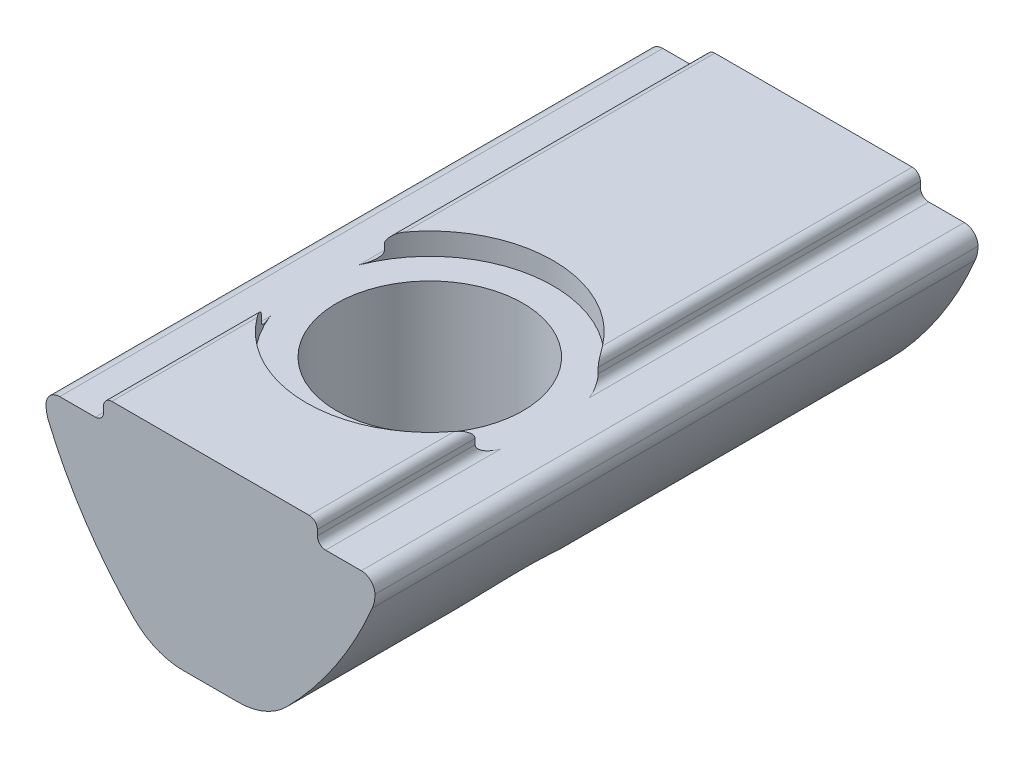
ISO-10303-21;
HEADER;
FILE_DESCRIPTION(('STEP AP214'),'2;1');
FILE_NAME('part.step','',(''),(''),'','','');
FILE_SCHEMA(('AUTOMOTIVE_DESIGN { 1 0 10303 214 1 1 1 1 }'));
ENDSEC;
DATA;
#1=APPLICATION_CONTEXT('core data for automotive mechanical design processes');
#2=APPLICATION_PROTOCOL_DEFINITION('international standard','automotive_design',2000,#1);
#3=PRODUCT_CONTEXT('',#1,'mechanical');
#4=PRODUCT('Part','Part','',(#3));
#5=PRODUCT_RELATED_PRODUCT_CATEGORY('part','',(#4));
#6=PRODUCT_DEFINITION_FORMATION('','',#4);
#7=PRODUCT_DEFINITION_CONTEXT('part definition',#1,'design');
#8=PRODUCT_DEFINITION('design','',#6,#7);
#9=PRODUCT_DEFINITION_SHAPE('','',#8);
#10=(LENGTH_UNIT() NAMED_UNIT(*) SI_UNIT(.MILLI.,.METRE.));
#11=(NAMED_UNIT(*) PLANE_ANGLE_UNIT() SI_UNIT($,.RADIAN.));
#12=(NAMED_UNIT(*) SI_UNIT($,.STERADIAN.) SOLID_ANGLE_UNIT());
#13=UNCERTAINTY_MEASURE_WITH_UNIT(LENGTH_MEASURE(1.E-05),#10,'distance_accuracy_value','');
#14=(GEOMETRIC_REPRESENTATION_CONTEXT(3) GLOBAL_UNCERTAINTY_ASSIGNED_CONTEXT((#13)) GLOBAL_UNIT_ASSIGNED_CONTEXT((#10,
#11,#12)) REPRESENTATION_CONTEXT('',''));
#15=CARTESIAN_POINT('',(0.,0.,0.));
#16=DIRECTION('',(0.,0.,1.));
#17=DIRECTION('',(1.,0.,0.));
#18=AXIS2_PLACEMENT_3D('',#15,#16,#17);
#19=CARTESIAN_POINT('',(0.,-0.8,14.));
#20=DIRECTION('',(0.,1.,0.));
#21=DIRECTION('',(-1.,0.,0.));
#22=AXIS2_PLACEMENT_3D('',#19,#20,#21);
#23=CYLINDRICAL_SURFACE('',#22,4.5);
#24=DIRECTION('',(0.,-1.,0.));
#25=VECTOR('',#24,1.);
#26=CARTESIAN_POINT('',(-3.9,-0.8,16.2449944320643));
#27=LINE('',#26,#25);
#28=CARTESIAN_POINT('',(-3.9,-0.3,16.2449944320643));
#29=VERTEX_POINT('',#28);
#30=CARTESIAN_POINT('',(-3.9,-0.5,16.2449944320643));
#31=VERTEX_POINT('',#30);
#32=EDGE_CURVE('E592',#29,#31,#27,.T.);
#33=ORIENTED_EDGE('',*,*,#32,.F.);
#34=CARTESIAN_POINT('',(-3.9,-0.3,16.2449944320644));
#35=CARTESIAN_POINT('',(-3.89998544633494,-0.297833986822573,16.2450197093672));
#36=CARTESIAN_POINT('',(-3.89994971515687,-0.295668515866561,16.2450817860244));
#37=CARTESIAN_POINT('',(-3.89983581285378,-0.291349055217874,16.2452796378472));
#38=CARTESIAN_POINT('',(-3.89975777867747,-0.289195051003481,16.2454151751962));
#39=CARTESIAN_POINT('',(-3.89955926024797,-0.284898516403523,16.245759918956));
#40=CARTESIAN_POINT('',(-3.89943884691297,-0.282755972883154,16.2459690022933));
#41=CARTESIAN_POINT('',(-3.89915561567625,-0.27848236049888,16.2464606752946));
#42=CARTESIAN_POINT('',(-3.89899280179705,-0.276351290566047,16.246743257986));
#43=CARTESIAN_POINT('',(-3.89862478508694,-0.272100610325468,16.2473817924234));
#44=CARTESIAN_POINT('',(-3.89841951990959,-0.269981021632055,16.2477378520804));
#45=CARTESIAN_POINT('',(-3.89796660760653,-0.265753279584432,16.2485231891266));
#46=CARTESIAN_POINT('',(-3.89771883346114,-0.263645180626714,16.2489526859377));
#47=CARTESIAN_POINT('',(-3.89718089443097,-0.25944038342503,16.2498847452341));
#48=CARTESIAN_POINT('',(-3.89689054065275,-0.257343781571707,16.2503876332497));
#49=CARTESIAN_POINT('',(-3.89626741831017,-0.253161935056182,16.2514663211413));
#50=CARTESIAN_POINT('',(-3.89593440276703,-0.251076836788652,16.2520425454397));
#51=CARTESIAN_POINT('',(-3.8952259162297,-0.246917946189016,16.2532677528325));
#52=CARTESIAN_POINT('',(-3.8948501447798,-0.244844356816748,16.2539172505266));
#53=CARTESIAN_POINT('',(-3.89405608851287,-0.240708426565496,16.2552888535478));
#54=CARTESIAN_POINT('',(-3.89363745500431,-0.238646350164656,16.2560115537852));
#55=CARTESIAN_POINT('',(-3.89275759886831,-0.234533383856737,16.2575294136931));
#56=CARTESIAN_POINT('',(-3.89229598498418,-0.232482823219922,16.258325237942));
#57=CARTESIAN_POINT('',(-3.89133007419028,-0.228392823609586,16.2599892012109));
#58=CARTESIAN_POINT('',(-3.89082534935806,-0.226353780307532,16.2608580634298));
#59=CARTESIAN_POINT('',(-3.88977310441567,-0.222286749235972,16.262667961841));
#60=CARTESIAN_POINT('',(-3.8892251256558,-0.220259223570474,16.2636097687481));
#61=CARTESIAN_POINT('',(-3.88808624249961,-0.216215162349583,16.2655654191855));
#62=CARTESIAN_POINT('',(-3.88749485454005,-0.214199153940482,16.2665800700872));
#63=CARTESIAN_POINT('',(-3.88626900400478,-0.210178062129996,16.2686812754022));
#64=CARTESIAN_POINT('',(-3.88563403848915,-0.208173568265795,16.2697686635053));
#65=CARTESIAN_POINT('',(-3.88432086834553,-0.204175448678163,16.2720152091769));
#66=CARTESIAN_POINT('',(-3.88364214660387,-0.202182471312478,16.2731752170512));
#67=CARTESIAN_POINT('',(-3.8822412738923,-0.198207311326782,16.2755668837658));
#68=CARTESIAN_POINT('',(-3.88151859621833,-0.196225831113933,16.276799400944));
#69=CARTESIAN_POINT('',(-3.88002963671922,-0.192273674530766,16.2793359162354));
#70=CARTESIAN_POINT('',(-3.87926282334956,-0.190303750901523,16.2806407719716));
#71=CARTESIAN_POINT('',(-3.87687540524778,-0.184357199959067,16.284698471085));
#72=CARTESIAN_POINT('',(-3.87520626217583,-0.180452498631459,16.2875287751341));
#73=CARTESIAN_POINT('',(-3.87169302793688,-0.172682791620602,16.2934701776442));
#74=CARTESIAN_POINT('',(-3.86984472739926,-0.16882473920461,16.2965878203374));
#75=CARTESIAN_POINT('',(-3.86597067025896,-0.161147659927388,16.3031034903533));
#76=CARTESIAN_POINT('',(-3.86394080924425,-0.157335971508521,16.3065077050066));
#77=CARTESIAN_POINT('',(-3.8602677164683,-0.150762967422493,16.3126484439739));
#78=CARTESIAN_POINT('',(-3.85864430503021,-0.147963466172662,16.3153562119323));
#79=CARTESIAN_POINT('',(-3.85531726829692,-0.142425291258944,16.3208919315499));
#80=CARTESIAN_POINT('',(-3.8536127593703,-0.139688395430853,16.3237211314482));
#81=CARTESIAN_POINT('',(-3.8501226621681,-0.134275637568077,16.3294993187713));
#82=CARTESIAN_POINT('',(-3.84833617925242,-0.131601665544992,16.3324495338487));
#83=CARTESIAN_POINT('',(-3.84468131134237,-0.126314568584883,16.3384692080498));
#84=CARTESIAN_POINT('',(-3.84281202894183,-0.123703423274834,16.3415398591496));
#85=CARTESIAN_POINT('',(-3.83899065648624,-0.118541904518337,16.347799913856));
#86=CARTESIAN_POINT('',(-3.8370376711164,-0.115993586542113,16.3509904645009));
#87=CARTESIAN_POINT('',(-3.83304803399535,-0.110957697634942,16.3574896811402));
#88=CARTESIAN_POINT('',(-3.83101049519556,-0.108472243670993,16.3607994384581));
#89=CARTESIAN_POINT('',(-3.82470845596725,-0.101033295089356,16.37100619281));
#90=CARTESIAN_POINT('',(-3.82037220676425,-0.0962555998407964,16.3779877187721));
#91=CARTESIAN_POINT('',(-3.81135704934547,-0.0869333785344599,16.392411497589));
#92=CARTESIAN_POINT('',(-3.80667138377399,-0.0824065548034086,16.3998608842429));
#93=CARTESIAN_POINT('',(-3.79694702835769,-0.073590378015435,16.415218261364));
#94=CARTESIAN_POINT('',(-3.79190177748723,-0.0693189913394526,16.4231323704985));
#95=CARTESIAN_POINT('',(-3.7822355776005,-0.0616168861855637,16.4381888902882));
#96=CARTESIAN_POINT('',(-3.77762928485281,-0.0581454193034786,16.4453200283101));
#97=CARTESIAN_POINT('',(-3.76831607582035,-0.0515011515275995,16.4596477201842));
#98=CARTESIAN_POINT('',(-3.76360922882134,-0.0483281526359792,16.4668442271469));
#99=CARTESIAN_POINT('',(-3.75409263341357,-0.0422853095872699,16.4813027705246));
#100=CARTESIAN_POINT('',(-3.74928282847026,-0.0394156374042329,16.4885648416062));
#101=CARTESIAN_POINT('',(-3.73955925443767,-0.0339777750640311,16.5031527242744));
#102=CARTESIAN_POINT('',(-3.73464531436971,-0.0314101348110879,16.510478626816));
#103=CARTESIAN_POINT('',(-3.72471205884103,-0.026576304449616,16.5251928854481));
#104=CARTESIAN_POINT('',(-3.71969247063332,-0.0243110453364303,16.5325813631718));
#105=CARTESIAN_POINT('',(-3.70954657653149,-0.0200815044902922,16.5474193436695));
#106=CARTESIAN_POINT('',(-3.70441991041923,-0.0181185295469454,16.5548689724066));
#107=CARTESIAN_POINT('',(-3.6940584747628,-0.014493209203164,16.5698278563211));
#108=CARTESIAN_POINT('',(-3.68882327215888,-0.0128325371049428,16.5773372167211));
#109=CARTESIAN_POINT('',(-3.67824336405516,-0.00981145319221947,16.592414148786));
#110=CARTESIAN_POINT('',(-3.67289816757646,-0.00845306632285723,16.5999817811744));
#111=CARTESIAN_POINT('',(-3.66209685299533,-0.00603621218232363,16.6151738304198));
#112=CARTESIAN_POINT('',(-3.65664020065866,-0.00498010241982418,16.6227982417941));
#113=CARTESIAN_POINT('',(-3.64561453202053,-0.00316746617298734,16.6381024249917));
#114=CARTESIAN_POINT('',(-3.64004495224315,-0.00241360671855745,16.6457821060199));
#115=CARTESIAN_POINT('',(-3.62879199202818,-0.00120521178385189,16.6611953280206));
#116=CARTESIAN_POINT('',(-3.62310803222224,-0.000753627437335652,16.668928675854));
#117=CARTESIAN_POINT('',(-3.61162477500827,-0.000149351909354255,16.6844479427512));
#118=CARTESIAN_POINT('',(-3.60582489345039,1.34157057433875E-07,16.6922335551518));
#119=CARTESIAN_POINT('',(-3.6,0.,16.7));
#120=B_SPLINE_CURVE_WITH_KNOTS('',3,(#34,#35,#36,#37,#38,#39,#40,#41,#42,#43,#44,#45,#46,#47,
#48,#49,#50,#51,#52,#53,#54,#55,#56,#57,#58,#59,#60,#61,#62,#63,#64,#65,#66,#67,#68,#69,#70,#71,
#72,#73,#74,#75,#76,#77,#78,#79,#80,#81,#82,#83,#84,#85,#86,#87,#88,#89,#90,#91,#92,#93,#94,#95,
#96,#97,#98,#99,#100,#101,#102,#103,#104,#105,#106,#107,#108,#109,#110,#111,#112,#113,#114,#115,
#116,#117,#118,#119),.UNSPECIFIED.,.F.,.F.,(4,2,2,2,2,2,2,2,2,2,2,2,2,2,2,2,2,2,2,2,2,2,2,2,2,2,
2,2,2,2,2,2,2,2,2,2,2,2,2,2,2,2,4),(0.,0.00649825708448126,0.0129756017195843,
0.0194421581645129,0.0259081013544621,0.0323836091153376,0.0388788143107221,0.0454037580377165,
0.0519683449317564,0.0585823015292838,0.0652551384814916,0.0719961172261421,0.0788142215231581,
0.0857181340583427,0.0927162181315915,0.0998165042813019,0.10702668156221,0.114354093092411,
0.121805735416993,0.13710644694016,0.152979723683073,0.169469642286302,0.182126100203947,
0.194992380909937,0.208082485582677,0.221409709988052,0.234986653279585,0.248825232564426,
0.277329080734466,0.307006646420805,0.337931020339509,0.365441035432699,0.392932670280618,
0.420439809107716,0.447996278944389,0.475635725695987,0.503391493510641,0.531296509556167,
0.559383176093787,0.587683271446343,0.616227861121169,0.645047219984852,0.674170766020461),.UNSPECIFIED.);
#121=CARTESIAN_POINT('',(-3.6,0.,16.7));
#122=VERTEX_POINT('',#121);
#123=EDGE_CURVE('E40',#29,#122,#120,.T.);
#124=ORIENTED_EDGE('',*,*,#123,.T.);
#125=CARTESIAN_POINT('',(0.,0.,14.));
#126=DIRECTION('',(0.,1.,0.));
#127=DIRECTION('',(-1.,0.,0.));
#128=AXIS2_PLACEMENT_3D('',#125,#126,#127);
#129=CIRCLE('',#128,4.5);
#130=CARTESIAN_POINT('',(3.6,0.,16.7));
#131=VERTEX_POINT('',#130);
#132=EDGE_CURVE('E451',#122,#131,#129,.T.);
#133=ORIENTED_EDGE('',*,*,#132,.T.);
#134=CARTESIAN_POINT('',(3.6,0.,16.7));
#135=CARTESIAN_POINT('',(3.60581638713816,1.34649989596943E-07,16.692244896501));
#136=CARTESIAN_POINT('',(3.61160783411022,-0.000149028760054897,16.6844706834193));
#137=CARTESIAN_POINT('',(3.62307488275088,-0.000751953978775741,16.6689736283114));
#138=CARTESIAN_POINT('',(3.62875106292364,-0.00120253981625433,16.6612510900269));
#139=CARTESIAN_POINT('',(3.63998910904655,-0.00240823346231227,16.6458588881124));
#140=CARTESIAN_POINT('',(3.64555154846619,-0.00316041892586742,16.638189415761));
#141=CARTESIAN_POINT('',(3.65656356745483,-0.00496900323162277,16.6229050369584));
#142=CARTESIAN_POINT('',(3.6620137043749,-0.00602276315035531,16.6152902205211));
#143=CARTESIAN_POINT('',(3.67280260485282,-0.00843421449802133,16.6001167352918));
#144=CARTESIAN_POINT('',(3.67814189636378,-0.00978957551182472,16.5925580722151));
#145=CARTESIAN_POINT('',(3.68871059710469,-0.0128039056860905,16.5774984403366));
#146=CARTESIAN_POINT('',(3.69394049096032,-0.0144608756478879,16.5699974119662));
#147=CARTESIAN_POINT('',(3.70429189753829,-0.0180780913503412,16.5550545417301));
#148=CARTESIAN_POINT('',(3.70941383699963,-0.0200366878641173,16.547612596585));
#149=CARTESIAN_POINT('',(3.71955085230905,-0.0242567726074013,16.5327893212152));
#150=CARTESIAN_POINT('',(3.72456628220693,-0.0265169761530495,16.5254078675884));
#151=CARTESIAN_POINT('',(3.73449178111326,-0.0313400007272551,16.5107069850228));
#152=CARTESIAN_POINT('',(3.73940211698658,-0.0339019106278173,16.5033874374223));
#153=CARTESIAN_POINT('',(3.74911903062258,-0.0393276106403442,16.4888115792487));
#154=CARTESIAN_POINT('',(3.75392577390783,-0.0421908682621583,16.4815551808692));
#155=CARTESIAN_POINT('',(3.76343677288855,-0.0482202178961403,16.4671072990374));
#156=CARTESIAN_POINT('',(3.76814108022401,-0.0513861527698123,16.4599157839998));
#157=CARTESIAN_POINT('',(3.77744974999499,-0.0580155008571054,16.4455973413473));
#158=CARTESIAN_POINT('',(3.78205403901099,-0.0614791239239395,16.4384704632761));
#159=CARTESIAN_POINT('',(3.79172646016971,-0.0691722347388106,16.4234067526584));
#160=CARTESIAN_POINT('',(3.79677969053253,-0.0734431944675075,16.4154813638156));
#161=CARTESIAN_POINT('',(3.80652024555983,-0.0822608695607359,16.4001006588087));
#162=CARTESIAN_POINT('',(3.81121411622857,-0.0867896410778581,16.3926392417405));
#163=CARTESIAN_POINT('',(3.82024596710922,-0.0961179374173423,16.3781905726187));
#164=CARTESIAN_POINT('',(3.8245906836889,-0.100899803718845,16.3711962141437));
#165=CARTESIAN_POINT('',(3.83090537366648,-0.108346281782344,16.3609700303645));
#166=CARTESIAN_POINT('',(3.83294724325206,-0.110834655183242,16.3576535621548));
#167=CARTESIAN_POINT('',(3.83694561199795,-0.115876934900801,16.351140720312));
#168=CARTESIAN_POINT('',(3.83890299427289,-0.118428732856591,16.3479432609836));
#169=CARTESIAN_POINT('',(3.84273323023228,-0.123597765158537,16.3416691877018));
#170=CARTESIAN_POINT('',(3.84460697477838,-0.126212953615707,16.3385914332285));
#171=CARTESIAN_POINT('',(3.8482708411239,-0.131508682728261,16.3325573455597));
#172=CARTESIAN_POINT('',(3.85006185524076,-0.134187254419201,16.3295998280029));
#173=CARTESIAN_POINT('',(3.85356107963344,-0.139609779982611,16.3238068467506));
#174=CARTESIAN_POINT('',(3.85527017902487,-0.142351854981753,16.3209701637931));
#175=CARTESIAN_POINT('',(3.85860650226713,-0.147900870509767,16.3154192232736));
#176=CARTESIAN_POINT('',(3.86023460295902,-0.15070604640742,16.3127037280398));
#177=CARTESIAN_POINT('',(3.86391374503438,-0.157284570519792,16.3065530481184));
#178=CARTESIAN_POINT('',(3.86594510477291,-0.161095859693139,16.3031464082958));
#179=CARTESIAN_POINT('',(3.86982198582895,-0.168772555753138,16.2966261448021));
#180=CARTESIAN_POINT('',(3.87167161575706,-0.172630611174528,16.2935063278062));
#181=CARTESIAN_POINT('',(3.87518739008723,-0.180400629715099,16.2875607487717));
#182=CARTESIAN_POINT('',(3.87685774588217,-0.184305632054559,16.2847284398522));
#183=CARTESIAN_POINT('',(3.87924688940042,-0.190252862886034,16.2806678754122));
#184=CARTESIAN_POINT('',(3.88001425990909,-0.192223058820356,16.2793620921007));
#185=CARTESIAN_POINT('',(3.88150430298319,-0.196175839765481,16.2768237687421));
#186=CARTESIAN_POINT('',(3.88222750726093,-0.198157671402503,16.2755903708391));
#187=CARTESIAN_POINT('',(3.88362940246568,-0.202133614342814,16.2731969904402));
#188=CARTESIAN_POINT('',(3.88430862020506,-0.204127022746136,16.272036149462));
#189=CARTESIAN_POINT('',(3.88562275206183,-0.208126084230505,16.2697879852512));
#190=CARTESIAN_POINT('',(3.8862581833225,-0.210131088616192,16.2686998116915));
#191=CARTESIAN_POINT('',(3.88748493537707,-0.214153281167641,16.2665970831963));
#192=CARTESIAN_POINT('',(3.88807675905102,-0.216169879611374,16.2655816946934));
#193=CARTESIAN_POINT('',(3.8892164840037,-0.220215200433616,16.2636246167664));
#194=CARTESIAN_POINT('',(3.88976486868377,-0.222243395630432,16.2626821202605));
#195=CARTESIAN_POINT('',(3.89081789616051,-0.226311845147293,16.2608708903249));
#196=CARTESIAN_POINT('',(3.8913229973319,-0.228351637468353,16.2600013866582));
#197=CARTESIAN_POINT('',(3.89228963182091,-0.232443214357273,16.2583361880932));
#198=CARTESIAN_POINT('',(3.89275159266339,-0.234494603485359,16.2575397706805));
#199=CARTESIAN_POINT('',(3.89363211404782,-0.238609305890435,16.2560207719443));
#200=CARTESIAN_POINT('',(3.89405106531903,-0.240672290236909,16.255297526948));
#201=CARTESIAN_POINT('',(3.89484572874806,-0.244810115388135,16.2539248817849));
#202=CARTESIAN_POINT('',(3.89522178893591,-0.246884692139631,16.2532748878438));
#203=CARTESIAN_POINT('',(3.89593082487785,-0.251045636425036,16.2520487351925));
#204=CARTESIAN_POINT('',(3.89626410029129,-0.253131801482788,16.2514720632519));
#205=CARTESIAN_POINT('',(3.89688771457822,-0.257315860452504,16.2503925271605));
#206=CARTESIAN_POINT('',(3.89717829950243,-0.259413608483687,16.2498892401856));
#207=CARTESIAN_POINT('',(3.89771667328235,-0.263620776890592,16.2489564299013));
#208=CARTESIAN_POINT('',(3.89796464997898,-0.265730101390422,16.2485265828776));
#209=CARTESIAN_POINT('',(3.89841794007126,-0.269960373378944,16.247740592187));
#210=CARTESIAN_POINT('',(3.89862337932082,-0.27208126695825,16.2473842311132));
#211=CARTESIAN_POINT('',(3.89899171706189,-0.276334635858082,16.2467451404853));
#212=CARTESIAN_POINT('',(3.89915467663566,-0.278467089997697,16.2464623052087));
#213=CARTESIAN_POINT('',(3.89943817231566,-0.282743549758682,16.2459701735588));
#214=CARTESIAN_POINT('',(3.89955870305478,-0.284887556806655,16.245760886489));
#215=CARTESIAN_POINT('',(3.89975742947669,-0.28918709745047,16.245415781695));
#216=CARTESIAN_POINT('',(3.89983555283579,-0.291342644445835,16.2452800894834));
#217=CARTESIAN_POINT('',(3.89994960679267,-0.295665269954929,16.2450819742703));
#218=CARTESIAN_POINT('',(3.89998539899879,-0.297832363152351,16.2450197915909));
#219=CARTESIAN_POINT('',(3.9,-0.3,16.2449944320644));
#220=B_SPLINE_CURVE_WITH_KNOTS('',3,(#134,#135,#136,#137,#138,#139,#140,#141,#142,#143,#144,
#145,#146,#147,#148,#149,#150,#151,#152,#153,#154,#155,#156,#157,#158,#159,#160,#161,#162,#163,
#164,#165,#166,#167,#168,#169,#170,#171,#172,#173,#174,#175,#176,#177,#178,#179,#180,#181,#182,
#183,#184,#185,#186,#187,#188,#189,#190,#191,#192,#193,#194,#195,#196,#197,#198,#199,#200,#201,
#202,#203,#204,#205,#206,#207,#208,#209,#210,#211,#212,#213,#214,#215,#216,#217,#218,#219),
.UNSPECIFIED.,.F.,.F.,(4,2,2,2,2,2,2,2,2,2,2,2,2,2,2,2,2,2,2,2,2,2,2,2,2,2,2,2,2,2,2,2,2,2,2,2,
2,2,2,2,2,2,4),(0.,0.0290810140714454,0.0578603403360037,0.0863672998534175,0.114632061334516,
0.142685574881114,0.170559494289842,0.198286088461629,0.225898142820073,0.253428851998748,
0.280911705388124,0.308380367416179,0.335868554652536,0.366830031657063,0.396549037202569,
0.425098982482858,0.438962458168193,0.452565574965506,0.465920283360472,0.479039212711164,
0.49193568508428,0.504623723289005,0.5211189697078,0.536997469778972,0.552303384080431,
0.559757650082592,0.567087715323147,0.57430058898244,0.581403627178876,0.588404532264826,
0.595311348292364,0.602132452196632,0.608876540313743,0.615552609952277,0.622169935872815,
0.628738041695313,0.635266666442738,0.641765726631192,0.648245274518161,0.654715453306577,
0.661186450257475,0.66766844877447,0.674171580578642),.UNSPECIFIED.);
#221=CARTESIAN_POINT('',(3.9,-0.3,16.2449944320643));
#222=VERTEX_POINT('',#221);
#223=EDGE_CURVE('E26',#131,#222,#220,.T.);
#224=ORIENTED_EDGE('',*,*,#223,.T.);
#225=DIRECTION('',(0.,1.,0.));
#226=VECTOR('',#225,1.);
#227=CARTESIAN_POINT('',(3.9,-0.8,16.2449944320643));
#228=LINE('',#227,#226);
#229=CARTESIAN_POINT('',(3.9,-0.5,16.2449944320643));
#230=VERTEX_POINT('',#229);
#231=EDGE_CURVE('E474',#230,#222,#228,.T.);
#232=ORIENTED_EDGE('',*,*,#231,.F.);
#233=CARTESIAN_POINT('',(4.2,-0.8,15.6155494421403));
#234=CARTESIAN_POINT('',(4.1930722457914,-0.799998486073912,15.6335596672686));
#235=CARTESIAN_POINT('',(4.18603012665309,-0.799759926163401,15.6515276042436));
#236=CARTESIAN_POINT('',(4.17203476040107,-0.798772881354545,15.6865834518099));
#237=CARTESIAN_POINT('',(4.16509088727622,-0.798046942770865,15.7036757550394));
#238=CARTESIAN_POINT('',(4.15132492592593,-0.796102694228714,15.7369808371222));
#239=CARTESIAN_POINT('',(4.1445114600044,-0.794908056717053,15.7531985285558));
#240=CARTESIAN_POINT('',(4.13103741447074,-0.792043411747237,15.784753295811));
#241=CARTESIAN_POINT('',(4.12438467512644,-0.790398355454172,15.8000959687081));
#242=CARTESIAN_POINT('',(4.11002117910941,-0.786298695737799,15.8327170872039));
#243=CARTESIAN_POINT('',(4.10228913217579,-0.783764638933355,15.8499763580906));
#244=CARTESIAN_POINT('',(4.08712858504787,-0.77806751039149,15.8832227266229));
#245=CARTESIAN_POINT('',(4.07971066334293,-0.774952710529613,15.8992227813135));
#246=CARTESIAN_POINT('',(4.06797842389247,-0.76942957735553,15.9241141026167));
#247=CARTESIAN_POINT('',(4.06370875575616,-0.767297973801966,15.9330882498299));
#248=CARTESIAN_POINT('',(4.05528030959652,-0.762827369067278,15.9506526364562));
#249=CARTESIAN_POINT('',(4.05112256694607,-0.760497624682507,15.9592457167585));
#250=CARTESIAN_POINT('',(4.0429262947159,-0.755636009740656,15.9760469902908));
#251=CARTESIAN_POINT('',(4.03888852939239,-0.753113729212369,15.9842583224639));
#252=CARTESIAN_POINT('',(4.03094161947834,-0.7478731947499,16.0002958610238));
#253=CARTESIAN_POINT('',(4.02703290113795,-0.74516484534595,16.0081255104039));
#254=CARTESIAN_POINT('',(4.01843158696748,-0.738886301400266,16.0252312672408));
#255=CARTESIAN_POINT('',(4.01373843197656,-0.735252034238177,16.0344837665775));
#256=CARTESIAN_POINT('',(4.00458294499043,-0.727696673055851,16.0523844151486));
#257=CARTESIAN_POINT('',(4.00011985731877,-0.723796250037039,16.0610408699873));
#258=CARTESIAN_POINT('',(3.99144006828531,-0.71572256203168,16.0777486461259));
#259=CARTESIAN_POINT('',(3.98722161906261,-0.711570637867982,16.0858093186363));
#260=CARTESIAN_POINT('',(3.97904602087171,-0.703009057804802,16.1013241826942));
#261=CARTESIAN_POINT('',(3.97508604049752,-0.698621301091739,16.1087889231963));
#262=CARTESIAN_POINT('',(3.96744080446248,-0.689603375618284,16.123111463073));
#263=CARTESIAN_POINT('',(3.96375158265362,-0.684995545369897,16.1299810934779));
#264=CARTESIAN_POINT('',(3.95836718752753,-0.677825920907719,16.1399520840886));
#265=CARTESIAN_POINT('',(3.95663023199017,-0.675442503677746,16.1431598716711));
#266=CARTESIAN_POINT('',(3.95322919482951,-0.670624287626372,16.1494246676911));
#267=CARTESIAN_POINT('',(3.95156438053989,-0.668192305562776,16.1524834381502));
#268=CARTESIAN_POINT('',(3.94830904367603,-0.663279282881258,16.1584500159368));
#269=CARTESIAN_POINT('',(3.94671770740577,-0.660801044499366,16.1613596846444));
#270=CARTESIAN_POINT('',(3.94361062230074,-0.655797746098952,16.1670279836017));
#271=CARTESIAN_POINT('',(3.94209397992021,-0.653275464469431,16.169788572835));
#272=CARTESIAN_POINT('',(3.93913752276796,-0.648186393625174,16.1751586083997));
#273=CARTESIAN_POINT('',(3.93769673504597,-0.645622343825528,16.1777701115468));
#274=CARTESIAN_POINT('',(3.93489315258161,-0.640452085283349,16.1828418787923));
#275=CARTESIAN_POINT('',(3.93352930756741,-0.637848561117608,16.1853042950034));
#276=CARTESIAN_POINT('',(3.93088070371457,-0.632601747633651,16.1900777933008));
#277=CARTESIAN_POINT('',(3.92959482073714,-0.629961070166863,16.1923911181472));
#278=CARTESIAN_POINT('',(3.92710315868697,-0.624642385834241,16.1968663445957));
#279=CARTESIAN_POINT('',(3.92589618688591,-0.621966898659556,16.1990305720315));
#280=CARTESIAN_POINT('',(3.92356328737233,-0.616581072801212,16.2032075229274));
#281=CARTESIAN_POINT('',(3.92243610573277,-0.613873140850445,16.2052226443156));
#282=CARTESIAN_POINT('',(3.92026364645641,-0.608424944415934,16.2091013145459));
#283=CARTESIAN_POINT('',(3.91921706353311,-0.605686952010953,16.2109673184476));
#284=CARTESIAN_POINT('',(3.91720657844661,-0.60018119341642,16.2145477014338));
#285=CARTESIAN_POINT('',(3.91624133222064,-0.597415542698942,16.2162645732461));
#286=CARTESIAN_POINT('',(3.91439421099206,-0.591857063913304,16.2195466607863));
#287=CARTESIAN_POINT('',(3.9135109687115,-0.58906617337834,16.221114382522));
#288=CARTESIAN_POINT('',(3.91182845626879,-0.583459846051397,16.2240981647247));
#289=CARTESIAN_POINT('',(3.91102781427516,-0.580646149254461,16.2255167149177));
#290=CARTESIAN_POINT('',(3.90951101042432,-0.574996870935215,16.228202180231));
#291=CARTESIAN_POINT('',(3.90879349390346,-0.572162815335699,16.2294715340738));
#292=CARTESIAN_POINT('',(3.90744335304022,-0.566475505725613,16.2318586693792));
#293=CARTESIAN_POINT('',(3.90680941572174,-0.563623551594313,16.2329787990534));
#294=CARTESIAN_POINT('',(3.90562674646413,-0.557903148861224,16.2350675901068));
#295=CARTESIAN_POINT('',(3.90507677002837,-0.555035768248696,16.2360384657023));
#296=CARTESIAN_POINT('',(3.90406223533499,-0.549287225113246,16.2378288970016));
#297=CARTESIAN_POINT('',(3.90359652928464,-0.546406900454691,16.2386504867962));
#298=CARTESIAN_POINT('',(3.90275064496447,-0.540635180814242,16.2401425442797));
#299=CARTESIAN_POINT('',(3.90236944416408,-0.537744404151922,16.2408148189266));
#300=CARTESIAN_POINT('',(3.90169258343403,-0.531954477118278,16.2420084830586));
#301=CARTESIAN_POINT('',(3.90139605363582,-0.529055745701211,16.2425314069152));
#302=CARTESIAN_POINT('',(3.90088842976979,-0.523252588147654,16.2434266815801));
#303=CARTESIAN_POINT('',(3.90067664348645,-0.520348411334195,16.2438002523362));
#304=CARTESIAN_POINT('',(3.90033837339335,-0.514536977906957,16.2443970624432));
#305=CARTESIAN_POINT('',(3.90021139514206,-0.511629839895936,16.2446211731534));
#306=CARTESIAN_POINT('',(3.90004226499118,-0.505815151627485,16.2449197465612));
#307=CARTESIAN_POINT('',(3.89999983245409,-0.502907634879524,16.2449947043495));
#308=CARTESIAN_POINT('',(3.9,-0.499999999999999,16.2449944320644));
#309=B_SPLINE_CURVE_WITH_KNOTS('',3,(#233,#234,#235,#236,#237,#238,#239,#240,#241,#242,#243,
#244,#245,#246,#247,#248,#249,#250,#251,#252,#253,#254,#255,#256,#257,#258,#259,#260,#261,#262,
#263,#264,#265,#266,#267,#268,#269,#270,#271,#272,#273,#274,#275,#276,#277,#278,#279,#280,#281,
#282,#283,#284,#285,#286,#287,#288,#289,#290,#291,#292,#293,#294,#295,#296,#297,#298,#299,#300,
#301,#302,#303,#304,#305,#306,#307,#308),.UNSPECIFIED.,.F.,.F.,(4,2,2,2,2,2,2,2,2,2,2,2,2,2,2,2,
2,2,2,2,2,2,2,2,2,2,2,2,2,2,2,2,2,2,2,2,2,4),(0.,0.0578905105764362,0.11327225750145,
0.166157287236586,0.216559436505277,0.273786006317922,0.327492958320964,0.357981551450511,
0.387456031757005,0.415926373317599,0.443403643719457,0.476371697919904,0.507834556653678,
0.537823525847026,0.566374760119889,0.593530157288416,0.60660083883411,0.619341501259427,
0.631759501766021,0.643862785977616,0.655659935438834,0.667160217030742,0.678373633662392,
0.68931097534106,0.699983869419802,0.710404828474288,0.720587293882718,0.730545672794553,
0.740295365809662,0.74985278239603,0.759235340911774,0.768461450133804,0.777550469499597,
0.786522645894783,0.795399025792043,0.804201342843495,0.812951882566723,0.821673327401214),.UNSPECIFIED.);
#310=CARTESIAN_POINT('',(4.2,-0.8,15.6155494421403));
#311=VERTEX_POINT('',#310);
#312=EDGE_CURVE('E521',#311,#230,#309,.T.);
#313=ORIENTED_EDGE('',*,*,#312,.F.);
#314=CARTESIAN_POINT('',(0.,-0.8,14.));
#315=DIRECTION('',(0.,1.,0.));
#316=DIRECTION('',(-1.,0.,0.));
#317=AXIS2_PLACEMENT_3D('',#314,#315,#316);
#318=CIRCLE('',#317,4.5);
#319=CARTESIAN_POINT('',(-4.2,-0.8,15.6155494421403));
#320=VERTEX_POINT('',#319);
#321=EDGE_CURVE('E113',#320,#311,#318,.T.);
#322=ORIENTED_EDGE('',*,*,#321,.F.);
#323=CARTESIAN_POINT('',(-3.9,-0.499999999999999,16.2449944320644));
#324=CARTESIAN_POINT('',(-3.89999982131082,-0.502956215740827,16.2449947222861));
#325=CARTESIAN_POINT('',(-3.90004368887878,-0.505912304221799,16.2449172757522));
#326=CARTESIAN_POINT('',(-3.90021851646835,-0.511824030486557,16.2446088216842));
#327=CARTESIAN_POINT('',(-3.90034977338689,-0.514779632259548,16.244377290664));
#328=CARTESIAN_POINT('',(-3.90069942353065,-0.520687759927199,16.2437607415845));
#329=CARTESIAN_POINT('',(-3.90091834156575,-0.523640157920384,16.2433747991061));
#330=CARTESIAN_POINT('',(-3.90144302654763,-0.529539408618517,16.2424499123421));
#331=CARTESIAN_POINT('',(-3.9017495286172,-0.532485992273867,16.2419096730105));
#332=CARTESIAN_POINT('',(-3.90244910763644,-0.538371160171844,16.2406765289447));
#333=CARTESIAN_POINT('',(-3.90284310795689,-0.54130929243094,16.2399819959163));
#334=CARTESIAN_POINT('',(-3.9037173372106,-0.54717514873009,16.2384405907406));
#335=CARTESIAN_POINT('',(-3.90419865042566,-0.550102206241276,16.2375918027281));
#336=CARTESIAN_POINT('',(-3.90524711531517,-0.555943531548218,16.2357421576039));
#337=CARTESIAN_POINT('',(-3.90581548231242,-0.558856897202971,16.234739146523));
#338=CARTESIAN_POINT('',(-3.90703761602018,-0.564668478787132,16.232581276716));
#339=CARTESIAN_POINT('',(-3.90769269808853,-0.567565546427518,16.2314240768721));
#340=CARTESIAN_POINT('',(-3.90908777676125,-0.57334218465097,16.2289579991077));
#341=CARTESIAN_POINT('',(-3.90982915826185,-0.57622035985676,16.2276466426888));
#342=CARTESIAN_POINT('',(-3.91139630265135,-0.581956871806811,16.2248723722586));
#343=CARTESIAN_POINT('',(-3.9122234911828,-0.584813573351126,16.2234068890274));
#344=CARTESIAN_POINT('',(-3.91396166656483,-0.590504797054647,16.2203244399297));
#345=CARTESIAN_POINT('',(-3.91487409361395,-0.593337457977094,16.2187048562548));
#346=CARTESIAN_POINT('',(-3.91678211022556,-0.598978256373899,16.2153142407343));
#347=CARTESIAN_POINT('',(-3.91777913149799,-0.601784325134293,16.2135405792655));
#348=CARTESIAN_POINT('',(-3.91985564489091,-0.607369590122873,16.209841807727));
#349=CARTESIAN_POINT('',(-3.9209365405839,-0.610146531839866,16.2079140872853));
#350=CARTESIAN_POINT('',(-3.92318005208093,-0.61567118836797,16.2039071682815));
#351=CARTESIAN_POINT('',(-3.92434402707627,-0.618416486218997,16.2018254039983));
#352=CARTESIAN_POINT('',(-3.9267528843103,-0.623875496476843,16.1975103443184));
#353=CARTESIAN_POINT('',(-3.92799906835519,-0.62658665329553,16.1952745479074));
#354=CARTESIAN_POINT('',(-3.93057146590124,-0.631975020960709,16.1906513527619));
#355=CARTESIAN_POINT('',(-3.93189891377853,-0.634649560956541,16.1882615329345));
#356=CARTESIAN_POINT('',(-3.9346328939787,-0.639962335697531,16.1833302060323));
#357=CARTESIAN_POINT('',(-3.93604058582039,-0.642597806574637,16.1807863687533));
#358=CARTESIAN_POINT('',(-3.93893403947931,-0.647830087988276,16.1755469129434));
#359=CARTESIAN_POINT('',(-3.94042088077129,-0.650424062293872,16.1728490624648));
#360=CARTESIAN_POINT('',(-3.94347154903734,-0.655571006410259,16.167301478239));
#361=CARTESIAN_POINT('',(-3.94503637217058,-0.658121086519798,16.1644496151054));
#362=CARTESIAN_POINT('',(-3.94824184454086,-0.663177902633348,16.1585939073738));
#363=CARTESIAN_POINT('',(-3.94988340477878,-0.665681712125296,16.1555880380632));
#364=CARTESIAN_POINT('',(-3.95324113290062,-0.670643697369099,16.1494241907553));
#365=CARTESIAN_POINT('',(-3.95495812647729,-0.673098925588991,16.1462642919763));
#366=CARTESIAN_POINT('',(-3.95846537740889,-0.677961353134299,16.1397923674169));
#367=CARTESIAN_POINT('',(-3.96025637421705,-0.680365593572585,16.1364785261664));
#368=CARTESIAN_POINT('',(-3.96580861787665,-0.687596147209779,16.1261760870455));
#369=CARTESIAN_POINT('',(-3.96961124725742,-0.692237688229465,16.1190793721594));
#370=CARTESIAN_POINT('',(-3.97748956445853,-0.701313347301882,16.1042833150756));
#371=CARTESIAN_POINT('',(-3.9815691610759,-0.705724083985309,16.0965718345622));
#372=CARTESIAN_POINT('',(-3.989989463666,-0.714321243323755,16.0805440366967));
#373=CARTESIAN_POINT('',(-3.99433288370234,-0.718484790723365,16.0722169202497));
#374=CARTESIAN_POINT('',(-4.00326719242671,-0.726570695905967,16.0549567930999));
#375=CARTESIAN_POINT('',(-4.00785965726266,-0.730470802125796,16.046014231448));
#376=CARTESIAN_POINT('',(-4.01727759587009,-0.73801399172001,16.0275217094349));
#377=CARTESIAN_POINT('',(-4.02210360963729,-0.741635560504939,16.0179632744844));
#378=CARTESIAN_POINT('',(-4.02978153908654,-0.747058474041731,16.0026179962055));
#379=CARTESIAN_POINT('',(-4.0326364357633,-0.749000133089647,15.9968816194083));
#380=CARTESIAN_POINT('',(-4.03841402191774,-0.752788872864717,15.9852089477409));
#381=CARTESIAN_POINT('',(-4.0413365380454,-0.754632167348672,15.9792713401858));
#382=CARTESIAN_POINT('',(-4.05031391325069,-0.7600853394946,15.9609286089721));
#383=CARTESIAN_POINT('',(-4.05635261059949,-0.763459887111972,15.9484447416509));
#384=CARTESIAN_POINT('',(-4.06495946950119,-0.767904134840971,15.9304262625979));
#385=CARTESIAN_POINT('',(-4.06755678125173,-0.769197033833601,15.9249590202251));
#386=CARTESIAN_POINT('',(-4.07279743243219,-0.771713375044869,15.9138641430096));
#387=CARTESIAN_POINT('',(-4.07544039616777,-0.772934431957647,15.9082357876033));
#388=CARTESIAN_POINT('',(-4.08446140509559,-0.776947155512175,15.8889143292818));
#389=CARTESIAN_POINT('',(-4.09079814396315,-0.779498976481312,15.8751515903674));
#390=CARTESIAN_POINT('',(-4.10369162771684,-0.784208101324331,15.8467587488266));
#391=CARTESIAN_POINT('',(-4.1102422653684,-0.786337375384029,15.8321212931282));
#392=CARTESIAN_POINT('',(-4.12353736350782,-0.79017880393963,15.8019774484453));
#393=CARTESIAN_POINT('',(-4.13027482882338,-0.791864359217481,15.7864646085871));
#394=CARTESIAN_POINT('',(-4.14391474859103,-0.794797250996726,15.7545692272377));
#395=CARTESIAN_POINT('',(-4.15080933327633,-0.79601934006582,15.7381810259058));
#396=CARTESIAN_POINT('',(-4.16473255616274,-0.798006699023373,15.704534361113));
#397=CARTESIAN_POINT('',(-4.17175248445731,-0.798748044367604,15.6872709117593));
#398=CARTESIAN_POINT('',(-4.18589385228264,-0.799755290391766,15.6518722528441));
#399=CARTESIAN_POINT('',(-4.19300579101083,-0.799998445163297,15.633732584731));
#400=CARTESIAN_POINT('',(-4.2,-0.8,15.6155494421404));
#401=B_SPLINE_CURVE_WITH_KNOTS('',3,(#323,#324,#325,#326,#327,#328,#329,#330,#331,#332,#333,
#334,#335,#336,#337,#338,#339,#340,#341,#342,#343,#344,#345,#346,#347,#348,#349,#350,#351,#352,
#353,#354,#355,#356,#357,#358,#359,#360,#361,#362,#363,#364,#365,#366,#367,#368,#369,#370,#371,
#372,#373,#374,#375,#376,#377,#378,#379,#380,#381,#382,#383,#384,#385,#386,#387,#388,#389,#390,
#391,#392,#393,#394,#395,#396,#397,#398,#399,#400),.UNSPECIFIED.,.F.,.F.,(4,2,2,2,2,2,2,2,2,2,2,
2,2,2,2,2,2,2,2,2,2,2,2,2,2,2,2,2,2,2,2,2,2,2,2,2,2,2,4),(0.,0.00886710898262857,
0.0177644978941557,0.0267159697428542,0.0357448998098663,0.0448740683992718,0.054125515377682,
0.0635204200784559,0.0730790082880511,0.0828204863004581,0.0927630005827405,0.102923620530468,
0.113318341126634,0.123962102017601,0.134868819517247,0.146051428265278,0.157521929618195,
0.169291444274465,0.181370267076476,0.193767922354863,0.206493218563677,0.219554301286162,
0.232958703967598,0.260821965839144,0.290135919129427,0.320943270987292,0.353280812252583,
0.387180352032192,0.407264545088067,0.427872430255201,0.470673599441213,0.489241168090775,
0.508250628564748,0.554333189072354,0.602854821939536,0.653834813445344,0.707289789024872,
0.763234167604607,0.821680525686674),.UNSPECIFIED.);
#402=EDGE_CURVE('E728',#31,#320,#401,.T.);
#403=ORIENTED_EDGE('',*,*,#402,.F.);
#404=EDGE_LOOP('',(#33,#124,#133,#224,#232,#313,#322,#403));
#405=FACE_BOUND('',#404,.T.);
#406=ADVANCED_FACE('F15',(#405),#23,.F.);
#407=CARTESIAN_POINT('',(0.,-0.8,14.));
#408=DIRECTION('',(0.,1.,0.));
#409=DIRECTION('',(-1.,0.,0.));
#410=AXIS2_PLACEMENT_3D('',#407,#408,#409);
#411=CYLINDRICAL_SURFACE('',#410,4.5);
#412=CARTESIAN_POINT('',(0.,-0.8,14.));
#413=DIRECTION('',(0.,1.,0.));
#414=DIRECTION('',(-1.,0.,0.));
#415=AXIS2_PLACEMENT_3D('',#412,#413,#414);
#416=CIRCLE('',#415,4.5);
#417=CARTESIAN_POINT('',(4.2,-0.8,12.3844505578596));
#418=VERTEX_POINT('',#417);
#419=CARTESIAN_POINT('',(-4.2,-0.8,12.3844505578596));
#420=VERTEX_POINT('',#419);
#421=EDGE_CURVE('E658',#418,#420,#416,.T.);
#422=ORIENTED_EDGE('',*,*,#421,.F.);
#423=CARTESIAN_POINT('',(3.9,-0.499999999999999,11.7550055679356));
#424=CARTESIAN_POINT('',(3.89999982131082,-0.502956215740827,11.7550052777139));
#425=CARTESIAN_POINT('',(3.90004368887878,-0.5059123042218,11.7550827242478));
#426=CARTESIAN_POINT('',(3.90021851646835,-0.511824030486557,11.7553911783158));
#427=CARTESIAN_POINT('',(3.90034977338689,-0.514779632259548,11.755622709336));
#428=CARTESIAN_POINT('',(3.90069942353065,-0.520687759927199,11.7562392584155));
#429=CARTESIAN_POINT('',(3.90091834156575,-0.523640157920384,11.7566252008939));
#430=CARTESIAN_POINT('',(3.90144302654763,-0.529539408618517,11.7575500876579));
#431=CARTESIAN_POINT('',(3.9017495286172,-0.532485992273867,11.7580903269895));
#432=CARTESIAN_POINT('',(3.90244910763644,-0.538371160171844,11.7593234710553));
#433=CARTESIAN_POINT('',(3.90284310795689,-0.54130929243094,11.7600180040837));
#434=CARTESIAN_POINT('',(3.9037173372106,-0.54717514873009,11.7615594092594));
#435=CARTESIAN_POINT('',(3.90419865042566,-0.550102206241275,11.7624081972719));
#436=CARTESIAN_POINT('',(3.90524711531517,-0.555943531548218,11.7642578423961));
#437=CARTESIAN_POINT('',(3.90581548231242,-0.55885689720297,11.765260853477));
#438=CARTESIAN_POINT('',(3.90703761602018,-0.564668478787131,11.767418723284));
#439=CARTESIAN_POINT('',(3.90769269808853,-0.567565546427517,11.7685759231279));
#440=CARTESIAN_POINT('',(3.90908777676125,-0.573342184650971,11.7710420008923));
#441=CARTESIAN_POINT('',(3.90982915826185,-0.57622035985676,11.7723533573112));
#442=CARTESIAN_POINT('',(3.91139630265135,-0.58195687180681,11.7751276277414));
#443=CARTESIAN_POINT('',(3.9122234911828,-0.584813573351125,11.7765931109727));
#444=CARTESIAN_POINT('',(3.91396166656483,-0.590504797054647,11.7796755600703));
#445=CARTESIAN_POINT('',(3.91487409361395,-0.593337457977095,11.7812951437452));
#446=CARTESIAN_POINT('',(3.91678211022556,-0.5989782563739,11.7846857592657));
#447=CARTESIAN_POINT('',(3.91777913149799,-0.601784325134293,11.7864594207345));
#448=CARTESIAN_POINT('',(3.91985564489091,-0.607369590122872,11.790158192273));
#449=CARTESIAN_POINT('',(3.9209365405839,-0.610146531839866,11.7920859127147));
#450=CARTESIAN_POINT('',(3.92318005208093,-0.615671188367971,11.7960928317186));
#451=CARTESIAN_POINT('',(3.92434402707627,-0.618416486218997,11.7981745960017));
#452=CARTESIAN_POINT('',(3.9267528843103,-0.623875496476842,11.8024896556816));
#453=CARTESIAN_POINT('',(3.92799906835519,-0.62658665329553,11.8047254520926));
#454=CARTESIAN_POINT('',(3.93057146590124,-0.631975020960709,11.8093486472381));
#455=CARTESIAN_POINT('',(3.93189891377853,-0.634649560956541,11.8117384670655));
#456=CARTESIAN_POINT('',(3.9346328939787,-0.639962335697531,11.8166697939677));
#457=CARTESIAN_POINT('',(3.93604058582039,-0.642597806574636,11.8192136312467));
#458=CARTESIAN_POINT('',(3.93893403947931,-0.647830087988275,11.8244530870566));
#459=CARTESIAN_POINT('',(3.94042088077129,-0.650424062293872,11.8271509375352));
#460=CARTESIAN_POINT('',(3.94347154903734,-0.655571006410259,11.832698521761));
#461=CARTESIAN_POINT('',(3.94503637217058,-0.658121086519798,11.8355503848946));
#462=CARTESIAN_POINT('',(3.94824184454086,-0.663177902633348,11.8414060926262));
#463=CARTESIAN_POINT('',(3.94988340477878,-0.665681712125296,11.8444119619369));
#464=CARTESIAN_POINT('',(3.95324113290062,-0.670643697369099,11.8505758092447));
#465=CARTESIAN_POINT('',(3.95495812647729,-0.673098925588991,11.8537357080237));
#466=CARTESIAN_POINT('',(3.95846537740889,-0.677961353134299,11.8602076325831));
#467=CARTESIAN_POINT('',(3.96025637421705,-0.680365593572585,11.8635214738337));
#468=CARTESIAN_POINT('',(3.96580861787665,-0.68759614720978,11.8738239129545));
#469=CARTESIAN_POINT('',(3.96961124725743,-0.692237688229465,11.8809206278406));
#470=CARTESIAN_POINT('',(3.97748956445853,-0.701313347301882,11.8957166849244));
#471=CARTESIAN_POINT('',(3.9815691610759,-0.705724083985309,11.9034281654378));
#472=CARTESIAN_POINT('',(3.989989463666,-0.714321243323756,11.9194559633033));
#473=CARTESIAN_POINT('',(3.99433288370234,-0.718484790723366,11.9277830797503));
#474=CARTESIAN_POINT('',(4.00326719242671,-0.726570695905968,11.9450432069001));
#475=CARTESIAN_POINT('',(4.00785965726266,-0.730470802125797,11.953985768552));
#476=CARTESIAN_POINT('',(4.01727759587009,-0.738013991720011,11.9724782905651));
#477=CARTESIAN_POINT('',(4.02210360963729,-0.741635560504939,11.9820367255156));
#478=CARTESIAN_POINT('',(4.02978153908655,-0.747058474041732,11.9973820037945));
#479=CARTESIAN_POINT('',(4.0326364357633,-0.749000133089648,12.0031183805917));
#480=CARTESIAN_POINT('',(4.03841402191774,-0.752788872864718,12.0147910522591));
#481=CARTESIAN_POINT('',(4.0413365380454,-0.754632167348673,12.0207286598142));
#482=CARTESIAN_POINT('',(4.05031391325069,-0.760085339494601,12.0390713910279));
#483=CARTESIAN_POINT('',(4.05635261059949,-0.763459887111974,12.0515552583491));
#484=CARTESIAN_POINT('',(4.06495946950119,-0.767904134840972,12.0695737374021));
#485=CARTESIAN_POINT('',(4.06755678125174,-0.769197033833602,12.075040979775));
#486=CARTESIAN_POINT('',(4.07279743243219,-0.77171337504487,12.0861358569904));
#487=CARTESIAN_POINT('',(4.07544039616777,-0.772934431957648,12.0917642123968));
#488=CARTESIAN_POINT('',(4.08446140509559,-0.776947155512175,12.1110856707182));
#489=CARTESIAN_POINT('',(4.09079814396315,-0.779498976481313,12.1248484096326));
#490=CARTESIAN_POINT('',(4.10369162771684,-0.784208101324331,12.1532412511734));
#491=CARTESIAN_POINT('',(4.1102422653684,-0.786337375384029,12.1678787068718));
#492=CARTESIAN_POINT('',(4.12353736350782,-0.79017880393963,12.1980225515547));
#493=CARTESIAN_POINT('',(4.13027482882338,-0.791864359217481,12.2135353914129));
#494=CARTESIAN_POINT('',(4.14391474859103,-0.794797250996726,12.2454307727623));
#495=CARTESIAN_POINT('',(4.15080933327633,-0.79601934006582,12.2618189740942));
#496=CARTESIAN_POINT('',(4.16473255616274,-0.798006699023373,12.295465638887));
#497=CARTESIAN_POINT('',(4.17175248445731,-0.798748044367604,12.3127290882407));
#498=CARTESIAN_POINT('',(4.18589385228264,-0.799755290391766,12.3481277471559));
#499=CARTESIAN_POINT('',(4.19300579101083,-0.799998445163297,12.366267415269));
#500=CARTESIAN_POINT('',(4.2,-0.8,12.3844505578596));
#501=B_SPLINE_CURVE_WITH_KNOTS('',3,(#423,#424,#425,#426,#427,#428,#429,#430,#431,#432,#433,
#434,#435,#436,#437,#438,#439,#440,#441,#442,#443,#444,#445,#446,#447,#448,#449,#450,#451,#452,
#453,#454,#455,#456,#457,#458,#459,#460,#461,#462,#463,#464,#465,#466,#467,#468,#469,#470,#471,
#472,#473,#474,#475,#476,#477,#478,#479,#480,#481,#482,#483,#484,#485,#486,#487,#488,#489,#490,
#491,#492,#493,#494,#495,#496,#497,#498,#499,#500),.UNSPECIFIED.,.F.,.F.,(4,2,2,2,2,2,2,2,2,2,2,
2,2,2,2,2,2,2,2,2,2,2,2,2,2,2,2,2,2,2,2,2,2,2,2,2,2,2,4),(0.,0.00886710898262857,
0.0177644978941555,0.0267159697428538,0.0357448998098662,0.044874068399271,0.0541255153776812,
0.0635204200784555,0.07307900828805,0.0828204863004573,0.0927630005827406,0.102923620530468,
0.113318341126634,0.1239621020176,0.134868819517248,0.146051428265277,0.157521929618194,
0.169291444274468,0.181370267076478,0.193767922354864,0.206493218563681,0.219554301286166,
0.232958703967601,0.260821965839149,0.290135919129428,0.320943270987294,0.353280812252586,
0.3871803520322,0.407264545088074,0.42787243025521,0.470673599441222,0.489241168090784,
0.508250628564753,0.554333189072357,0.602854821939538,0.653834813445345,0.70728978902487,
0.763234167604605,0.821680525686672),.UNSPECIFIED.);
#502=CARTESIAN_POINT('',(3.9,-0.5,11.7550055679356));
#503=VERTEX_POINT('',#502);
#504=EDGE_CURVE('E9',#503,#418,#501,.T.);
#505=ORIENTED_EDGE('',*,*,#504,.F.);
#506=DIRECTION('',(0.,-1.,0.));
#507=VECTOR('',#506,1.);
#508=CARTESIAN_POINT('',(3.9,-0.8,11.7550055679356));
#509=LINE('',#508,#507);
#510=CARTESIAN_POINT('',(3.9,-0.3,11.7550055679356));
#511=VERTEX_POINT('',#510);
#512=EDGE_CURVE('E317',#511,#503,#509,.T.);
#513=ORIENTED_EDGE('',*,*,#512,.F.);
#514=CARTESIAN_POINT('',(3.90000000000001,-0.3,11.7550055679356));
#515=CARTESIAN_POINT('',(3.89998544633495,-0.297833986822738,11.7549802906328));
#516=CARTESIAN_POINT('',(3.89994971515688,-0.295668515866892,11.7549182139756));
#517=CARTESIAN_POINT('',(3.8998358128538,-0.291349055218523,11.7547203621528));
#518=CARTESIAN_POINT('',(3.89975777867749,-0.289195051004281,11.7545848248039));
#519=CARTESIAN_POINT('',(3.89955926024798,-0.284898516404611,11.754240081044));
#520=CARTESIAN_POINT('',(3.89943884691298,-0.282755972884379,11.7540309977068));
#521=CARTESIAN_POINT('',(3.89915561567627,-0.278482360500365,11.7535393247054));
#522=CARTESIAN_POINT('',(3.89899280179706,-0.276351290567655,11.753256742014));
#523=CARTESIAN_POINT('',(3.89862478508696,-0.272100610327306,11.7526182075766));
#524=CARTESIAN_POINT('',(3.89841951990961,-0.269981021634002,11.7522621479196));
#525=CARTESIAN_POINT('',(3.89796660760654,-0.265753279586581,11.7514768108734));
#526=CARTESIAN_POINT('',(3.89771883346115,-0.263645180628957,11.7510473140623));
#527=CARTESIAN_POINT('',(3.89718089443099,-0.259440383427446,11.7501152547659));
#528=CARTESIAN_POINT('',(3.89689054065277,-0.257343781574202,11.7496123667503));
#529=CARTESIAN_POINT('',(3.89626741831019,-0.253161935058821,11.7485336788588));
#530=CARTESIAN_POINT('',(3.89593440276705,-0.251076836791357,11.7479574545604));
#531=CARTESIAN_POINT('',(3.89522591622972,-0.246917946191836,11.7467322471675));
#532=CARTESIAN_POINT('',(3.89485014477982,-0.244844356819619,11.7460827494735));
#533=CARTESIAN_POINT('',(3.8940560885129,-0.240708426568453,11.7447111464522));
#534=CARTESIAN_POINT('',(3.89363745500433,-0.238646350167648,11.7439884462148));
#535=CARTESIAN_POINT('',(3.89275759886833,-0.234533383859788,11.7424705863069));
#536=CARTESIAN_POINT('',(3.8922959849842,-0.232482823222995,11.7416747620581));
#537=CARTESIAN_POINT('',(3.89133007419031,-0.228392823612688,11.7400107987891));
#538=CARTESIAN_POINT('',(3.89082534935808,-0.226353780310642,11.7391419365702));
#539=CARTESIAN_POINT('',(3.88977310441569,-0.222286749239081,11.737332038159));
#540=CARTESIAN_POINT('',(3.88922512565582,-0.220259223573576,11.7363902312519));
#541=CARTESIAN_POINT('',(3.88808624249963,-0.216215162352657,11.7344345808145));
#542=CARTESIAN_POINT('',(3.88749485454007,-0.214199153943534,11.7334199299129));
#543=CARTESIAN_POINT('',(3.8862690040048,-0.210178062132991,11.7313187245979));
#544=CARTESIAN_POINT('',(3.88563403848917,-0.208173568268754,11.7302313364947));
#545=CARTESIAN_POINT('',(3.88432086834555,-0.204175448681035,11.7279847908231));
#546=CARTESIAN_POINT('',(3.88364214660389,-0.2021824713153,11.7268247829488));
#547=CARTESIAN_POINT('',(3.88224127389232,-0.198207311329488,11.7244331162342));
#548=CARTESIAN_POINT('',(3.88151859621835,-0.196225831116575,11.7232005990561));
#549=CARTESIAN_POINT('',(3.88002963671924,-0.192273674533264,11.7206640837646));
#550=CARTESIAN_POINT('',(3.87926282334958,-0.190303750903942,11.7193592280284));
#551=CARTESIAN_POINT('',(3.87687540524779,-0.184357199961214,11.7153015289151));
#552=CARTESIAN_POINT('',(3.87520626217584,-0.180452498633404,11.7124712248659));
#553=CARTESIAN_POINT('',(3.87169302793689,-0.172682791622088,11.7065298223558));
#554=CARTESIAN_POINT('',(3.86984472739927,-0.168824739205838,11.7034121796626));
#555=CARTESIAN_POINT('',(3.86597067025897,-0.161147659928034,11.6968965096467));
#556=CARTESIAN_POINT('',(3.86394080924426,-0.157335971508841,11.6934922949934));
#557=CARTESIAN_POINT('',(3.86026771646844,-0.150762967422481,11.6873515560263));
#558=CARTESIAN_POINT('',(3.85864430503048,-0.147963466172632,11.6846437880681));
#559=CARTESIAN_POINT('',(3.85531726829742,-0.142425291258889,11.6791080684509));
#560=CARTESIAN_POINT('',(3.8536127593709,-0.13968839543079,11.6762788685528));
#561=CARTESIAN_POINT('',(3.85012266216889,-0.134275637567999,11.67050068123));
#562=CARTESIAN_POINT('',(3.84833617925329,-0.131601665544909,11.6675504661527));
#563=CARTESIAN_POINT('',(3.84468131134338,-0.126314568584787,11.6615307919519));
#564=CARTESIAN_POINT('',(3.8428120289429,-0.123703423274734,11.6584601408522));
#565=CARTESIAN_POINT('',(3.8389906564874,-0.118541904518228,11.6522000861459));
#566=CARTESIAN_POINT('',(3.8370376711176,-0.115993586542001,11.649009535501));
#567=CARTESIAN_POINT('',(3.8330480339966,-0.110957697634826,11.6425103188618));
#568=CARTESIAN_POINT('',(3.83101049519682,-0.108472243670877,11.639200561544));
#569=CARTESIAN_POINT('',(3.82470845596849,-0.101033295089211,11.628993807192));
#570=CARTESIAN_POINT('',(3.82037220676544,-0.0962555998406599,11.6220122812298));
#571=CARTESIAN_POINT('',(3.81135704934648,-0.0869333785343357,11.6075885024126));
#572=CARTESIAN_POINT('',(3.80667138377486,-0.082406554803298,11.6001391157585));
#573=CARTESIAN_POINT('',(3.79694702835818,-0.0735903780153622,11.5847817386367));
#574=CARTESIAN_POINT('',(3.79190177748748,-0.0693189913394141,11.5768676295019));
#575=CARTESIAN_POINT('',(3.78223557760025,-0.0616168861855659,11.5618111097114));
#576=CARTESIAN_POINT('',(3.7776292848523,-0.0581454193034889,11.5546799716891));
#577=CARTESIAN_POINT('',(3.76831607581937,-0.0515011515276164,11.5403522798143));
#578=CARTESIAN_POINT('',(3.76360922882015,-0.0483281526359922,11.5331557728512));
#579=CARTESIAN_POINT('',(3.75409263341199,-0.0422853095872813,11.518697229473));
#580=CARTESIAN_POINT('',(3.74928282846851,-0.0394156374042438,11.5114351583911));
#581=CARTESIAN_POINT('',(3.73955925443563,-0.033977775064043,11.4968472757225));
#582=CARTESIAN_POINT('',(3.73464531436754,-0.0314101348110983,11.4895213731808));
#583=CARTESIAN_POINT('',(3.72471205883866,-0.0265763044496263,11.4748071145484));
#584=CARTESIAN_POINT('',(3.71969247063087,-0.0243110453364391,11.4674186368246));
#585=CARTESIAN_POINT('',(3.70954657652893,-0.0200815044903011,11.4525806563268));
#586=CARTESIAN_POINT('',(3.70441991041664,-0.0181185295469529,11.4451310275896));
#587=CARTESIAN_POINT('',(3.69405847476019,-0.0144932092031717,11.4301721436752));
#588=CARTESIAN_POINT('',(3.68882327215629,-0.012832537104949,11.4226627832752));
#589=CARTESIAN_POINT('',(3.67824336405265,-0.00981145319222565,11.4075858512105));
#590=CARTESIAN_POINT('',(3.67289816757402,-0.00845306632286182,11.4000182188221));
#591=CARTESIAN_POINT('',(3.66209685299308,-0.00603621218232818,11.3848261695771));
#592=CARTESIAN_POINT('',(3.65664020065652,-0.0049801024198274,11.3772017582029));
#593=CARTESIAN_POINT('',(3.64561453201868,-0.00316746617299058,11.3618975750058));
#594=CARTESIAN_POINT('',(3.64004495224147,-0.00241360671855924,11.3542178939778));
#595=CARTESIAN_POINT('',(3.62879199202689,-0.00120521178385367,11.3388046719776));
#596=CARTESIAN_POINT('',(3.62310803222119,-0.00075362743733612,11.3310713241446));
#597=CARTESIAN_POINT('',(3.61162477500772,-0.000149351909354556,11.315552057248));
#598=CARTESIAN_POINT('',(3.60582489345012,1.34157058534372E-07,11.3077664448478));
#599=CARTESIAN_POINT('',(3.60000000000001,0.,11.3));
#600=B_SPLINE_CURVE_WITH_KNOTS('',3,(#514,#515,#516,#517,#518,#519,#520,#521,#522,#523,#524,
#525,#526,#527,#528,#529,#530,#531,#532,#533,#534,#535,#536,#537,#538,#539,#540,#541,#542,#543,
#544,#545,#546,#547,#548,#549,#550,#551,#552,#553,#554,#555,#556,#557,#558,#559,#560,#561,#562,
#563,#564,#565,#566,#567,#568,#569,#570,#571,#572,#573,#574,#575,#576,#577,#578,#579,#580,#581,
#582,#583,#584,#585,#586,#587,#588,#589,#590,#591,#592,#593,#594,#595,#596,#597,#598,#599),
.UNSPECIFIED.,.F.,.F.,(4,2,2,2,2,2,2,2,2,2,2,2,2,2,2,2,2,2,2,2,2,2,2,2,2,2,2,2,2,2,2,2,2,2,2,2,
2,2,2,2,2,2,4),(0.,0.00649825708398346,0.0129756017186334,0.0194421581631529,0.0259081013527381,
0.0323836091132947,0.0388788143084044,0.0454037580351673,0.0519683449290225,0.058582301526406,
0.0652551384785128,0.0719961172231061,0.0788142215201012,0.0857181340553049,0.0927162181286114,
0.0998165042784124,0.107026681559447,0.114354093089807,0.121805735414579,0.137106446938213,
0.152979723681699,0.169469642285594,0.182126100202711,0.194992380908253,0.20808248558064,
0.221409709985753,0.234986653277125,0.248825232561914,0.277329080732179,0.307006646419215,
0.337931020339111,0.365441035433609,0.392932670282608,0.42043980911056,0.447996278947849,
0.475635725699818,0.503391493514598,0.531296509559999,0.559383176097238,0.587683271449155,
0.616227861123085,0.645047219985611,0.674170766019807),.UNSPECIFIED.);
#601=CARTESIAN_POINT('',(3.6,0.,11.3));
#602=VERTEX_POINT('',#601);
#603=EDGE_CURVE('E322',#511,#602,#600,.T.);
#604=ORIENTED_EDGE('',*,*,#603,.T.);
#605=CARTESIAN_POINT('',(0.,0.,14.));
#606=DIRECTION('',(0.,1.,0.));
#607=DIRECTION('',(-1.,0.,0.));
#608=AXIS2_PLACEMENT_3D('',#605,#606,#607);
#609=CIRCLE('',#608,4.5);
#610=CARTESIAN_POINT('',(-3.6,0.,11.3));
#611=VERTEX_POINT('',#610);
#612=EDGE_CURVE('E588',#602,#611,#609,.T.);
#613=ORIENTED_EDGE('',*,*,#612,.T.);
#614=CARTESIAN_POINT('',(-3.59999999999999,0.,11.3));
#615=CARTESIAN_POINT('',(-3.6058163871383,1.34649988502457E-07,11.3077551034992));
#616=CARTESIAN_POINT('',(-3.61160783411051,-0.000149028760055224,11.3155293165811));
#617=CARTESIAN_POINT('',(-3.62307488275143,-0.000751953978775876,11.3310263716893));
#618=CARTESIAN_POINT('',(-3.62875106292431,-0.00120253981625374,11.338748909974));
#619=CARTESIAN_POINT('',(-3.63998910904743,-0.00240823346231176,11.3541411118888));
#620=CARTESIAN_POINT('',(-3.64555154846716,-0.00316041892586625,11.3618105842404));
#621=CARTESIAN_POINT('',(-3.65656356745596,-0.00496900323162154,11.3770949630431));
#622=CARTESIAN_POINT('',(-3.66201370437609,-0.00602276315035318,11.3847097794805));
#623=CARTESIAN_POINT('',(-3.67280260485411,-0.00843421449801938,11.3998832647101));
#624=CARTESIAN_POINT('',(-3.6781418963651,-0.00978957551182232,11.4074419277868));
#625=CARTESIAN_POINT('',(-3.68871059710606,-0.012803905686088,11.4225015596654));
#626=CARTESIAN_POINT('',(-3.69394049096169,-0.0144608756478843,11.4300025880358));
#627=CARTESIAN_POINT('',(-3.70429189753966,-0.0180780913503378,11.4449454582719));
#628=CARTESIAN_POINT('',(-3.70941383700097,-0.0200366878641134,11.452387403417));
#629=CARTESIAN_POINT('',(-3.71955085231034,-0.0242567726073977,11.4672106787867));
#630=CARTESIAN_POINT('',(-3.72456628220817,-0.0265169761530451,11.4745921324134));
#631=CARTESIAN_POINT('',(-3.73449178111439,-0.0313400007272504,11.4892930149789));
#632=CARTESIAN_POINT('',(-3.73940211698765,-0.0339019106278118,11.4966125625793));
#633=CARTESIAN_POINT('',(-3.74911903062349,-0.0393276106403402,11.5111884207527));
#634=CARTESIAN_POINT('',(-3.75392577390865,-0.0421908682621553,11.518444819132));
#635=CARTESIAN_POINT('',(-3.76343677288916,-0.0482202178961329,11.5328927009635));
#636=CARTESIAN_POINT('',(-3.76814108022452,-0.0513861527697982,11.540084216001));
#637=CARTESIAN_POINT('',(-3.77744974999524,-0.0580155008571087,11.554402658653));
#638=CARTESIAN_POINT('',(-3.7820540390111,-0.0614791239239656,11.5615295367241));
#639=CARTESIAN_POINT('',(-3.79172646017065,-0.0691722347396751,11.5765932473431));
#640=CARTESIAN_POINT('',(-3.79677969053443,-0.0734431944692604,11.5845186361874));
#641=CARTESIAN_POINT('',(-3.80652024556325,-0.082260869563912,11.5998993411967));
#642=CARTESIAN_POINT('',(-3.81121411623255,-0.0867896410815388,11.6073607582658));
#643=CARTESIAN_POINT('',(-3.82024596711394,-0.096117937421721,11.6218094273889));
#644=CARTESIAN_POINT('',(-3.8245906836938,-0.100899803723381,11.6288037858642));
#645=CARTESIAN_POINT('',(-3.83090537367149,-0.10834628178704,11.6390299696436));
#646=CARTESIAN_POINT('',(-3.83294724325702,-0.110834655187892,11.6423464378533));
#647=CARTESIAN_POINT('',(-3.83694561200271,-0.115876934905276,11.6488592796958));
#648=CARTESIAN_POINT('',(-3.83890299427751,-0.11842873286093,11.652056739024));
#649=CARTESIAN_POINT('',(-3.84273323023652,-0.123597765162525,11.6583308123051));
#650=CARTESIAN_POINT('',(-3.84460697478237,-0.126212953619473,11.6614085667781));
#651=CARTESIAN_POINT('',(-3.84827084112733,-0.131508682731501,11.667442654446));
#652=CARTESIAN_POINT('',(-3.85006185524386,-0.134187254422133,11.6704001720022));
#653=CARTESIAN_POINT('',(-3.8535610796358,-0.139609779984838,11.6761931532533));
#654=CARTESIAN_POINT('',(-3.85527017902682,-0.142351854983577,11.6790298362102));
#655=CARTESIAN_POINT('',(-3.85860650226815,-0.147900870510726,11.6845807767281));
#656=CARTESIAN_POINT('',(-3.86023460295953,-0.150706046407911,11.6872962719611));
#657=CARTESIAN_POINT('',(-3.86391374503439,-0.157284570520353,11.6934469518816));
#658=CARTESIAN_POINT('',(-3.86594510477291,-0.161095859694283,11.6968535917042));
#659=CARTESIAN_POINT('',(-3.86982198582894,-0.168772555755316,11.7033738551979));
#660=CARTESIAN_POINT('',(-3.87167161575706,-0.172630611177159,11.7064936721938));
#661=CARTESIAN_POINT('',(-3.87518739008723,-0.18040062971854,11.7124392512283));
#662=CARTESIAN_POINT('',(-3.87685774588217,-0.184305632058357,11.7152715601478));
#663=CARTESIAN_POINT('',(-3.87924688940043,-0.190252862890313,11.7193321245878));
#664=CARTESIAN_POINT('',(-3.8800142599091,-0.192223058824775,11.7206379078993));
#665=CARTESIAN_POINT('',(-3.8815043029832,-0.196175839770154,11.7231762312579));
#666=CARTESIAN_POINT('',(-3.88222750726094,-0.198157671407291,11.7244096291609));
#667=CARTESIAN_POINT('',(-3.88362940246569,-0.202133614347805,11.7268030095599));
#668=CARTESIAN_POINT('',(-3.88430862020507,-0.204127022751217,11.727963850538));
#669=CARTESIAN_POINT('',(-3.88562275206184,-0.208126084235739,11.7302120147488));
#670=CARTESIAN_POINT('',(-3.8862581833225,-0.210131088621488,11.7313001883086));
#671=CARTESIAN_POINT('',(-3.88748493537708,-0.214153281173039,11.7334029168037));
#672=CARTESIAN_POINT('',(-3.88807675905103,-0.216169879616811,11.7344183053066));
#673=CARTESIAN_POINT('',(-3.88921648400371,-0.220215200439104,11.7363753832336));
#674=CARTESIAN_POINT('',(-3.88976486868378,-0.222243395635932,11.7373178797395));
#675=CARTESIAN_POINT('',(-3.89081789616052,-0.226311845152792,11.7391291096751));
#676=CARTESIAN_POINT('',(-3.89132299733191,-0.228351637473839,11.7399986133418));
#677=CARTESIAN_POINT('',(-3.89228963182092,-0.232443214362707,11.7416638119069));
#678=CARTESIAN_POINT('',(-3.8927515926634,-0.234494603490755,11.7424602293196));
#679=CARTESIAN_POINT('',(-3.89363211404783,-0.23860930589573,11.7439792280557));
#680=CARTESIAN_POINT('',(-3.89405106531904,-0.240672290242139,11.744702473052));
#681=CARTESIAN_POINT('',(-3.89484572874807,-0.244810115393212,11.7460751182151));
#682=CARTESIAN_POINT('',(-3.89522178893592,-0.246884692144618,11.7467251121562));
#683=CARTESIAN_POINT('',(-3.89593082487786,-0.251045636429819,11.7479512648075));
#684=CARTESIAN_POINT('',(-3.8962641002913,-0.253131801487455,11.7485279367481));
#685=CARTESIAN_POINT('',(-3.89688771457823,-0.257315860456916,11.7496074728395));
#686=CARTESIAN_POINT('',(-3.89717829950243,-0.25941360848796,11.7501107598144));
#687=CARTESIAN_POINT('',(-3.89771667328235,-0.263620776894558,11.7510435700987));
#688=CARTESIAN_POINT('',(-3.89796464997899,-0.265730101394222,11.7514734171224));
#689=CARTESIAN_POINT('',(-3.89841794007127,-0.269960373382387,11.752259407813));
#690=CARTESIAN_POINT('',(-3.89862337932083,-0.272081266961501,11.7526157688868));
#691=CARTESIAN_POINT('',(-3.8989917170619,-0.276334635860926,11.7532548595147));
#692=CARTESIAN_POINT('',(-3.89915467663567,-0.278467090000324,11.7535376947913));
#693=CARTESIAN_POINT('',(-3.89943817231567,-0.28274354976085,11.7540298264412));
#694=CARTESIAN_POINT('',(-3.89955870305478,-0.284887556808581,11.754239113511));
#695=CARTESIAN_POINT('',(-3.89975742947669,-0.289187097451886,11.754584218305));
#696=CARTESIAN_POINT('',(-3.89983555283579,-0.291342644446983,11.7547199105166));
#697=CARTESIAN_POINT('',(-3.89994960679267,-0.295665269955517,11.7549180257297));
#698=CARTESIAN_POINT('',(-3.89998539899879,-0.297832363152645,11.7549802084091));
#699=CARTESIAN_POINT('',(-3.9,-0.3,11.7550055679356));
#700=B_SPLINE_CURVE_WITH_KNOTS('',3,(#614,#615,#616,#617,#618,#619,#620,#621,#622,#623,#624,
#625,#626,#627,#628,#629,#630,#631,#632,#633,#634,#635,#636,#637,#638,#639,#640,#641,#642,#643,
#644,#645,#646,#647,#648,#649,#650,#651,#652,#653,#654,#655,#656,#657,#658,#659,#660,#661,#662,
#663,#664,#665,#666,#667,#668,#669,#670,#671,#672,#673,#674,#675,#676,#677,#678,#679,#680,#681,
#682,#683,#684,#685,#686,#687,#688,#689,#690,#691,#692,#693,#694,#695,#696,#697,#698,#699),
.UNSPECIFIED.,.F.,.F.,(4,2,2,2,2,2,2,2,2,2,2,2,2,2,2,2,2,2,2,2,2,2,2,2,2,2,2,2,2,2,2,2,2,2,2,2,
2,2,2,2,2,2,4),(0.,0.0290810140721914,0.0578603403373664,0.0863672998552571,0.114632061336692,
0.14268557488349,0.170559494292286,0.198286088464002,0.225898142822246,0.253428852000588,
0.280911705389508,0.308380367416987,0.335868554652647,0.366830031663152,0.396549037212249,
0.425098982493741,0.438962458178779,0.452565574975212,0.465920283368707,0.479039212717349,
0.491935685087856,0.504623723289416,0.521118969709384,0.536997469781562,0.552303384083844,
0.559757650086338,0.567087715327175,0.57430058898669,0.581403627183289,0.588404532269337,
0.595311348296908,0.602132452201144,0.608876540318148,0.615552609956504,0.622169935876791,
0.628738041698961,0.635266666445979,0.641765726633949,0.648245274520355,0.654715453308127,
0.661186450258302,0.667668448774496,0.674171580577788),.UNSPECIFIED.);
#701=CARTESIAN_POINT('',(-3.9,-0.3,11.7550055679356));
#702=VERTEX_POINT('',#701);
#703=EDGE_CURVE('E293',#611,#702,#700,.T.);
#704=ORIENTED_EDGE('',*,*,#703,.T.);
#705=DIRECTION('',(0.,1.,0.));
#706=VECTOR('',#705,1.);
#707=CARTESIAN_POINT('',(-3.9,-0.8,11.7550055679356));
#708=LINE('',#707,#706);
#709=CARTESIAN_POINT('',(-3.9,-0.5,11.7550055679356));
#710=VERTEX_POINT('',#709);
#711=EDGE_CURVE('E661',#710,#702,#708,.T.);
#712=ORIENTED_EDGE('',*,*,#711,.F.);
#713=CARTESIAN_POINT('',(-4.2,-0.8,12.3844505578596));
#714=CARTESIAN_POINT('',(-4.19307224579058,-0.799998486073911,12.3664403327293));
#715=CARTESIAN_POINT('',(-4.18603012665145,-0.799759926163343,12.3484723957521));
#716=CARTESIAN_POINT('',(-4.17203476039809,-0.798772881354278,12.3134165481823));
#717=CARTESIAN_POINT('',(-4.16509088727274,-0.79804694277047,12.2963242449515));
#718=CARTESIAN_POINT('',(-4.15132492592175,-0.796102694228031,12.2630191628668));
#719=CARTESIAN_POINT('',(-4.14451146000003,-0.794908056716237,12.2468014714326));
#720=CARTESIAN_POINT('',(-4.1310374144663,-0.792043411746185,12.2152467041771));
#721=CARTESIAN_POINT('',(-4.12438467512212,-0.790398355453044,12.1999040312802));
#722=CARTESIAN_POINT('',(-4.11002117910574,-0.786298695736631,12.167282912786));
#723=CARTESIAN_POINT('',(-4.10228913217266,-0.783764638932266,12.1500236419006));
#724=CARTESIAN_POINT('',(-4.08712858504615,-0.778067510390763,12.1167772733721));
#725=CARTESIAN_POINT('',(-4.0797106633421,-0.774952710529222,12.100777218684));
#726=CARTESIAN_POINT('',(-4.06797842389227,-0.769429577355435,12.0758858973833));
#727=CARTESIAN_POINT('',(-4.06370875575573,-0.767297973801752,12.0669117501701));
#728=CARTESIAN_POINT('',(-4.05528030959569,-0.762827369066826,12.0493473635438));
#729=CARTESIAN_POINT('',(-4.05112256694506,-0.760497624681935,12.0407542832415));
#730=CARTESIAN_POINT('',(-4.04292629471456,-0.755636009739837,12.0239530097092));
#731=CARTESIAN_POINT('',(-4.03888852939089,-0.753113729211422,12.0157416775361));
#732=CARTESIAN_POINT('',(-4.03094161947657,-0.747873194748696,11.9997041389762));
#733=CARTESIAN_POINT('',(-4.02703290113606,-0.745164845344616,11.9918744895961));
#734=CARTESIAN_POINT('',(-4.01843158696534,-0.738886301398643,11.9747687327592));
#735=CARTESIAN_POINT('',(-4.0137384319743,-0.735252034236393,11.9655162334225));
#736=CARTESIAN_POINT('',(-4.00458294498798,-0.72769667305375,11.9476155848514));
#737=CARTESIAN_POINT('',(-4.00011985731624,-0.723796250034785,11.9389591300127));
#738=CARTESIAN_POINT('',(-3.99144006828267,-0.71572256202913,11.9222513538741));
#739=CARTESIAN_POINT('',(-3.98722161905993,-0.71157063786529,11.9141906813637));
#740=CARTESIAN_POINT('',(-3.97904602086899,-0.703009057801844,11.8986758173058));
#741=CARTESIAN_POINT('',(-3.97508604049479,-0.698621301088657,11.8912110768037));
#742=CARTESIAN_POINT('',(-3.96744080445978,-0.689603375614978,11.876888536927));
#743=CARTESIAN_POINT('',(-3.96375158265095,-0.684995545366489,11.8700189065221));
#744=CARTESIAN_POINT('',(-3.95836718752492,-0.677825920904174,11.8600479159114));
#745=CARTESIAN_POINT('',(-3.95663023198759,-0.67544250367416,11.8568401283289));
#746=CARTESIAN_POINT('',(-3.95322919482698,-0.670624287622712,11.8505753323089));
#747=CARTESIAN_POINT('',(-3.95156438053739,-0.668192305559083,11.8475165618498));
#748=CARTESIAN_POINT('',(-3.9483090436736,-0.663279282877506,11.8415499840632));
#749=CARTESIAN_POINT('',(-3.94671770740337,-0.660801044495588,11.8386403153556));
#750=CARTESIAN_POINT('',(-3.94361062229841,-0.65579774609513,11.8329720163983));
#751=CARTESIAN_POINT('',(-3.94209397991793,-0.653275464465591,11.830211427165));
#752=CARTESIAN_POINT('',(-3.93913752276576,-0.648186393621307,11.8248413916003));
#753=CARTESIAN_POINT('',(-3.93769673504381,-0.645622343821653,11.8222298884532));
#754=CARTESIAN_POINT('',(-3.93489315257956,-0.640452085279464,11.8171581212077));
#755=CARTESIAN_POINT('',(-3.9335293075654,-0.637848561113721,11.8146957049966));
#756=CARTESIAN_POINT('',(-3.93088070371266,-0.632601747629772,11.8099222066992));
#757=CARTESIAN_POINT('',(-3.92959482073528,-0.629961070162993,11.8076088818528));
#758=CARTESIAN_POINT('',(-3.92710315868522,-0.624642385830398,11.8031336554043));
#759=CARTESIAN_POINT('',(-3.92589618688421,-0.62196689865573,11.8009694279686));
#760=CARTESIAN_POINT('',(-3.92356328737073,-0.616581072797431,11.7967924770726));
#761=CARTESIAN_POINT('',(-3.92243610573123,-0.613873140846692,11.7947773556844));
#762=CARTESIAN_POINT('',(-3.92026364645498,-0.608424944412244,11.7908986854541));
#763=CARTESIAN_POINT('',(-3.91921706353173,-0.6056869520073,11.7890326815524));
#764=CARTESIAN_POINT('',(-3.91720657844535,-0.600181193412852,11.7854522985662));
#765=CARTESIAN_POINT('',(-3.91624133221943,-0.597415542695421,11.7837354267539));
#766=CARTESIAN_POINT('',(-3.91439421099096,-0.591857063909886,11.7804533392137));
#767=CARTESIAN_POINT('',(-3.91351096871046,-0.589066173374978,11.778885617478));
#768=CARTESIAN_POINT('',(-3.91182845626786,-0.583459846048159,11.7759018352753));
#769=CARTESIAN_POINT('',(-3.91102781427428,-0.58064614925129,11.7744832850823));
#770=CARTESIAN_POINT('',(-3.90951101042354,-0.574996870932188,11.771797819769));
#771=CARTESIAN_POINT('',(-3.90879349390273,-0.572162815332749,11.7705284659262));
#772=CARTESIAN_POINT('',(-3.90744335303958,-0.566475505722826,11.7681413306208));
#773=CARTESIAN_POINT('',(-3.90680941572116,-0.563623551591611,11.7670212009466));
#774=CARTESIAN_POINT('',(-3.90562674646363,-0.557903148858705,11.7649324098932));
#775=CARTESIAN_POINT('',(-3.90507677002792,-0.555035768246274,11.7639615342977));
#776=CARTESIAN_POINT('',(-3.90406223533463,-0.549287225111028,11.7621711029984));
#777=CARTESIAN_POINT('',(-3.90359652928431,-0.546406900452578,11.7613495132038));
#778=CARTESIAN_POINT('',(-3.90275064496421,-0.540635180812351,11.7598574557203));
#779=CARTESIAN_POINT('',(-3.90236944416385,-0.537744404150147,11.7591851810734));
#780=CARTESIAN_POINT('',(-3.90169258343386,-0.531954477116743,11.7579915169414));
#781=CARTESIAN_POINT('',(-3.90139605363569,-0.529055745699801,11.7574685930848));
#782=CARTESIAN_POINT('',(-3.9008884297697,-0.523252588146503,11.7565733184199));
#783=CARTESIAN_POINT('',(-3.90067664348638,-0.520348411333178,11.7561997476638));
#784=CARTESIAN_POINT('',(-3.90033837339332,-0.514536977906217,11.7556029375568));
#785=CARTESIAN_POINT('',(-3.90021139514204,-0.511629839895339,11.7553788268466));
#786=CARTESIAN_POINT('',(-3.90004226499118,-0.505815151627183,11.7550802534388));
#787=CARTESIAN_POINT('',(-3.89999983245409,-0.502907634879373,11.7550052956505));
#788=CARTESIAN_POINT('',(-3.9,-0.499999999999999,11.7550055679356));
#789=B_SPLINE_CURVE_WITH_KNOTS('',3,(#713,#714,#715,#716,#717,#718,#719,#720,#721,#722,#723,
#724,#725,#726,#727,#728,#729,#730,#731,#732,#733,#734,#735,#736,#737,#738,#739,#740,#741,#742,
#743,#744,#745,#746,#747,#748,#749,#750,#751,#752,#753,#754,#755,#756,#757,#758,#759,#760,#761,
#762,#763,#764,#765,#766,#767,#768,#769,#770,#771,#772,#773,#774,#775,#776,#777,#778,#779,#780,
#781,#782,#783,#784,#785,#786,#787,#788),.UNSPECIFIED.,.F.,.F.,(4,2,2,2,2,2,2,2,2,2,2,2,2,2,2,2,
2,2,2,2,2,2,2,2,2,2,2,2,2,2,2,2,2,2,2,2,2,4),(0.,0.057890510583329,0.11327225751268,
0.166157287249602,0.216559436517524,0.27378600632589,0.327492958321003,0.357981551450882,
0.387456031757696,0.415926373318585,0.443403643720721,0.476371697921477,0.50783455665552,
0.53782352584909,0.566374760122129,0.593530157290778,0.606600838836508,0.619341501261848,
0.631759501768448,0.643862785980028,0.655659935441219,0.667160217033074,0.678373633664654,
0.68931097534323,0.699983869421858,0.710404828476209,0.720587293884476,0.730545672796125,
0.740295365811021,0.749852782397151,0.75923534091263,0.768461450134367,0.777550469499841,
0.786522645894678,0.795399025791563,0.804201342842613,0.812951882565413,0.82167332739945),.UNSPECIFIED.);
#790=EDGE_CURVE('E283',#420,#710,#789,.T.);
#791=ORIENTED_EDGE('',*,*,#790,.F.);
#792=EDGE_LOOP('',(#422,#505,#513,#604,#613,#704,#712,#791));
#793=FACE_BOUND('',#792,.T.);
#794=ADVANCED_FACE('F320',(#793),#411,.F.);
#795=CARTESIAN_POINT('',(-1.00631416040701,-4.7,22.));
#796=DIRECTION('',(0.,0.,-1.));
#797=DIRECTION('',(-1.,0.,0.));
#798=AXIS2_PLACEMENT_3D('',#795,#796,#797);
#799=CYLINDRICAL_SURFACE('',#798,2.5);
#800=CARTESIAN_POINT('',(-1.00631416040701,-7.2,17.2476655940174));
#801=CARTESIAN_POINT('',(-1.03578684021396,-7.20000046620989,17.2385340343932));
#802=CARTESIAN_POINT('',(-1.06513352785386,-7.19947280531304,17.2290002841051));
#803=CARTESIAN_POINT('',(-1.12384642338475,-7.19738502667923,17.2090403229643));
#804=CARTESIAN_POINT('',(-1.15320928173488,-7.19581359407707,17.1986054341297));
#805=CARTESIAN_POINT('',(-1.21192384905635,-7.19163863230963,17.176827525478));
#806=CARTESIAN_POINT('',(-1.24127120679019,-7.18902295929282,17.1654751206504));
#807=CARTESIAN_POINT('',(-1.2999242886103,-7.18276044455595,17.141848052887));
#808=CARTESIAN_POINT('',(-1.32922461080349,-7.17910075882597,17.129563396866));
#809=CARTESIAN_POINT('',(-1.38775169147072,-7.1707508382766,17.1040583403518));
#810=CARTESIAN_POINT('',(-1.41697194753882,-7.1660471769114,17.090827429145));
#811=CARTESIAN_POINT('',(-1.475305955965,-7.15560985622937,17.0634173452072));
#812=CARTESIAN_POINT('',(-1.50441207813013,-7.14986230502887,17.0492272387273));
#813=CARTESIAN_POINT('',(-1.56248374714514,-7.13733762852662,17.0198872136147));
#814=CARTESIAN_POINT('',(-1.59144052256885,-7.13054625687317,17.0047260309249));
#815=CARTESIAN_POINT('',(-1.64917833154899,-7.11593425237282,16.9734333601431));
#816=CARTESIAN_POINT('',(-1.6779494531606,-7.10809912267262,16.9572903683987));
#817=CARTESIAN_POINT('',(-1.73527969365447,-7.09139983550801,16.924024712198));
#818=CARTESIAN_POINT('',(-1.76382777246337,-7.08252102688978,16.9068903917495));
#819=CARTESIAN_POINT('',(-1.8206745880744,-7.0637344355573,16.8716339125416));
#820=CARTESIAN_POINT('',(-1.84896117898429,-7.05381193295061,16.8535000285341));
#821=CARTESIAN_POINT('',(-1.90524662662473,-7.03293825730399,16.8162375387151));
#822=CARTESIAN_POINT('',(-1.93323226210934,-7.02197237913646,16.7970972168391));
#823=CARTESIAN_POINT('',(-1.98887635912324,-6.99901090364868,16.7578163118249));
#824=CARTESIAN_POINT('',(-2.01652056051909,-6.98700066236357,16.7376640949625));
#825=CARTESIAN_POINT('',(-2.06747478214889,-6.96376320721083,16.6993388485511));
#826=CARTESIAN_POINT('',(-2.09088674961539,-6.9526324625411,16.6812425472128));
#827=CARTESIAN_POINT('',(-2.13756054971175,-6.92955679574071,16.6441901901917));
#828=CARTESIAN_POINT('',(-2.16080821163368,-6.91759947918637,16.6252240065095));
#829=CARTESIAN_POINT('',(-2.20711660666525,-6.8928695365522,16.5864199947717));
#830=CARTESIAN_POINT('',(-2.23016256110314,-6.88008490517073,16.5665721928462));
#831=CARTESIAN_POINT('',(-2.27603001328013,-6.8537002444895,16.5259938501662));
#832=CARTESIAN_POINT('',(-2.29883616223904,-6.84008862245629,16.5052535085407));
#833=CARTESIAN_POINT('',(-2.34418508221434,-6.81204905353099,16.4628803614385));
#834=CARTESIAN_POINT('',(-2.36671195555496,-6.79760990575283,16.4412379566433));
#835=CARTESIAN_POINT('',(-2.41146204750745,-6.76791671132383,16.3970524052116));
#836=CARTESIAN_POINT('',(-2.43366883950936,-6.75265190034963,16.3744998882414));
#837=CARTESIAN_POINT('',(-2.49457742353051,-6.70931986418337,16.3109045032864));
#838=CARTESIAN_POINT('',(-2.53239228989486,-6.68070125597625,16.2693834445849));
#839=CARTESIAN_POINT('',(-2.60769504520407,-6.62037949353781,16.1825277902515));
#840=CARTESIAN_POINT('',(-2.64502558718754,-6.58859441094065,16.137114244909));
#841=CARTESIAN_POINT('',(-2.71895087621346,-6.5219164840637,16.0423315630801));
#842=CARTESIAN_POINT('',(-2.75538024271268,-6.48694999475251,15.9928850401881));
#843=CARTESIAN_POINT('',(-2.79027251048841,-6.45142587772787,15.9427761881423));
#844=B_SPLINE_CURVE_WITH_KNOTS('',3,(#800,#801,#802,#803,#804,#805,#806,#807,#808,#809,#810,
#811,#812,#813,#814,#815,#816,#817,#818,#819,#820,#821,#822,#823,#824,#825,#826,#827,#828,#829,
#830,#831,#832,#833,#834,#835,#836,#837,#838,#839,#840,#841,#842,#843),.UNSPECIFIED.,.F.,.F.,(4,
2,2,2,2,2,2,2,2,2,2,2,2,2,2,2,2,2,2,2,2,4),(0.,0.0925553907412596,0.186130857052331,
0.280827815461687,0.376744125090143,0.473973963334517,0.572607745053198,0.672732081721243,
0.774429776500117,0.877779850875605,0.982857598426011,1.08973466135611,1.19847912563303,
1.29330805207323,1.39018566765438,1.48914725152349,1.59022590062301,1.69345267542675,
1.79885673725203,1.98786165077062,2.18826866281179,2.40018505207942),.UNSPECIFIED.);
#845=CARTESIAN_POINT('',(-1.00631416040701,-7.2,17.2476655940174));
#846=VERTEX_POINT('',#845);
#847=CARTESIAN_POINT('',(-2.79027251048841,-6.45142587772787,15.9427761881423));
#848=VERTEX_POINT('',#847);
#849=EDGE_CURVE('E410',#846,#848,#844,.T.);
#850=ORIENTED_EDGE('',*,*,#849,.F.);
#851=DIRECTION('',(0.,0.,-1.));
#852=VECTOR('',#851,1.);
#853=CARTESIAN_POINT('',(-1.00631416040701,-7.2,22.));
#854=LINE('',#853,#852);
#855=CARTESIAN_POINT('',(-1.00631416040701,-7.2,22.));
#856=VERTEX_POINT('',#855);
#857=EDGE_CURVE('E403',#856,#846,#854,.T.);
#858=ORIENTED_EDGE('',*,*,#857,.F.);
#859=CARTESIAN_POINT('',(-1.00631416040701,-4.7,22.));
#860=DIRECTION('',(0.,0.,1.));
#861=DIRECTION('',(1.,0.,0.));
#862=AXIS2_PLACEMENT_3D('',#859,#860,#861);
#863=CIRCLE('',#862,2.5);
#864=CARTESIAN_POINT('',(-2.79027251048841,-6.45142587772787,22.));
#865=VERTEX_POINT('',#864);
#866=EDGE_CURVE('E593',#865,#856,#863,.T.);
#867=ORIENTED_EDGE('',*,*,#866,.F.);
#868=DIRECTION('',(0.,0.,1.));
#869=VECTOR('',#868,1.);
#870=CARTESIAN_POINT('',(-2.79027251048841,-6.45142587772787,22.));
#871=LINE('',#870,#869);
#872=EDGE_CURVE('E557',#848,#865,#871,.T.);
#873=ORIENTED_EDGE('',*,*,#872,.F.);
#874=EDGE_LOOP('',(#850,#858,#867,#873));
#875=FACE_BOUND('',#874,.T.);
#876=ADVANCED_FACE('F375',(#875),#799,.T.);
#877=CARTESIAN_POINT('',(1.00631416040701,-4.7,22.));
#878=DIRECTION('',(0.,0.,-1.));
#879=DIRECTION('',(-1.,0.,0.));
#880=AXIS2_PLACEMENT_3D('',#877,#878,#879);
#881=CYLINDRICAL_SURFACE('',#880,2.5);
#882=CARTESIAN_POINT('',(2.79027251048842,-6.45142587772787,15.9427761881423));
#883=CARTESIAN_POINT('',(2.76257296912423,-6.47963695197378,15.9825583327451));
#884=CARTESIAN_POINT('',(2.73389241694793,-6.50746150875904,16.0219365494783));
#885=CARTESIAN_POINT('',(2.67552728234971,-6.56133601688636,16.0985222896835));
#886=CARTESIAN_POINT('',(2.64590656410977,-6.58741423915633,16.1357586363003));
#887=CARTESIAN_POINT('',(2.58582734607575,-6.63779766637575,16.2080833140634));
#888=CARTESIAN_POINT('',(2.55543046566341,-6.66213300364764,16.2432017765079));
#889=CARTESIAN_POINT('',(2.49395751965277,-6.70902766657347,16.3113216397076));
#890=CARTESIAN_POINT('',(2.462940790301,-6.73161928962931,16.3443543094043));
#891=CARTESIAN_POINT('',(2.40037913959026,-6.77502476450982,16.408341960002));
#892=CARTESIAN_POINT('',(2.36889121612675,-6.79587320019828,16.4393291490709));
#893=CARTESIAN_POINT('',(2.30553014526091,-6.83578904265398,16.4992726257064));
#894=CARTESIAN_POINT('',(2.27371159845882,-6.8548935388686,16.5282618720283));
#895=CARTESIAN_POINT('',(2.20982502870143,-6.89132182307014,16.5842621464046));
#896=CARTESIAN_POINT('',(2.17780909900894,-6.90868524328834,16.6113067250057));
#897=CARTESIAN_POINT('',(2.11365331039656,-6.94161849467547,16.6634779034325));
#898=CARTESIAN_POINT('',(2.08156300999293,-6.9572311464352,16.6886384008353));
#899=CARTESIAN_POINT('',(2.00803061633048,-6.99099005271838,16.744162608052));
#900=CARTESIAN_POINT('',(1.966241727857,-7.00880537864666,16.7742706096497));
#901=CARTESIAN_POINT('',(1.88188446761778,-7.04202196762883,16.8321477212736));
#902=CARTESIAN_POINT('',(1.83936332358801,-7.0574732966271,16.8599569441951));
#903=CARTESIAN_POINT('',(1.75367427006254,-7.08595134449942,16.9132642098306));
#904=CARTESIAN_POINT('',(1.71054831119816,-7.09902854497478,16.938802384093));
#905=CARTESIAN_POINT('',(1.64510236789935,-7.11693111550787,16.9756092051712));
#906=CARTESIAN_POINT('',(1.62336356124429,-7.12256898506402,16.9875254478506));
#907=CARTESIAN_POINT('',(1.57978031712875,-7.13324551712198,17.0107967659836));
#908=CARTESIAN_POINT('',(1.55794002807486,-7.13829037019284,17.0221567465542));
#909=CARTESIAN_POINT('',(1.51417054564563,-7.14778075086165,17.0443197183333));
#910=CARTESIAN_POINT('',(1.49224512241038,-7.15223238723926,17.0551275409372));
#911=CARTESIAN_POINT('',(1.44832067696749,-7.16053647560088,17.0761914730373));
#912=CARTESIAN_POINT('',(1.42632505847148,-7.16439492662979,17.0864523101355));
#913=CARTESIAN_POINT('',(1.38227544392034,-7.17151274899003,17.1064277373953));
#914=CARTESIAN_POINT('',(1.36022448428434,-7.17477798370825,17.116146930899));
#915=CARTESIAN_POINT('',(1.31607896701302,-7.1807095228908,17.1350449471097));
#916=CARTESIAN_POINT('',(1.29398708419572,-7.18338152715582,17.1442282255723));
#917=CARTESIAN_POINT('',(1.24977413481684,-7.188126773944,17.1620606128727));
#918=CARTESIAN_POINT('',(1.22765538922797,-7.19020552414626,17.1707140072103));
#919=CARTESIAN_POINT('',(1.18340277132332,-7.19376447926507,17.1874931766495));
#920=CARTESIAN_POINT('',(1.16127087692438,-7.19524997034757,17.1956230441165));
#921=CARTESIAN_POINT('',(1.11700552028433,-7.19762258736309,17.2113619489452));
#922=CARTESIAN_POINT('',(1.09487370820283,-7.19851474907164,17.2189748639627));
#923=CARTESIAN_POINT('',(1.05062209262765,-7.19970115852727,17.2336872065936));
#924=CARTESIAN_POINT('',(1.02850362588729,-7.20000016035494,17.2407902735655));
#925=CARTESIAN_POINT('',(1.00631416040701,-7.2,17.2476655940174));
#926=B_SPLINE_CURVE_WITH_KNOTS('',3,(#882,#883,#884,#885,#886,#887,#888,#889,#890,#891,#892,
#893,#894,#895,#896,#897,#898,#899,#900,#901,#902,#903,#904,#905,#906,#907,#908,#909,#910,#911,
#912,#913,#914,#915,#916,#917,#918,#919,#920,#921,#922,#923,#924,#925),.UNSPECIFIED.,.F.,.F.,(4,
2,2,2,2,2,2,2,2,2,2,2,2,2,2,2,2,2,2,2,2,4),(0.,0.168254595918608,0.330985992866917,
0.488247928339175,0.640099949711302,0.786608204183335,0.927846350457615,1.06389661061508,
1.19485098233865,1.35825743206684,1.51748705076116,1.67278173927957,1.74904284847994,
1.82441958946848,1.8989475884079,1.97266370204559,2.04560601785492,2.11781384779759,
2.1893277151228,2.26018933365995,2.33044157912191,2.40012845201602),.UNSPECIFIED.);
#927=CARTESIAN_POINT('',(2.79027251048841,-6.45142587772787,15.9427761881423));
#928=VERTEX_POINT('',#927);
#929=CARTESIAN_POINT('',(1.00631416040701,-7.2,17.2476655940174));
#930=VERTEX_POINT('',#929);
#931=EDGE_CURVE('E535',#928,#930,#926,.T.);
#932=ORIENTED_EDGE('',*,*,#931,.F.);
#933=DIRECTION('',(0.,0.,-1.));
#934=VECTOR('',#933,1.);
#935=CARTESIAN_POINT('',(2.79027251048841,-6.45142587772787,22.));
#936=LINE('',#935,#934);
#937=CARTESIAN_POINT('',(2.79027251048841,-6.45142587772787,22.));
#938=VERTEX_POINT('',#937);
#939=EDGE_CURVE('E386',#938,#928,#936,.T.);
#940=ORIENTED_EDGE('',*,*,#939,.F.);
#941=CARTESIAN_POINT('',(1.00631416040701,-4.7,22.));
#942=DIRECTION('',(0.,0.,1.));
#943=DIRECTION('',(1.,0.,0.));
#944=AXIS2_PLACEMENT_3D('',#941,#942,#943);
#945=CIRCLE('',#944,2.5);
#946=CARTESIAN_POINT('',(1.00631416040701,-7.2,22.));
#947=VERTEX_POINT('',#946);
#948=EDGE_CURVE('E583',#947,#938,#945,.T.);
#949=ORIENTED_EDGE('',*,*,#948,.F.);
#950=DIRECTION('',(0.,0.,1.));
#951=VECTOR('',#950,1.);
#952=CARTESIAN_POINT('',(1.00631416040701,-7.2,22.));
#953=LINE('',#952,#951);
#954=EDGE_CURVE('E398',#930,#947,#953,.T.);
#955=ORIENTED_EDGE('',*,*,#954,.F.);
#956=EDGE_LOOP('',(#932,#940,#949,#955));
#957=FACE_BOUND('',#956,.T.);
#958=ADVANCED_FACE('F370',(#957),#881,.T.);
#959=CARTESIAN_POINT('',(0.,-0.3,5.));
#960=DIRECTION('',(0.,-1.,0.));
#961=DIRECTION('',(0.,0.,-1.));
#962=AXIS2_PLACEMENT_3D('',#959,#960,#961);
#963=PLANE('',#962);
#964=CARTESIAN_POINT('',(0.,-0.3,5.));
#965=DIRECTION('',(0.,-1.,0.));
#966=DIRECTION('',(1.,0.,0.));
#967=AXIS2_PLACEMENT_3D('',#964,#965,#966);
#968=CIRCLE('',#967,0.0272703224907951);
#969=CARTESIAN_POINT('',(0.027270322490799,-0.3,5.));
#970=VERTEX_POINT('',#969);
#971=EDGE_CURVE('E1709',#970,#970,#968,.T.);
#972=ORIENTED_EDGE('',*,*,#971,.T.);
#973=EDGE_LOOP('',(#972));
#974=FACE_BOUND('',#973,.T.);
#975=ADVANCED_FACE('F374',(#974),#963,.T.);
#976=CARTESIAN_POINT('',(4.2,-0.5,22.));
#977=DIRECTION('',(0.,0.,1.));
#978=DIRECTION('',(1.,0.,0.));
#979=AXIS2_PLACEMENT_3D('',#976,#977,#978);
#980=CYLINDRICAL_SURFACE('',#979,0.3);
#981=DIRECTION('',(0.,0.,-1.));
#982=VECTOR('',#981,1.);
#983=CARTESIAN_POINT('',(3.9,-0.5,0.));
#984=LINE('',#983,#982);
#985=CARTESIAN_POINT('',(3.9,-0.5,0.));
#986=VERTEX_POINT('',#985);
#987=EDGE_CURVE('E329',#503,#986,#984,.T.);
#988=ORIENTED_EDGE('',*,*,#987,.F.);
#989=ORIENTED_EDGE('',*,*,#504,.T.);
#990=DIRECTION('',(0.,0.,1.));
#991=VECTOR('',#990,1.);
#992=CARTESIAN_POINT('',(4.2,-0.8,22.));
#993=LINE('',#992,#991);
#994=CARTESIAN_POINT('',(4.2,-0.8,0.));
#995=VERTEX_POINT('',#994);
#996=EDGE_CURVE('E1009',#995,#418,#993,.T.);
#997=ORIENTED_EDGE('',*,*,#996,.F.);
#998=CARTESIAN_POINT('',(4.2,-0.5,0.));
#999=DIRECTION('',(0.,0.,1.));
#1000=DIRECTION('',(1.,0.,0.));
#1001=AXIS2_PLACEMENT_3D('',#998,#999,#1000);
#1002=CIRCLE('',#1001,0.3);
#1003=EDGE_CURVE('E228',#986,#995,#1002,.T.);
#1004=ORIENTED_EDGE('',*,*,#1003,.F.);
#1005=EDGE_LOOP('',(#988,#989,#997,#1004));
#1006=FACE_BOUND('',#1005,.T.);
#1007=ADVANCED_FACE('F442',(#1006),#980,.F.);
#1008=CARTESIAN_POINT('',(3.6,-0.3,22.));
#1009=DIRECTION('',(0.,0.,-1.));
#1010=DIRECTION('',(-1.,0.,0.));
#1011=AXIS2_PLACEMENT_3D('',#1008,#1009,#1010);
#1012=CYLINDRICAL_SURFACE('',#1011,0.3);
#1013=ORIENTED_EDGE('',*,*,#223,.F.);
#1014=DIRECTION('',(0.,0.,-1.));
#1015=VECTOR('',#1014,1.);
#1016=CARTESIAN_POINT('',(3.6,0.,22.));
#1017=LINE('',#1016,#1015);
#1018=CARTESIAN_POINT('',(3.6,0.,22.));
#1019=VERTEX_POINT('',#1018);
#1020=EDGE_CURVE('E461',#1019,#131,#1017,.T.);
#1021=ORIENTED_EDGE('',*,*,#1020,.F.);
#1022=CARTESIAN_POINT('',(3.6,-0.3,22.));
#1023=DIRECTION('',(0.,0.,1.));
#1024=DIRECTION('',(1.,0.,0.));
#1025=AXIS2_PLACEMENT_3D('',#1022,#1023,#1024);
#1026=CIRCLE('',#1025,0.3);
#1027=CARTESIAN_POINT('',(3.9,-0.3,22.));
#1028=VERTEX_POINT('',#1027);
#1029=EDGE_CURVE('E578',#1028,#1019,#1026,.T.);
#1030=ORIENTED_EDGE('',*,*,#1029,.F.);
#1031=DIRECTION('',(0.,0.,1.));
#1032=VECTOR('',#1031,1.);
#1033=CARTESIAN_POINT('',(3.9,-0.3,22.));
#1034=LINE('',#1033,#1032);
#1035=EDGE_CURVE('E470',#222,#1028,#1034,.T.);
#1036=ORIENTED_EDGE('',*,*,#1035,.F.);
#1037=EDGE_LOOP('',(#1013,#1021,#1030,#1036));
#1038=FACE_BOUND('',#1037,.T.);
#1039=ADVANCED_FACE('F437',(#1038),#1012,.T.);
#1040=CARTESIAN_POINT('',(-3.6,-0.3,22.));
#1041=DIRECTION('',(0.,0.,-1.));
#1042=DIRECTION('',(-1.,0.,0.));
#1043=AXIS2_PLACEMENT_3D('',#1040,#1041,#1042);
#1044=CYLINDRICAL_SURFACE('',#1043,0.3);
#1045=ORIENTED_EDGE('',*,*,#123,.F.);
#1046=DIRECTION('',(0.,0.,-1.));
#1047=VECTOR('',#1046,1.);
#1048=CARTESIAN_POINT('',(-3.9,-0.3,22.));
#1049=LINE('',#1048,#1047);
#1050=CARTESIAN_POINT('',(-3.9,-0.3,22.));
#1051=VERTEX_POINT('',#1050);
#1052=EDGE_CURVE('E587',#1051,#29,#1049,.T.);
#1053=ORIENTED_EDGE('',*,*,#1052,.F.);
#1054=CARTESIAN_POINT('',(-3.6,-0.3,22.));
#1055=DIRECTION('',(0.,0.,1.));
#1056=DIRECTION('',(1.,0.,0.));
#1057=AXIS2_PLACEMENT_3D('',#1054,#1055,#1056);
#1058=CIRCLE('',#1057,0.3);
#1059=CARTESIAN_POINT('',(-3.6,0.,22.));
#1060=VERTEX_POINT('',#1059);
#1061=EDGE_CURVE('E582',#1060,#1051,#1058,.T.);
#1062=ORIENTED_EDGE('',*,*,#1061,.F.);
#1063=DIRECTION('',(0.,0.,1.));
#1064=VECTOR('',#1063,1.);
#1065=CARTESIAN_POINT('',(-3.6,0.,22.));
#1066=LINE('',#1065,#1064);
#1067=EDGE_CURVE('E460',#122,#1060,#1066,.T.);
#1068=ORIENTED_EDGE('',*,*,#1067,.F.);
#1069=EDGE_LOOP('',(#1045,#1053,#1062,#1068));
#1070=FACE_BOUND('',#1069,.T.);
#1071=ADVANCED_FACE('F441',(#1070),#1044,.T.);
#1072=CARTESIAN_POINT('',(-4.2,-0.5,22.));
#1073=DIRECTION('',(0.,0.,1.));
#1074=DIRECTION('',(1.,0.,0.));
#1075=AXIS2_PLACEMENT_3D('',#1072,#1073,#1074);
#1076=CYLINDRICAL_SURFACE('',#1075,0.3);
#1077=DIRECTION('',(0.,0.,-1.));
#1078=VECTOR('',#1077,1.);
#1079=CARTESIAN_POINT('',(-4.2,-0.8,0.));
#1080=LINE('',#1079,#1078);
#1081=CARTESIAN_POINT('',(-4.2,-0.8,0.));
#1082=VERTEX_POINT('',#1081);
#1083=EDGE_CURVE('E577',#420,#1082,#1080,.T.);
#1084=ORIENTED_EDGE('',*,*,#1083,.F.);
#1085=ORIENTED_EDGE('',*,*,#790,.T.);
#1086=DIRECTION('',(0.,0.,1.));
#1087=VECTOR('',#1086,1.);
#1088=CARTESIAN_POINT('',(-3.9,-0.5,22.));
#1089=LINE('',#1088,#1087);
#1090=CARTESIAN_POINT('',(-3.9,-0.5,0.));
#1091=VERTEX_POINT('',#1090);
#1092=EDGE_CURVE('E665',#1091,#710,#1089,.T.);
#1093=ORIENTED_EDGE('',*,*,#1092,.F.);
#1094=CARTESIAN_POINT('',(-4.2,-0.5,0.));
#1095=DIRECTION('',(0.,0.,1.));
#1096=DIRECTION('',(1.,0.,0.));
#1097=AXIS2_PLACEMENT_3D('',#1094,#1095,#1096);
#1098=CIRCLE('',#1097,0.3);
#1099=EDGE_CURVE('E596',#1082,#1091,#1098,.T.);
#1100=ORIENTED_EDGE('',*,*,#1099,.F.);
#1101=EDGE_LOOP('',(#1084,#1085,#1093,#1100));
#1102=FACE_BOUND('',#1101,.T.);
#1103=ADVANCED_FACE('F1263',(#1102),#1076,.F.);
#1104=CARTESIAN_POINT('',(-5.5,-1.3,0.));
#1105=DIRECTION('',(0.,0.,1.));
#1106=DIRECTION('',(1.,0.,0.));
#1107=AXIS2_PLACEMENT_3D('',#1104,#1105,#1106);
#1108=PLANE('',#1107);
#1109=CARTESIAN_POINT('',(-7.91347759,4.05712938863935,0.));
#1110=DIRECTION('',(0.,0.,1.));
#1111=DIRECTION('',(-1.,0.,0.));
#1112=AXIS2_PLACEMENT_3D('',#1109,#1110,#1111);
#1113=CIRCLE('',#1112,15.);
#1114=CARTESIAN_POINT('',(2.79027251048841,-6.45142587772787,0.));
#1115=VERTEX_POINT('',#1114);
#1116=CARTESIAN_POINT('',(5.90122523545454,-1.78701176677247,0.));
#1117=VERTEX_POINT('',#1116);
#1118=EDGE_CURVE('E394',#1115,#1117,#1113,.T.);
#1119=ORIENTED_EDGE('',*,*,#1118,.F.);
#1120=CARTESIAN_POINT('',(1.00631416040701,-4.7,0.));
#1121=DIRECTION('',(0.,0.,-1.));
#1122=DIRECTION('',(1.,0.,0.));
#1123=AXIS2_PLACEMENT_3D('',#1120,#1121,#1122);
#1124=CIRCLE('',#1123,2.5);
#1125=CARTESIAN_POINT('',(1.00631416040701,-7.2,0.));
#1126=VERTEX_POINT('',#1125);
#1127=EDGE_CURVE('E597',#1115,#1126,#1124,.T.);
#1128=ORIENTED_EDGE('',*,*,#1127,.T.);
#1129=DIRECTION('',(1.,0.,0.));
#1130=VECTOR('',#1129,1.);
#1131=CARTESIAN_POINT('',(-2.,-7.2,0.));
#1132=LINE('',#1131,#1130);
#1133=CARTESIAN_POINT('',(-1.00631416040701,-7.2,0.));
#1134=VERTEX_POINT('',#1133);
#1135=EDGE_CURVE('E395',#1134,#1126,#1132,.T.);
#1136=ORIENTED_EDGE('',*,*,#1135,.F.);
#1137=CARTESIAN_POINT('',(-1.00631416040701,-4.7,0.));
#1138=DIRECTION('',(0.,0.,-1.));
#1139=DIRECTION('',(1.,0.,0.));
#1140=AXIS2_PLACEMENT_3D('',#1137,#1138,#1139);
#1141=CIRCLE('',#1140,2.5);
#1142=CARTESIAN_POINT('',(-2.79027251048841,-6.45142587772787,0.));
#1143=VERTEX_POINT('',#1142);
#1144=EDGE_CURVE('E548',#1134,#1143,#1141,.T.);
#1145=ORIENTED_EDGE('',*,*,#1144,.T.);
#1146=CARTESIAN_POINT('',(7.91347759,4.05712938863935,0.));
#1147=DIRECTION('',(0.,0.,1.));
#1148=DIRECTION('',(1.,0.,0.));
#1149=AXIS2_PLACEMENT_3D('',#1146,#1147,#1148);
#1150=CIRCLE('',#1149,15.);
#1151=CARTESIAN_POINT('',(-5.90122523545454,-1.78701176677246,0.));
#1152=VERTEX_POINT('',#1151);
#1153=EDGE_CURVE('E567',#1152,#1143,#1150,.T.);
#1154=ORIENTED_EDGE('',*,*,#1153,.F.);
#1155=CARTESIAN_POINT('',(-4.75,-1.30000000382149,0.));
#1156=DIRECTION('',(0.,0.,1.));
#1157=DIRECTION('',(1.,0.,0.));
#1158=AXIS2_PLACEMENT_3D('',#1155,#1156,#1157);
#1159=CIRCLE('',#1158,1.25);
#1160=CARTESIAN_POINT('',(-6.,-1.29999999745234,0.));
#1161=VERTEX_POINT('',#1160);
#1162=EDGE_CURVE('E563',#1161,#1152,#1159,.T.);
#1163=ORIENTED_EDGE('',*,*,#1162,.F.);
#1164=CARTESIAN_POINT('',(-5.5,-1.3,0.));
#1165=DIRECTION('',(0.,0.,1.));
#1166=DIRECTION('',(1.,0.,0.));
#1167=AXIS2_PLACEMENT_3D('',#1164,#1165,#1166);
#1168=CIRCLE('',#1167,0.5);
#1169=CARTESIAN_POINT('',(-5.5,-0.8,0.));
#1170=VERTEX_POINT('',#1169);
#1171=EDGE_CURVE('E1055',#1170,#1161,#1168,.T.);
#1172=ORIENTED_EDGE('',*,*,#1171,.F.);
#1173=DIRECTION('',(-1.,0.,0.));
#1174=VECTOR('',#1173,1.);
#1175=CARTESIAN_POINT('',(-3.9,-0.8,0.));
#1176=LINE('',#1175,#1174);
#1177=EDGE_CURVE('E574',#1082,#1170,#1176,.T.);
#1178=ORIENTED_EDGE('',*,*,#1177,.F.);
#1179=ORIENTED_EDGE('',*,*,#1099,.T.);
#1180=DIRECTION('',(0.,-1.,0.));
#1181=VECTOR('',#1180,1.);
#1182=CARTESIAN_POINT('',(-3.9,0.,0.));
#1183=LINE('',#1182,#1181);
#1184=CARTESIAN_POINT('',(-3.9,-0.3,0.));
#1185=VERTEX_POINT('',#1184);
#1186=EDGE_CURVE('E568',#1185,#1091,#1183,.T.);
#1187=ORIENTED_EDGE('',*,*,#1186,.F.);
#1188=CARTESIAN_POINT('',(-3.6,-0.3,0.));
#1189=DIRECTION('',(0.,0.,-1.));
#1190=DIRECTION('',(1.,0.,0.));
#1191=AXIS2_PLACEMENT_3D('',#1188,#1189,#1190);
#1192=CIRCLE('',#1191,0.3);
#1193=CARTESIAN_POINT('',(-3.6,0.,0.));
#1194=VERTEX_POINT('',#1193);
#1195=EDGE_CURVE('E306',#1185,#1194,#1192,.T.);
#1196=ORIENTED_EDGE('',*,*,#1195,.T.);
#1197=DIRECTION('',(-1.,0.,0.));
#1198=VECTOR('',#1197,1.);
#1199=CARTESIAN_POINT('',(3.9,0.,0.));
#1200=LINE('',#1199,#1198);
#1201=CARTESIAN_POINT('',(3.6,0.,0.));
#1202=VERTEX_POINT('',#1201);
#1203=EDGE_CURVE('E584',#1202,#1194,#1200,.T.);
#1204=ORIENTED_EDGE('',*,*,#1203,.F.);
#1205=CARTESIAN_POINT('',(3.6,-0.3,0.));
#1206=DIRECTION('',(0.,0.,-1.));
#1207=DIRECTION('',(1.,0.,0.));
#1208=AXIS2_PLACEMENT_3D('',#1205,#1206,#1207);
#1209=CIRCLE('',#1208,0.3);
#1210=CARTESIAN_POINT('',(3.9,-0.3,0.));
#1211=VERTEX_POINT('',#1210);
#1212=EDGE_CURVE('E340',#1202,#1211,#1209,.T.);
#1213=ORIENTED_EDGE('',*,*,#1212,.T.);
#1214=DIRECTION('',(0.,1.,0.));
#1215=VECTOR('',#1214,1.);
#1216=CARTESIAN_POINT('',(3.9,0.,0.));
#1217=LINE('',#1216,#1215);
#1218=EDGE_CURVE('E335',#986,#1211,#1217,.T.);
#1219=ORIENTED_EDGE('',*,*,#1218,.F.);
#1220=ORIENTED_EDGE('',*,*,#1003,.T.);
#1221=DIRECTION('',(-1.,0.,0.));
#1222=VECTOR('',#1221,1.);
#1223=CARTESIAN_POINT('',(3.9,-0.8,0.));
#1224=LINE('',#1223,#1222);
#1225=CARTESIAN_POINT('',(5.5,-0.8,0.));
#1226=VERTEX_POINT('',#1225);
#1227=EDGE_CURVE('E330',#1226,#995,#1224,.T.);
#1228=ORIENTED_EDGE('',*,*,#1227,.F.);
#1229=CARTESIAN_POINT('',(5.5,-1.3,0.));
#1230=DIRECTION('',(0.,0.,1.));
#1231=DIRECTION('',(-1.,0.,0.));
#1232=AXIS2_PLACEMENT_3D('',#1229,#1230,#1231);
#1233=CIRCLE('',#1232,0.5);
#1234=CARTESIAN_POINT('',(6.,-1.29999999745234,0.));
#1235=VERTEX_POINT('',#1234);
#1236=EDGE_CURVE('E615',#1235,#1226,#1233,.T.);
#1237=ORIENTED_EDGE('',*,*,#1236,.F.);
#1238=CARTESIAN_POINT('',(4.75,-1.30000000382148,0.));
#1239=DIRECTION('',(0.,0.,1.));
#1240=DIRECTION('',(-1.,0.,0.));
#1241=AXIS2_PLACEMENT_3D('',#1238,#1239,#1240);
#1242=CIRCLE('',#1241,1.25);
#1243=EDGE_CURVE('E982',#1117,#1235,#1242,.T.);
#1244=ORIENTED_EDGE('',*,*,#1243,.F.);
#1245=EDGE_LOOP('',(#1119,#1128,#1136,#1145,#1154,#1163,#1172,#1178,#1179,#1187,#1196,#1204,
#1213,#1219,#1220,#1228,#1237,#1244));
#1246=FACE_BOUND('',#1245,.T.);
#1247=ADVANCED_FACE('F701',(#1246),#1108,.F.);
#1248=CARTESIAN_POINT('',(-5.5,-1.3,22.));
#1249=DIRECTION('',(0.,0.,1.));
#1250=DIRECTION('',(1.,0.,0.));
#1251=AXIS2_PLACEMENT_3D('',#1248,#1249,#1250);
#1252=PLANE('',#1251);
#1253=DIRECTION('',(1.,0.,0.));
#1254=VECTOR('',#1253,1.);
#1255=CARTESIAN_POINT('',(-2.,-7.2,22.));
#1256=LINE('',#1255,#1254);
#1257=EDGE_CURVE('E402',#856,#947,#1256,.T.);
#1258=ORIENTED_EDGE('',*,*,#1257,.T.);
#1259=ORIENTED_EDGE('',*,*,#948,.T.);
#1260=CARTESIAN_POINT('',(-7.91347759,4.05712938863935,22.));
#1261=DIRECTION('',(0.,0.,1.));
#1262=DIRECTION('',(-1.,0.,0.));
#1263=AXIS2_PLACEMENT_3D('',#1260,#1261,#1262);
#1264=CIRCLE('',#1263,15.);
#1265=CARTESIAN_POINT('',(5.90122523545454,-1.78701176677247,22.));
#1266=VERTEX_POINT('',#1265);
#1267=EDGE_CURVE('E986',#938,#1266,#1264,.T.);
#1268=ORIENTED_EDGE('',*,*,#1267,.T.);
#1269=CARTESIAN_POINT('',(4.75,-1.30000000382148,22.));
#1270=DIRECTION('',(0.,0.,1.));
#1271=DIRECTION('',(-1.,0.,0.));
#1272=AXIS2_PLACEMENT_3D('',#1269,#1270,#1271);
#1273=CIRCLE('',#1272,1.25);
#1274=CARTESIAN_POINT('',(6.,-1.29999999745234,22.));
#1275=VERTEX_POINT('',#1274);
#1276=EDGE_CURVE('E971',#1266,#1275,#1273,.T.);
#1277=ORIENTED_EDGE('',*,*,#1276,.T.);
#1278=CARTESIAN_POINT('',(5.5,-1.3,22.));
#1279=DIRECTION('',(0.,0.,1.));
#1280=DIRECTION('',(-1.,0.,0.));
#1281=AXIS2_PLACEMENT_3D('',#1278,#1279,#1280);
#1282=CIRCLE('',#1281,0.5);
#1283=CARTESIAN_POINT('',(5.5,-0.8,22.));
#1284=VERTEX_POINT('',#1283);
#1285=EDGE_CURVE('E614',#1275,#1284,#1282,.T.);
#1286=ORIENTED_EDGE('',*,*,#1285,.T.);
#1287=DIRECTION('',(-1.,0.,0.));
#1288=VECTOR('',#1287,1.);
#1289=CARTESIAN_POINT('',(3.9,-0.8,22.));
#1290=LINE('',#1289,#1288);
#1291=CARTESIAN_POINT('',(4.2,-0.8,22.));
#1292=VERTEX_POINT('',#1291);
#1293=EDGE_CURVE('E216',#1284,#1292,#1290,.T.);
#1294=ORIENTED_EDGE('',*,*,#1293,.T.);
#1295=CARTESIAN_POINT('',(4.2,-0.5,22.));
#1296=DIRECTION('',(0.,0.,-1.));
#1297=DIRECTION('',(1.,0.,0.));
#1298=AXIS2_PLACEMENT_3D('',#1295,#1296,#1297);
#1299=CIRCLE('',#1298,0.3);
#1300=CARTESIAN_POINT('',(3.9,-0.5,22.));
#1301=VERTEX_POINT('',#1300);
#1302=EDGE_CURVE('E1686',#1292,#1301,#1299,.T.);
#1303=ORIENTED_EDGE('',*,*,#1302,.T.);
#1304=DIRECTION('',(0.,1.,0.));
#1305=VECTOR('',#1304,1.);
#1306=CARTESIAN_POINT('',(3.9,0.,22.));
#1307=LINE('',#1306,#1305);
#1308=EDGE_CURVE('E467',#1301,#1028,#1307,.T.);
#1309=ORIENTED_EDGE('',*,*,#1308,.T.);
#1310=ORIENTED_EDGE('',*,*,#1029,.T.);
#1311=DIRECTION('',(-1.,0.,0.));
#1312=VECTOR('',#1311,1.);
#1313=CARTESIAN_POINT('',(3.9,0.,22.));
#1314=LINE('',#1313,#1312);
#1315=EDGE_CURVE('E671',#1019,#1060,#1314,.T.);
#1316=ORIENTED_EDGE('',*,*,#1315,.T.);
#1317=ORIENTED_EDGE('',*,*,#1061,.T.);
#1318=DIRECTION('',(0.,-1.,0.));
#1319=VECTOR('',#1318,1.);
#1320=CARTESIAN_POINT('',(-3.9,0.,22.));
#1321=LINE('',#1320,#1319);
#1322=CARTESIAN_POINT('',(-3.9,-0.5,22.));
#1323=VERTEX_POINT('',#1322);
#1324=EDGE_CURVE('E589',#1051,#1323,#1321,.T.);
#1325=ORIENTED_EDGE('',*,*,#1324,.T.);
#1326=CARTESIAN_POINT('',(-4.2,-0.5,22.));
#1327=DIRECTION('',(0.,0.,-1.));
#1328=DIRECTION('',(1.,0.,0.));
#1329=AXIS2_PLACEMENT_3D('',#1326,#1327,#1328);
#1330=CIRCLE('',#1329,0.3);
#1331=CARTESIAN_POINT('',(-4.2,-0.8,22.));
#1332=VERTEX_POINT('',#1331);
#1333=EDGE_CURVE('E607',#1323,#1332,#1330,.T.);
#1334=ORIENTED_EDGE('',*,*,#1333,.T.);
#1335=DIRECTION('',(-1.,0.,0.));
#1336=VECTOR('',#1335,1.);
#1337=CARTESIAN_POINT('',(-3.9,-0.8,22.));
#1338=LINE('',#1337,#1336);
#1339=CARTESIAN_POINT('',(-5.5,-0.8,22.));
#1340=VERTEX_POINT('',#1339);
#1341=EDGE_CURVE('E97',#1332,#1340,#1338,.T.);
#1342=ORIENTED_EDGE('',*,*,#1341,.T.);
#1343=CARTESIAN_POINT('',(-5.5,-1.3,22.));
#1344=DIRECTION('',(0.,0.,1.));
#1345=DIRECTION('',(1.,0.,0.));
#1346=AXIS2_PLACEMENT_3D('',#1343,#1344,#1345);
#1347=CIRCLE('',#1346,0.5);
#1348=CARTESIAN_POINT('',(-6.,-1.29999999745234,22.));
#1349=VERTEX_POINT('',#1348);
#1350=EDGE_CURVE('E564',#1340,#1349,#1347,.T.);
#1351=ORIENTED_EDGE('',*,*,#1350,.T.);
#1352=CARTESIAN_POINT('',(-4.75,-1.30000000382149,22.));
#1353=DIRECTION('',(0.,0.,1.));
#1354=DIRECTION('',(1.,0.,0.));
#1355=AXIS2_PLACEMENT_3D('',#1352,#1353,#1354);
#1356=CIRCLE('',#1355,1.25);
#1357=CARTESIAN_POINT('',(-5.90122523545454,-1.78701176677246,22.));
#1358=VERTEX_POINT('',#1357);
#1359=EDGE_CURVE('E553',#1349,#1358,#1356,.T.);
#1360=ORIENTED_EDGE('',*,*,#1359,.T.);
#1361=CARTESIAN_POINT('',(7.91347759,4.05712938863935,22.));
#1362=DIRECTION('',(0.,0.,1.));
#1363=DIRECTION('',(1.,0.,0.));
#1364=AXIS2_PLACEMENT_3D('',#1361,#1362,#1363);
#1365=CIRCLE('',#1364,15.);
#1366=EDGE_CURVE('E603',#1358,#865,#1365,.T.);
#1367=ORIENTED_EDGE('',*,*,#1366,.T.);
#1368=ORIENTED_EDGE('',*,*,#866,.T.);
#1369=EDGE_LOOP('',(#1258,#1259,#1268,#1277,#1286,#1294,#1303,#1309,#1310,#1316,#1317,#1325,
#1334,#1342,#1351,#1360,#1367,#1368));
#1370=FACE_BOUND('',#1369,.T.);
#1371=ADVANCED_FACE('F377',(#1370),#1252,.T.);
#1372=CARTESIAN_POINT('',(-3.9,0.,22.));
#1373=DIRECTION('',(1.,0.,0.));
#1374=DIRECTION('',(0.,1.,0.));
#1375=AXIS2_PLACEMENT_3D('',#1372,#1373,#1374);
#1376=PLANE('',#1375);
#1377=ORIENTED_EDGE('',*,*,#1052,.T.);
#1378=ORIENTED_EDGE('',*,*,#32,.T.);
#1379=DIRECTION('',(0.,0.,1.));
#1380=VECTOR('',#1379,1.);
#1381=CARTESIAN_POINT('',(-3.9,-0.5,22.));
#1382=LINE('',#1381,#1380);
#1383=EDGE_CURVE('E572',#31,#1323,#1382,.T.);
#1384=ORIENTED_EDGE('',*,*,#1383,.T.);
#1385=ORIENTED_EDGE('',*,*,#1324,.F.);
#1386=EDGE_LOOP('',(#1377,#1378,#1384,#1385));
#1387=FACE_BOUND('',#1386,.T.);
#1388=ADVANCED_FACE('F749',(#1387),#1376,.F.);
#1389=CARTESIAN_POINT('',(3.9,0.,22.));
#1390=DIRECTION('',(0.,-1.,0.));
#1391=DIRECTION('',(0.,0.,-1.));
#1392=AXIS2_PLACEMENT_3D('',#1389,#1390,#1391);
#1393=PLANE('',#1392);
#1394=DIRECTION('',(0.,0.,1.));
#1395=VECTOR('',#1394,1.);
#1396=CARTESIAN_POINT('',(-3.6,0.,22.));
#1397=LINE('',#1396,#1395);
#1398=EDGE_CURVE('E708',#1194,#611,#1397,.T.);
#1399=ORIENTED_EDGE('',*,*,#1398,.T.);
#1400=ORIENTED_EDGE('',*,*,#612,.F.);
#1401=DIRECTION('',(0.,0.,-1.));
#1402=VECTOR('',#1401,1.);
#1403=CARTESIAN_POINT('',(3.6,0.,22.));
#1404=LINE('',#1403,#1402);
#1405=EDGE_CURVE('E346',#602,#1202,#1404,.T.);
#1406=ORIENTED_EDGE('',*,*,#1405,.T.);
#1407=ORIENTED_EDGE('',*,*,#1203,.T.);
#1408=EDGE_LOOP('',(#1399,#1400,#1406,#1407));
#1409=FACE_BOUND('',#1408,.T.);
#1410=ADVANCED_FACE('F368',(#1409),#1393,.F.);
#1411=CARTESIAN_POINT('',(3.9,0.,22.));
#1412=DIRECTION('',(-1.,0.,0.));
#1413=DIRECTION('',(0.,0.,1.));
#1414=AXIS2_PLACEMENT_3D('',#1411,#1412,#1413);
#1415=PLANE('',#1414);
#1416=DIRECTION('',(0.,0.,1.));
#1417=VECTOR('',#1416,1.);
#1418=CARTESIAN_POINT('',(3.9,-0.3,22.));
#1419=LINE('',#1418,#1417);
#1420=EDGE_CURVE('E333',#1211,#511,#1419,.T.);
#1421=ORIENTED_EDGE('',*,*,#1420,.T.);
#1422=ORIENTED_EDGE('',*,*,#512,.T.);
#1423=ORIENTED_EDGE('',*,*,#987,.T.);
#1424=ORIENTED_EDGE('',*,*,#1218,.T.);
#1425=EDGE_LOOP('',(#1421,#1422,#1423,#1424));
#1426=FACE_BOUND('',#1425,.T.);
#1427=ADVANCED_FACE('F334',(#1426),#1415,.F.);
#1428=CARTESIAN_POINT('',(3.9,-0.8,22.));
#1429=DIRECTION('',(0.,-1.,0.));
#1430=DIRECTION('',(-1.,0.,0.));
#1431=AXIS2_PLACEMENT_3D('',#1428,#1429,#1430);
#1432=PLANE('',#1431);
#1433=CARTESIAN_POINT('',(0.,-0.8,14.));
#1434=DIRECTION('',(0.,-1.,0.));
#1435=DIRECTION('',(-1.,0.,0.));
#1436=AXIS2_PLACEMENT_3D('',#1433,#1434,#1435);
#1437=CIRCLE('',#1436,3.4);
#1438=CARTESIAN_POINT('',(0.,-0.8,17.4));
#1439=VERTEX_POINT('',#1438);
#1440=EDGE_CURVE('E527',#1439,#1439,#1437,.T.);
#1441=ORIENTED_EDGE('',*,*,#1440,.T.);
#1442=EDGE_LOOP('',(#1441));
#1443=FACE_BOUND('',#1442,.T.);
#1444=ORIENTED_EDGE('',*,*,#996,.T.);
#1445=ORIENTED_EDGE('',*,*,#421,.T.);
#1446=ORIENTED_EDGE('',*,*,#1083,.T.);
#1447=ORIENTED_EDGE('',*,*,#1177,.T.);
#1448=DIRECTION('',(0.,0.,-1.));
#1449=VECTOR('',#1448,1.);
#1450=CARTESIAN_POINT('',(-5.5,-0.8,22.));
#1451=LINE('',#1450,#1449);
#1452=EDGE_CURVE('E559',#1340,#1170,#1451,.T.);
#1453=ORIENTED_EDGE('',*,*,#1452,.F.);
#1454=ORIENTED_EDGE('',*,*,#1341,.F.);
#1455=DIRECTION('',(0.,0.,-1.));
#1456=VECTOR('',#1455,1.);
#1457=CARTESIAN_POINT('',(-4.2,-0.8,0.));
#1458=LINE('',#1457,#1456);
#1459=EDGE_CURVE('E610',#1332,#320,#1458,.T.);
#1460=ORIENTED_EDGE('',*,*,#1459,.T.);
#1461=ORIENTED_EDGE('',*,*,#321,.T.);
#1462=DIRECTION('',(0.,0.,1.));
#1463=VECTOR('',#1462,1.);
#1464=CARTESIAN_POINT('',(4.2,-0.8,22.));
#1465=LINE('',#1464,#1463);
#1466=EDGE_CURVE('E518',#311,#1292,#1465,.T.);
#1467=ORIENTED_EDGE('',*,*,#1466,.T.);
#1468=ORIENTED_EDGE('',*,*,#1293,.F.);
#1469=DIRECTION('',(0.,0.,-1.));
#1470=VECTOR('',#1469,1.);
#1471=CARTESIAN_POINT('',(5.5,-0.8,22.));
#1472=LINE('',#1471,#1470);
#1473=EDGE_CURVE('E611',#1284,#1226,#1472,.T.);
#1474=ORIENTED_EDGE('',*,*,#1473,.T.);
#1475=ORIENTED_EDGE('',*,*,#1227,.T.);
#1476=EDGE_LOOP('',(#1444,#1445,#1446,#1447,#1453,#1454,#1460,#1461,#1467,#1468,#1474,#1475));
#1477=FACE_BOUND('',#1476,.T.);
#1478=ADVANCED_FACE('F17',(#1443,#1477),#1432,.F.);
#1479=CARTESIAN_POINT('',(5.5,-1.3,22.));
#1480=DIRECTION('',(0.,0.,-1.));
#1481=DIRECTION('',(-1.,0.,0.));
#1482=AXIS2_PLACEMENT_3D('',#1479,#1480,#1481);
#1483=CYLINDRICAL_SURFACE('',#1482,0.5);
#1484=ORIENTED_EDGE('',*,*,#1236,.T.);
#1485=ORIENTED_EDGE('',*,*,#1473,.F.);
#1486=ORIENTED_EDGE('',*,*,#1285,.F.);
#1487=DIRECTION('',(0.,0.,-1.));
#1488=VECTOR('',#1487,1.);
#1489=CARTESIAN_POINT('',(6.,-1.29999999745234,22.));
#1490=LINE('',#1489,#1488);
#1491=EDGE_CURVE('E974',#1275,#1235,#1490,.T.);
#1492=ORIENTED_EDGE('',*,*,#1491,.T.);
#1493=EDGE_LOOP('',(#1484,#1485,#1486,#1492));
#1494=FACE_BOUND('',#1493,.T.);
#1495=ADVANCED_FACE('F495',(#1494),#1483,.T.);
#1496=CARTESIAN_POINT('',(4.75,-1.30000000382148,22.));
#1497=DIRECTION('',(0.,0.,-1.));
#1498=DIRECTION('',(-1.,0.,0.));
#1499=AXIS2_PLACEMENT_3D('',#1496,#1497,#1498);
#1500=CYLINDRICAL_SURFACE('',#1499,1.25);
#1501=ORIENTED_EDGE('',*,*,#1243,.T.);
#1502=ORIENTED_EDGE('',*,*,#1491,.F.);
#1503=ORIENTED_EDGE('',*,*,#1276,.F.);
#1504=DIRECTION('',(0.,0.,-1.));
#1505=VECTOR('',#1504,1.);
#1506=CARTESIAN_POINT('',(5.90122523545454,-1.78701176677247,22.));
#1507=LINE('',#1506,#1505);
#1508=EDGE_CURVE('E1669',#1266,#1117,#1507,.T.);
#1509=ORIENTED_EDGE('',*,*,#1508,.T.);
#1510=EDGE_LOOP('',(#1501,#1502,#1503,#1509));
#1511=FACE_BOUND('',#1510,.T.);
#1512=ADVANCED_FACE('F436',(#1511),#1500,.T.);
#1513=CARTESIAN_POINT('',(-7.91347759,4.05712938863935,22.));
#1514=DIRECTION('',(0.,0.,-1.));
#1515=DIRECTION('',(-1.,0.,0.));
#1516=AXIS2_PLACEMENT_3D('',#1513,#1514,#1515);
#1517=CYLINDRICAL_SURFACE('',#1516,15.);
#1518=ORIENTED_EDGE('',*,*,#939,.T.);
#1519=CARTESIAN_POINT('',(2.79027251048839,-6.4514258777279,15.9427761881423));
#1520=CARTESIAN_POINT('',(2.81424822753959,-6.42700539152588,15.9083419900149));
#1521=CARTESIAN_POINT('',(2.83771839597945,-6.40293151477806,15.8733041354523));
#1522=CARTESIAN_POINT('',(2.88313360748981,-6.35604630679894,15.8026908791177));
#1523=CARTESIAN_POINT('',(2.90509938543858,-6.33321955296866,15.7671390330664));
#1524=CARTESIAN_POINT('',(2.94753286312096,-6.28885425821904,15.695497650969));
#1525=CARTESIAN_POINT('',(2.9680206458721,-6.26729977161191,15.6594299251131));
#1526=CARTESIAN_POINT('',(3.00752296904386,-6.225504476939,15.5867591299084));
#1527=CARTESIAN_POINT('',(3.02655675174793,-6.20524747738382,15.550175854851));
#1528=CARTESIAN_POINT('',(3.06317500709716,-6.16606998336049,15.4764759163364));
#1529=CARTESIAN_POINT('',(3.08077764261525,-6.14713341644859,15.4393768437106));
#1530=CARTESIAN_POINT('',(3.11455638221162,-6.11061748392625,15.3646477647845));
#1531=CARTESIAN_POINT('',(3.13074931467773,-6.09302255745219,15.327032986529));
#1532=CARTESIAN_POINT('',(3.16172988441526,-6.059208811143,15.2512745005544));
#1533=CARTESIAN_POINT('',(3.17653275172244,-6.04297535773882,15.2131435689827));
#1534=CARTESIAN_POINT('',(3.20475451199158,-6.01189989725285,15.1363569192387));
#1535=CARTESIAN_POINT('',(3.21818674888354,-5.99704463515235,15.0977114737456));
#1536=CARTESIAN_POINT('',(3.24504940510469,-5.96722675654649,15.0157202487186));
#1537=CARTESIAN_POINT('',(3.25835133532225,-5.95239555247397,14.9722842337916));
#1538=CARTESIAN_POINT('',(3.28310704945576,-5.924695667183,14.8852055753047));
#1539=CARTESIAN_POINT('',(3.2945900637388,-5.91179618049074,14.8415810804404));
#1540=CARTESIAN_POINT('',(3.31573275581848,-5.88797416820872,14.7541305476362));
#1541=CARTESIAN_POINT('',(3.32541812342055,-5.87702389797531,14.7103183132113));
#1542=CARTESIAN_POINT('',(3.34298617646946,-5.85711277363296,14.6224966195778));
#1543=CARTESIAN_POINT('',(3.35089031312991,-5.84812828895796,14.5784968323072));
#1544=CARTESIAN_POINT('',(3.36491466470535,-5.83215673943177,14.4903042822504));
#1545=CARTESIAN_POINT('',(3.37105140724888,-5.82515118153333,14.4461175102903));
#1546=CARTESIAN_POINT('',(3.38155727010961,-5.81314167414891,14.3575546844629));
#1547=CARTESIAN_POINT('',(3.38593742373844,-5.80812523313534,14.3131816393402));
#1548=CARTESIAN_POINT('',(3.39294340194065,-5.80009500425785,14.2242491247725));
#1549=CARTESIAN_POINT('',(3.39557435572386,-5.79707536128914,14.179690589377));
#1550=CARTESIAN_POINT('',(3.39909403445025,-5.79303459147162,14.090389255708));
#1551=CARTESIAN_POINT('',(3.39998177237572,-5.79201459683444,14.0456463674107));
#1552=CARTESIAN_POINT('',(3.4000179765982,-5.79197301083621,13.9561870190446));
#1553=CARTESIAN_POINT('',(3.39916753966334,-5.79295015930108,13.9114705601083));
#1554=CARTESIAN_POINT('',(3.39571587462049,-5.79691293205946,13.8222093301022));
#1555=CARTESIAN_POINT('',(3.39311523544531,-5.79989788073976,13.7776645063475));
#1556=CARTESIAN_POINT('',(3.38616592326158,-5.80786348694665,13.6887465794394));
#1557=CARTESIAN_POINT('',(3.38181167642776,-5.81285050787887,13.6443744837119));
#1558=CARTESIAN_POINT('',(3.37135305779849,-5.82480668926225,13.5558006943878));
#1559=CARTESIAN_POINT('',(3.36523717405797,-5.83178888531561,13.5116021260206));
#1560=CARTESIAN_POINT('',(3.3512501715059,-5.84771901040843,13.4233730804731));
#1561=CARTESIAN_POINT('',(3.34336203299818,-5.85668598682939,13.3793487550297));
#1562=CARTESIAN_POINT('',(3.32582159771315,-5.87656738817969,13.291465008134));
#1563=CARTESIAN_POINT('',(3.31614735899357,-5.88750598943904,13.2476154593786));
#1564=CARTESIAN_POINT('',(3.29502235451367,-5.91131011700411,13.1600773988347));
#1565=CARTESIAN_POINT('',(3.28354542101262,-5.92420391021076,13.1164029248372));
#1566=CARTESIAN_POINT('',(3.25879786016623,-5.95189715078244,13.0292109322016));
#1567=CARTESIAN_POINT('',(3.24549756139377,-5.9667278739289,12.9857118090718));
#1568=CARTESIAN_POINT('',(3.21863462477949,-5.99654874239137,12.9035988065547));
#1569=CARTESIAN_POINT('',(3.20520066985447,-6.01140724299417,12.8648946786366));
#1570=CARTESIAN_POINT('',(3.1769705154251,-6.0424946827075,12.7879913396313));
#1571=CARTESIAN_POINT('',(3.16216088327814,-6.05873697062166,12.7498024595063));
#1572=CARTESIAN_POINT('',(3.13116234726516,-6.09257315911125,12.6739282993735));
#1573=CARTESIAN_POINT('',(3.11495811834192,-6.1101817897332,12.636255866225));
#1574=CARTESIAN_POINT('',(3.08115211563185,-6.14672999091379,12.5614118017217));
#1575=CARTESIAN_POINT('',(3.06353340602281,-6.16568522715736,12.5242554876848));
#1576=CARTESIAN_POINT('',(3.02687828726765,-6.20490477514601,12.4504413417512));
#1577=CARTESIAN_POINT('',(3.00782360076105,-6.22518526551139,12.4138012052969));
#1578=CARTESIAN_POINT('',(2.96827464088,-6.26703216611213,12.3410169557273));
#1579=CARTESIAN_POINT('',(2.94776100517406,-6.28861487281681,12.3048927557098));
#1580=CARTESIAN_POINT('',(2.90527088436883,-6.33304111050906,12.2331386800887));
#1581=CARTESIAN_POINT('',(2.88327419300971,-6.35590068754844,12.1975307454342));
#1582=CARTESIAN_POINT('',(2.83779208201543,-6.40285593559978,12.1268055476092));
#1583=CARTESIAN_POINT('',(2.81428580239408,-6.42696712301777,12.0917119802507));
#1584=CARTESIAN_POINT('',(2.79027251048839,-6.4514258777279,12.0572238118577));
#1585=B_SPLINE_CURVE_WITH_KNOTS('',3,(#1519,#1520,#1521,#1522,#1523,#1524,#1525,#1526,#1527,
#1528,#1529,#1530,#1531,#1532,#1533,#1534,#1535,#1536,#1537,#1538,#1539,#1540,#1541,#1542,#1543,
#1544,#1545,#1546,#1547,#1548,#1549,#1550,#1551,#1552,#1553,#1554,#1555,#1556,#1557,#1558,#1559,
#1560,#1561,#1562,#1563,#1564,#1565,#1566,#1567,#1568,#1569,#1570,#1571,#1572,#1573,#1574,#1575,
#1576,#1577,#1578,#1579,#1580,#1581,#1582,#1583,#1584),.UNSPECIFIED.,.F.,.F.,(4,2,2,2,2,2,2,2,2,
2,2,2,2,2,2,2,2,2,2,2,2,2,2,2,2,2,2,2,2,2,2,2,4),(0.,0.145642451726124,0.288464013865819,
0.428666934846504,0.566464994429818,0.702083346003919,0.83575815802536,0.967736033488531,
1.09827319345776,1.24156865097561,1.38225610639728,1.52074497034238,1.65746440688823,
1.79286040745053,1.92739212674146,2.06152759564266,2.19573899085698,2.32986572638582,
2.46394735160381,2.5984585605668,2.73386952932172,2.87064115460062,3.00922075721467,
3.1500384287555,3.29350413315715,3.42420231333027,3.5563471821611,3.69019631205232,
3.82599757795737,3.9639883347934,4.10439483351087,4.24743186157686,4.39330258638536),.UNSPECIFIED.);
#1586=CARTESIAN_POINT('',(2.79027251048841,-6.45142587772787,12.0572238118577));
#1587=VERTEX_POINT('',#1586);
#1588=EDGE_CURVE('E419',#928,#1587,#1585,.T.);
#1589=ORIENTED_EDGE('',*,*,#1588,.T.);
#1590=DIRECTION('',(0.,0.,-1.));
#1591=VECTOR('',#1590,1.);
#1592=CARTESIAN_POINT('',(2.79027251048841,-6.45142587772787,22.));
#1593=LINE('',#1592,#1591);
#1594=EDGE_CURVE('E601',#1587,#1115,#1593,.T.);
#1595=ORIENTED_EDGE('',*,*,#1594,.T.);
#1596=ORIENTED_EDGE('',*,*,#1118,.T.);
#1597=ORIENTED_EDGE('',*,*,#1508,.F.);
#1598=ORIENTED_EDGE('',*,*,#1267,.F.);
#1599=EDGE_LOOP('',(#1518,#1589,#1595,#1596,#1597,#1598));
#1600=FACE_BOUND('',#1599,.T.);
#1601=ADVANCED_FACE('F426',(#1600),#1517,.T.);
#1602=CARTESIAN_POINT('',(-2.,-7.2,22.));
#1603=DIRECTION('',(0.,1.,0.));
#1604=DIRECTION('',(1.,0.,0.));
#1605=AXIS2_PLACEMENT_3D('',#1602,#1603,#1604);
#1606=PLANE('',#1605);
#1607=ORIENTED_EDGE('',*,*,#1135,.T.);
#1608=DIRECTION('',(0.,0.,1.));
#1609=VECTOR('',#1608,1.);
#1610=CARTESIAN_POINT('',(1.00631416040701,-7.2,1.35573912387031));
#1611=LINE('',#1610,#1609);
#1612=CARTESIAN_POINT('',(1.00631416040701,-7.2,2.71147824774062));
#1613=VERTEX_POINT('',#1612);
#1614=EDGE_CURVE('E602',#1126,#1613,#1611,.T.);
#1615=ORIENTED_EDGE('',*,*,#1614,.T.);
#1616=CARTESIAN_POINT('',(0.,-7.2,5.));
#1617=DIRECTION('',(0.,-1.,0.));
#1618=DIRECTION('',(1.,0.,0.));
#1619=AXIS2_PLACEMENT_3D('',#1616,#1617,#1618);
#1620=CIRCLE('',#1619,2.5);
#1621=CARTESIAN_POINT('',(-1.00631416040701,-7.2,2.71147824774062));
#1622=VERTEX_POINT('',#1621);
#1623=EDGE_CURVE('E411',#1622,#1613,#1620,.T.);
#1624=ORIENTED_EDGE('',*,*,#1623,.F.);
#1625=DIRECTION('',(0.,0.,-1.));
#1626=VECTOR('',#1625,1.);
#1627=CARTESIAN_POINT('',(-1.00631416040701,-7.2,1.35573912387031));
#1628=LINE('',#1627,#1626);
#1629=EDGE_CURVE('E551',#1622,#1134,#1628,.T.);
#1630=ORIENTED_EDGE('',*,*,#1629,.T.);
#1631=EDGE_LOOP('',(#1607,#1615,#1624,#1630));
#1632=FACE_BOUND('',#1631,.T.);
#1633=ADVANCED_FACE('F435',(#1632),#1606,.F.);
#1634=CARTESIAN_POINT('',(7.91347759,4.05712938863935,22.));
#1635=DIRECTION('',(0.,0.,-1.));
#1636=DIRECTION('',(-1.,0.,0.));
#1637=AXIS2_PLACEMENT_3D('',#1634,#1635,#1636);
#1638=CYLINDRICAL_SURFACE('',#1637,15.);
#1639=DIRECTION('',(0.,0.,1.));
#1640=VECTOR('',#1639,1.);
#1641=CARTESIAN_POINT('',(-2.79027251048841,-6.45142587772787,22.));
#1642=LINE('',#1641,#1640);
#1643=CARTESIAN_POINT('',(-2.79027251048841,-6.45142587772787,12.0572238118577));
#1644=VERTEX_POINT('',#1643);
#1645=EDGE_CURVE('E552',#1143,#1644,#1642,.T.);
#1646=ORIENTED_EDGE('',*,*,#1645,.T.);
#1647=CARTESIAN_POINT('',(-2.79027251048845,-6.45142587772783,12.0572238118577));
#1648=CARTESIAN_POINT('',(-2.81424822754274,-6.42700539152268,12.0916580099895));
#1649=CARTESIAN_POINT('',(-2.83771839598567,-6.40293151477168,12.1266958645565));
#1650=CARTESIAN_POINT('',(-2.88313360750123,-6.3560463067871,12.1973091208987));
#1651=CARTESIAN_POINT('',(-2.90509938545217,-6.33321955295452,12.2328609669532));
#1652=CARTESIAN_POINT('',(-2.94753286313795,-6.28885425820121,12.3045023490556));
#1653=CARTESIAN_POINT('',(-2.96802064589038,-6.26729977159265,12.3405700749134));
#1654=CARTESIAN_POINT('',(-3.0075229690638,-6.22550447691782,12.4132408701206));
#1655=CARTESIAN_POINT('',(-3.02655675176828,-6.20524747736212,12.4498241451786));
#1656=CARTESIAN_POINT('',(-3.06317500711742,-6.16606998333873,12.5235240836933));
#1657=CARTESIAN_POINT('',(-3.08077764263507,-6.14713341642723,12.5606231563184));
#1658=CARTESIAN_POINT('',(-3.11455638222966,-6.11061748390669,12.635352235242));
#1659=CARTESIAN_POINT('',(-3.13074931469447,-6.09302255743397,12.6729670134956));
#1660=CARTESIAN_POINT('',(-3.16172988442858,-6.0592088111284,12.7487254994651));
#1661=CARTESIAN_POINT('',(-3.17653275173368,-6.04297535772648,12.7868564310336));
#1662=CARTESIAN_POINT('',(-3.20475451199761,-6.01189989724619,12.8636430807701));
#1663=CARTESIAN_POINT('',(-3.2181867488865,-5.99704463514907,12.9022885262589));
#1664=CARTESIAN_POINT('',(-3.24504940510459,-5.96722675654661,12.984279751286));
#1665=CARTESIAN_POINT('',(-3.25835133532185,-5.95239555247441,13.0277157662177));
#1666=CARTESIAN_POINT('',(-3.28310704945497,-5.92469566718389,13.1147944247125));
#1667=CARTESIAN_POINT('',(-3.29459006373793,-5.91179618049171,13.15841891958));
#1668=CARTESIAN_POINT('',(-3.31573275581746,-5.88797416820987,13.2458694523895));
#1669=CARTESIAN_POINT('',(-3.32541812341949,-5.87702389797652,13.2896816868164));
#1670=CARTESIAN_POINT('',(-3.3429861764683,-5.85711277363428,13.3775033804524));
#1671=CARTESIAN_POINT('',(-3.35089031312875,-5.84812828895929,13.4215031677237));
#1672=CARTESIAN_POINT('',(-3.36491466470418,-5.8321567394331,13.5096957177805));
#1673=CARTESIAN_POINT('',(-3.37105140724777,-5.82515118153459,13.5538824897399));
#1674=CARTESIAN_POINT('',(-3.38155727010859,-5.81314167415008,13.6424453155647));
#1675=CARTESIAN_POINT('',(-3.3859374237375,-5.80812523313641,13.6868183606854));
#1676=CARTESIAN_POINT('',(-3.3929434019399,-5.80009500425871,13.7757508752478));
#1677=CARTESIAN_POINT('',(-3.39557435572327,-5.79707536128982,13.82030941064));
#1678=CARTESIAN_POINT('',(-3.39909403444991,-5.79303459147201,13.9096107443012));
#1679=CARTESIAN_POINT('',(-3.39998177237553,-5.79201459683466,13.9543536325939));
#1680=CARTESIAN_POINT('',(-3.40001797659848,-5.79197301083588,14.0438129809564));
#1681=CARTESIAN_POINT('',(-3.39916753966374,-5.79295015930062,14.0885294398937));
#1682=CARTESIAN_POINT('',(-3.39571587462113,-5.79691293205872,14.1777906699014));
#1683=CARTESIAN_POINT('',(-3.3931152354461,-5.79989788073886,14.2223354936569));
#1684=CARTESIAN_POINT('',(-3.38616592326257,-5.80786348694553,14.3112534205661));
#1685=CARTESIAN_POINT('',(-3.3818116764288,-5.81285050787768,14.3556255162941));
#1686=CARTESIAN_POINT('',(-3.37135305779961,-5.82480668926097,14.4441993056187));
#1687=CARTESIAN_POINT('',(-3.36523717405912,-5.8317888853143,14.488397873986));
#1688=CARTESIAN_POINT('',(-3.35125017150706,-5.8477190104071,14.5766269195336));
#1689=CARTESIAN_POINT('',(-3.34336203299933,-5.85668598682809,14.6206512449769));
#1690=CARTESIAN_POINT('',(-3.3258215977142,-5.8765673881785,14.708534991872));
#1691=CARTESIAN_POINT('',(-3.31614735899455,-5.88750598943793,14.752384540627));
#1692=CARTESIAN_POINT('',(-3.29502235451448,-5.9113101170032,14.8399226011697));
#1693=CARTESIAN_POINT('',(-3.28354542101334,-5.92420391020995,14.8835970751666));
#1694=CARTESIAN_POINT('',(-3.25879786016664,-5.95189715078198,14.9707890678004));
#1695=CARTESIAN_POINT('',(-3.24549756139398,-5.96672787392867,15.0142881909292));
#1696=CARTESIAN_POINT('',(-3.21863462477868,-5.99654874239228,15.0964011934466));
#1697=CARTESIAN_POINT('',(-3.20520066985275,-6.01140724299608,15.135105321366));
#1698=CARTESIAN_POINT('',(-3.17697051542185,-6.04249468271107,15.2120086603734));
#1699=CARTESIAN_POINT('',(-3.16216088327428,-6.05873697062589,15.2501975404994));
#1700=CARTESIAN_POINT('',(-3.13116234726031,-6.09257315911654,15.3260717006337));
#1701=CARTESIAN_POINT('',(-3.11495811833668,-6.11018178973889,15.3637441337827));
#1702=CARTESIAN_POINT('',(-3.08115211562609,-6.14672999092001,15.4385881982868));
#1703=CARTESIAN_POINT('',(-3.06353340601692,-6.16568522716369,15.4757445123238));
#1704=CARTESIAN_POINT('',(-3.02687828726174,-6.20490477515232,15.5495586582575));
#1705=CARTESIAN_POINT('',(-3.00782360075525,-6.22518526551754,15.5861987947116));
#1706=CARTESIAN_POINT('',(-2.96827464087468,-6.26703216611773,15.6589830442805));
#1707=CARTESIAN_POINT('',(-2.94776100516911,-6.288614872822,15.6951072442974));
#1708=CARTESIAN_POINT('',(-2.9052708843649,-6.33304111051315,15.7668613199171));
#1709=CARTESIAN_POINT('',(-2.88327419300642,-6.35590068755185,15.8024692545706));
#1710=CARTESIAN_POINT('',(-2.83779208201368,-6.40285593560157,15.8731944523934));
#1711=CARTESIAN_POINT('',(-2.81428580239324,-6.42696712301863,15.9082880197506));
#1712=CARTESIAN_POINT('',(-2.79027251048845,-6.45142587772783,15.9427761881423));
#1713=B_SPLINE_CURVE_WITH_KNOTS('',3,(#1647,#1648,#1649,#1650,#1651,#1652,#1653,#1654,#1655,
#1656,#1657,#1658,#1659,#1660,#1661,#1662,#1663,#1664,#1665,#1666,#1667,#1668,#1669,#1670,#1671,
#1672,#1673,#1674,#1675,#1676,#1677,#1678,#1679,#1680,#1681,#1682,#1683,#1684,#1685,#1686,#1687,
#1688,#1689,#1690,#1691,#1692,#1693,#1694,#1695,#1696,#1697,#1698,#1699,#1700,#1701,#1702,#1703,
#1704,#1705,#1706,#1707,#1708,#1709,#1710,#1711,#1712),.UNSPECIFIED.,.F.,.F.,(4,2,2,2,2,2,2,2,2,
2,2,2,2,2,2,2,2,2,2,2,2,2,2,2,2,2,2,2,2,2,2,2,4),(0.,0.145642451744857,0.2884640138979,
0.428666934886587,0.56646499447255,0.702083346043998,0.835758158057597,0.967736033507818,
1.09827319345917,1.24156865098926,1.3822561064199,1.52074497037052,1.65746440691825,
1.79286040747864,1.92739212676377,2.0615275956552,2.19573899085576,2.32986572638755,
2.46394735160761,2.59845856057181,2.73386952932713,2.87064115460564,3.00922075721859,
3.15003842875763,3.29350413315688,3.42420231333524,3.55634718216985,3.69019631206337,
3.82599757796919,3.96398833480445,4.10439483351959,4.24743186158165,4.39330258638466),.UNSPECIFIED.);
#1714=EDGE_CURVE('E994',#1644,#848,#1713,.T.);
#1715=ORIENTED_EDGE('',*,*,#1714,.T.);
#1716=ORIENTED_EDGE('',*,*,#872,.T.);
#1717=ORIENTED_EDGE('',*,*,#1366,.F.);
#1718=DIRECTION('',(0.,0.,-1.));
#1719=VECTOR('',#1718,1.);
#1720=CARTESIAN_POINT('',(-5.90122523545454,-1.78701176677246,22.));
#1721=LINE('',#1720,#1719);
#1722=EDGE_CURVE('E558',#1358,#1152,#1721,.T.);
#1723=ORIENTED_EDGE('',*,*,#1722,.T.);
#1724=ORIENTED_EDGE('',*,*,#1153,.T.);
#1725=EDGE_LOOP('',(#1646,#1715,#1716,#1717,#1723,#1724));
#1726=FACE_BOUND('',#1725,.T.);
#1727=ADVANCED_FACE('F1209',(#1726),#1638,.T.);
#1728=CARTESIAN_POINT('',(-4.75,-1.30000000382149,22.));
#1729=DIRECTION('',(0.,0.,-1.));
#1730=DIRECTION('',(-1.,0.,0.));
#1731=AXIS2_PLACEMENT_3D('',#1728,#1729,#1730);
#1732=CYLINDRICAL_SURFACE('',#1731,1.25);
#1733=ORIENTED_EDGE('',*,*,#1162,.T.);
#1734=ORIENTED_EDGE('',*,*,#1722,.F.);
#1735=ORIENTED_EDGE('',*,*,#1359,.F.);
#1736=DIRECTION('',(0.,0.,-1.));
#1737=VECTOR('',#1736,1.);
#1738=CARTESIAN_POINT('',(-6.,-1.29999999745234,22.));
#1739=LINE('',#1738,#1737);
#1740=EDGE_CURVE('E1732',#1349,#1161,#1739,.T.);
#1741=ORIENTED_EDGE('',*,*,#1740,.T.);
#1742=EDGE_LOOP('',(#1733,#1734,#1735,#1741));
#1743=FACE_BOUND('',#1742,.T.);
#1744=ADVANCED_FACE('F837',(#1743),#1732,.T.);
#1745=CARTESIAN_POINT('',(-5.5,-1.3,22.));
#1746=DIRECTION('',(0.,0.,-1.));
#1747=DIRECTION('',(-1.,0.,0.));
#1748=AXIS2_PLACEMENT_3D('',#1745,#1746,#1747);
#1749=CYLINDRICAL_SURFACE('',#1748,0.5);
#1750=ORIENTED_EDGE('',*,*,#1171,.T.);
#1751=ORIENTED_EDGE('',*,*,#1740,.F.);
#1752=ORIENTED_EDGE('',*,*,#1350,.F.);
#1753=ORIENTED_EDGE('',*,*,#1452,.T.);
#1754=EDGE_LOOP('',(#1750,#1751,#1752,#1753));
#1755=FACE_BOUND('',#1754,.T.);
#1756=ADVANCED_FACE('F690',(#1755),#1749,.T.);
#1757=CARTESIAN_POINT('',(-2.,-7.2,22.));
#1758=DIRECTION('',(0.,1.,0.));
#1759=DIRECTION('',(1.,0.,0.));
#1760=AXIS2_PLACEMENT_3D('',#1757,#1758,#1759);
#1761=PLANE('',#1760);
#1762=ORIENTED_EDGE('',*,*,#857,.T.);
#1763=CARTESIAN_POINT('',(0.,-7.2,14.));
#1764=DIRECTION('',(0.,1.,0.));
#1765=DIRECTION('',(0.,0.,1.));
#1766=AXIS2_PLACEMENT_3D('',#1763,#1764,#1765);
#1767=CIRCLE('',#1766,3.4);
#1768=EDGE_CURVE('E406',#846,#930,#1767,.T.);
#1769=ORIENTED_EDGE('',*,*,#1768,.T.);
#1770=ORIENTED_EDGE('',*,*,#954,.T.);
#1771=ORIENTED_EDGE('',*,*,#1257,.F.);
#1772=EDGE_LOOP('',(#1762,#1769,#1770,#1771));
#1773=FACE_BOUND('',#1772,.T.);
#1774=ADVANCED_FACE('F692',(#1773),#1761,.F.);
#1775=CARTESIAN_POINT('',(-1.00631416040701,-4.7,22.));
#1776=DIRECTION('',(0.,0.,-1.));
#1777=DIRECTION('',(-1.,0.,0.));
#1778=AXIS2_PLACEMENT_3D('',#1775,#1776,#1777);
#1779=CYLINDRICAL_SURFACE('',#1778,2.5);
#1780=CARTESIAN_POINT('',(-2.79027251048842,-6.45142587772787,12.0572238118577));
#1781=CARTESIAN_POINT('',(-2.76257296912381,-6.4796369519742,12.0174416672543));
#1782=CARTESIAN_POINT('',(-2.73389241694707,-6.5074615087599,11.9780634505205));
#1783=CARTESIAN_POINT('',(-2.67552728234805,-6.56133601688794,11.9014777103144));
#1784=CARTESIAN_POINT('',(-2.64590656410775,-6.58741423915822,11.8642413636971));
#1785=CARTESIAN_POINT('',(-2.58582734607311,-6.63779766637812,11.7919166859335));
#1786=CARTESIAN_POINT('',(-2.55543046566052,-6.66213300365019,11.7567982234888));
#1787=CARTESIAN_POINT('',(-2.49395751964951,-6.70902766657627,11.6886783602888));
#1788=CARTESIAN_POINT('',(-2.46294079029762,-6.73161928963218,11.6556456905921));
#1789=CARTESIAN_POINT('',(-2.40037913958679,-6.77502476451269,11.5916580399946));
#1790=CARTESIAN_POINT('',(-2.36889121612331,-6.79587320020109,11.5606708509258));
#1791=CARTESIAN_POINT('',(-2.30553014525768,-6.83578904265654,11.5007273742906));
#1792=CARTESIAN_POINT('',(-2.27371159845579,-6.85489353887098,11.471738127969));
#1793=CARTESIAN_POINT('',(-2.20982502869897,-6.89132182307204,11.4157378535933));
#1794=CARTESIAN_POINT('',(-2.17780909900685,-6.90868524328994,11.3886932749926));
#1795=CARTESIAN_POINT('',(-2.11365331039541,-6.94161849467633,11.3365220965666));
#1796=CARTESIAN_POINT('',(-2.08156300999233,-6.95723114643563,11.3113615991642));
#1797=CARTESIAN_POINT('',(-2.00803061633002,-6.99099005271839,11.2558373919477));
#1798=CARTESIAN_POINT('',(-1.96624172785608,-7.00880537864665,11.2257293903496));
#1799=CARTESIAN_POINT('',(-1.88188446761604,-7.0420219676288,11.1678522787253));
#1800=CARTESIAN_POINT('',(-1.83936332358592,-7.05747329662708,11.1400430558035));
#1801=CARTESIAN_POINT('',(-1.75367427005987,-7.0859513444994,11.0867357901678));
#1802=CARTESIAN_POINT('',(-1.71054831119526,-7.09902854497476,11.0611976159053));
#1803=CARTESIAN_POINT('',(-1.64510236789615,-7.11693111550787,11.0243907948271));
#1804=CARTESIAN_POINT('',(-1.62336356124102,-7.12256898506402,11.0124745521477));
#1805=CARTESIAN_POINT('',(-1.57978031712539,-7.13324551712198,10.9892032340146));
#1806=CARTESIAN_POINT('',(-1.55794002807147,-7.13829037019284,10.9778432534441));
#1807=CARTESIAN_POINT('',(-1.51417054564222,-7.14778075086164,10.955680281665));
#1808=CARTESIAN_POINT('',(-1.49224512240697,-7.15223238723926,10.9448724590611));
#1809=CARTESIAN_POINT('',(-1.44832067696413,-7.16053647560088,10.9238085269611));
#1810=CARTESIAN_POINT('',(-1.42632505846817,-7.16439492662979,10.9135476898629));
#1811=CARTESIAN_POINT('',(-1.38227544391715,-7.17151274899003,10.8935722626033));
#1812=CARTESIAN_POINT('',(-1.36022448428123,-7.17477798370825,10.8838530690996));
#1813=CARTESIAN_POINT('',(-1.31607896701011,-7.1807095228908,10.8649550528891));
#1814=CARTESIAN_POINT('',(-1.29398708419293,-7.18338152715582,10.8557717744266));
#1815=CARTESIAN_POINT('',(-1.24977413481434,-7.188126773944,10.8379393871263));
#1816=CARTESIAN_POINT('',(-1.22765538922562,-7.19020552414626,10.8292859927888));
#1817=CARTESIAN_POINT('',(-1.18340277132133,-7.19376447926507,10.8125068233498));
#1818=CARTESIAN_POINT('',(-1.1612708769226,-7.19524997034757,10.8043769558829));
#1819=CARTESIAN_POINT('',(-1.11700552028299,-7.19762258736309,10.7886380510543));
#1820=CARTESIAN_POINT('',(-1.09487370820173,-7.19851474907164,10.7810251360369));
#1821=CARTESIAN_POINT('',(-1.05062209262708,-7.19970115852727,10.7663127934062));
#1822=CARTESIAN_POINT('',(-1.028503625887,-7.20000016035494,10.7592097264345));
#1823=CARTESIAN_POINT('',(-1.00631416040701,-7.2,10.7523344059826));
#1824=B_SPLINE_CURVE_WITH_KNOTS('',3,(#1780,#1781,#1782,#1783,#1784,#1785,#1786,#1787,#1788,
#1789,#1790,#1791,#1792,#1793,#1794,#1795,#1796,#1797,#1798,#1799,#1800,#1801,#1802,#1803,#1804,
#1805,#1806,#1807,#1808,#1809,#1810,#1811,#1812,#1813,#1814,#1815,#1816,#1817,#1818,#1819,#1820,
#1821,#1822,#1823),.UNSPECIFIED.,.F.,.F.,(4,2,2,2,2,2,2,2,2,2,2,2,2,2,2,2,2,2,2,2,2,4),(0.,
0.168254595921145,0.330985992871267,0.48824792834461,0.6400999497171,0.786608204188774,
0.927846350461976,1.06389661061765,1.19485098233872,1.35825743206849,1.51748705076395,
1.67278173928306,1.7490428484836,1.82441958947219,1.89894758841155,1.97266370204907,
2.0456060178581,2.11781384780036,2.18932771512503,2.26018933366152,2.33044157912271,
2.40012845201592),.UNSPECIFIED.);
#1825=CARTESIAN_POINT('',(-1.00631416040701,-7.2,10.7523344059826));
#1826=VERTEX_POINT('',#1825);
#1827=EDGE_CURVE('E990',#1644,#1826,#1824,.T.);
#1828=ORIENTED_EDGE('',*,*,#1827,.F.);
#1829=ORIENTED_EDGE('',*,*,#1645,.F.);
#1830=ORIENTED_EDGE('',*,*,#1144,.F.);
#1831=ORIENTED_EDGE('',*,*,#1629,.F.);
#1832=CARTESIAN_POINT('',(-2.49999999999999,-6.70472008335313,4.99999999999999));
#1833=CARTESIAN_POINT('',(-2.50000203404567,-6.70472097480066,4.96160059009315));
#1834=CARTESIAN_POINT('',(-2.49911540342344,-6.70542869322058,4.92320501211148));
#1835=CARTESIAN_POINT('',(-2.49553751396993,-6.7081974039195,4.84561766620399));
#1836=CARTESIAN_POINT('',(-2.49280328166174,-6.71029059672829,4.80642900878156));
#1837=CARTESIAN_POINT('',(-2.48541316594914,-6.7158289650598,4.72735003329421));
#1838=CARTESIAN_POINT('',(-2.48071151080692,-6.71930624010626,4.68746627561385));
#1839=CARTESIAN_POINT('',(-2.46927481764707,-6.72761375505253,4.6071002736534));
#1840=CARTESIAN_POINT('',(-2.46249163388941,-6.73247580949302,4.56662818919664));
#1841=CARTESIAN_POINT('',(-2.44678262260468,-6.74355110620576,4.48520127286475));
#1842=CARTESIAN_POINT('',(-2.43780662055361,-6.74979561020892,4.44426040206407));
#1843=CARTESIAN_POINT('',(-2.41760729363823,-6.76364440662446,4.36202402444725));
#1844=CARTESIAN_POINT('',(-2.40633214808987,-6.7712795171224,4.32074643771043));
#1845=CARTESIAN_POINT('',(-2.38335384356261,-6.78660004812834,4.24435327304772));
#1846=CARTESIAN_POINT('',(-2.37189777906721,-6.7941493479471,4.20913545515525));
#1847=CARTESIAN_POINT('',(-2.34649139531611,-6.81053391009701,4.13653306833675));
#1848=CARTESIAN_POINT('',(-2.33241397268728,-6.81942382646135,4.09920535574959));
#1849=CARTESIAN_POINT('',(-2.30141737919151,-6.83848266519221,4.02259977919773));
#1850=CARTESIAN_POINT('',(-2.28436387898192,-6.84869747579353,3.98338757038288));
#1851=CARTESIAN_POINT('',(-2.25352779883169,-6.86672951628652,3.91716268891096));
#1852=CARTESIAN_POINT('',(-2.24021612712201,-6.87439081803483,3.88988650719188));
#1853=CARTESIAN_POINT('',(-2.208399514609,-6.89224057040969,3.82759187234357));
#1854=CARTESIAN_POINT('',(-2.18955336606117,-6.90248387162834,3.79276280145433));
#1855=CARTESIAN_POINT('',(-2.1456385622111,-6.92554254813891,3.71601315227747));
#1856=CARTESIAN_POINT('',(-2.12014732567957,-6.93839758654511,3.6743457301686));
#1857=CARTESIAN_POINT('',(-2.06741923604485,-6.96378549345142,3.59356940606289));
#1858=CARTESIAN_POINT('',(-2.04024006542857,-6.97631857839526,3.55442289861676));
#1859=CARTESIAN_POINT('',(-1.98849693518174,-6.99901448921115,3.48426911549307));
#1860=CARTESIAN_POINT('',(-1.96428236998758,-7.00921561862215,3.45301616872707));
#1861=CARTESIAN_POINT('',(-1.91951404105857,-7.02726623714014,3.3979852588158));
#1862=CARTESIAN_POINT('',(-1.89923795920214,-7.03516602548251,3.37399732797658));
#1863=CARTESIAN_POINT('',(-1.85054870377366,-7.05332145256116,3.31855377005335));
#1864=CARTESIAN_POINT('',(-1.82175068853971,-7.06344478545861,3.287391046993));
#1865=CARTESIAN_POINT('',(-1.7645059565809,-7.08238026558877,3.22853497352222));
#1866=CARTESIAN_POINT('',(-1.73616771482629,-7.09123477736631,3.2007496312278));
#1867=CARTESIAN_POINT('',(-1.6801882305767,-7.10761136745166,3.14842575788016));
#1868=CARTESIAN_POINT('',(-1.65264520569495,-7.11518350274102,3.12379783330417));
#1869=CARTESIAN_POINT('',(-1.59126602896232,-7.13084227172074,3.07132571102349));
#1870=CARTESIAN_POINT('',(-1.55719481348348,-7.13877295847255,3.04370876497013));
#1871=CARTESIAN_POINT('',(-1.48863087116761,-7.15315403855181,2.99107396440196));
#1872=CARTESIAN_POINT('',(-1.45418940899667,-7.15964473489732,2.96600034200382));
#1873=CARTESIAN_POINT('',(-1.38509324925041,-7.17114799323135,2.91836167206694));
#1874=CARTESIAN_POINT('',(-1.3504841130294,-7.17620269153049,2.89574080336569));
#1875=CARTESIAN_POINT('',(-1.28124598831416,-7.18483060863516,2.85290663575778));
#1876=CARTESIAN_POINT('',(-1.24665679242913,-7.18844792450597,2.83263796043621));
#1877=CARTESIAN_POINT('',(-1.17763454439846,-7.19420047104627,2.79439812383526));
#1878=CARTESIAN_POINT('',(-1.14323554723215,-7.19638155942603,2.77637254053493));
#1879=CARTESIAN_POINT('',(-1.07475954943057,-7.19925599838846,2.74250045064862));
#1880=CARTESIAN_POINT('',(-1.04071067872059,-7.19999695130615,2.72660102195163));
#1881=CARTESIAN_POINT('',(-1.00631416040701,-7.2,2.71147824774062));
#1882=B_SPLINE_CURVE_WITH_KNOTS('',3,(#1832,#1833,#1834,#1835,#1836,#1837,#1838,#1839,#1840,
#1841,#1842,#1843,#1844,#1845,#1846,#1847,#1848,#1849,#1850,#1851,#1852,#1853,#1854,#1855,#1856,
#1857,#1858,#1859,#1860,#1861,#1862,#1863,#1864,#1865,#1866,#1867,#1868,#1869,#1870,#1871,#1872,
#1873,#1874,#1875,#1876,#1877,#1878,#1879,#1880,#1881),.UNSPECIFIED.,.F.,.F.,(4,2,2,2,2,2,2,2,2,
2,2,2,2,2,2,2,2,2,2,2,2,2,2,2,4),(0.,0.115176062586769,0.233127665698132,0.353991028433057,
0.477892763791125,0.604950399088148,0.735272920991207,0.848618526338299,0.971186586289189,
1.10301233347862,1.19690351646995,1.31957237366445,1.47101842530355,1.61877360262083,
1.74122178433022,1.838363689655,1.96916967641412,2.09111021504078,2.20421731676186,
2.33784754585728,2.46705541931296,2.5919468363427,2.71263906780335,2.82926206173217,
2.94195985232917),.UNSPECIFIED.);
#1883=CARTESIAN_POINT('',(-2.5,-6.70472008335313,5.));
#1884=VERTEX_POINT('',#1883);
#1885=EDGE_CURVE('E937',#1884,#1622,#1882,.T.);
#1886=ORIENTED_EDGE('',*,*,#1885,.F.);
#1887=CARTESIAN_POINT('',(-1.006314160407,-7.2,7.28852175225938));
#1888=CARTESIAN_POINT('',(-1.04058422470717,-7.19999701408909,7.27345455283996));
#1889=CARTESIAN_POINT('',(-1.07450924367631,-7.19926166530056,7.25761640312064));
#1890=CARTESIAN_POINT('',(-1.142733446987,-7.19640857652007,7.22388293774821));
#1891=CARTESIAN_POINT('',(-1.17700486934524,-7.19424382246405,7.20593535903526));
#1892=CARTESIAN_POINT('',(-1.24576975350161,-7.18853407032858,7.16786904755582));
#1893=CARTESIAN_POINT('',(-1.28022962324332,-7.18494376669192,7.14769657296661));
#1894=CARTESIAN_POINT('',(-1.34920892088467,-7.17637995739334,7.10507368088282));
#1895=CARTESIAN_POINT('',(-1.38368910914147,-7.17136286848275,7.08256857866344));
#1896=CARTESIAN_POINT('',(-1.45252961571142,-7.15994532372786,7.03518145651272));
#1897=CARTESIAN_POINT('',(-1.4868450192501,-7.15350322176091,7.01024430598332));
#1898=CARTESIAN_POINT('',(-1.55516140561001,-7.13922836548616,6.95790374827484));
#1899=CARTESIAN_POINT('',(-1.58911185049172,-7.13135571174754,6.93044526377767));
#1900=CARTESIAN_POINT('',(-1.65067123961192,-7.11571636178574,6.8779459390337));
#1901=CARTESIAN_POINT('',(-1.67849644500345,-7.10809314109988,6.85311490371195));
#1902=CARTESIAN_POINT('',(-1.73496631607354,-7.09161957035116,6.80041487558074));
#1903=CARTESIAN_POINT('',(-1.7635145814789,-7.08272003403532,6.77245798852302));
#1904=CARTESIAN_POINT('',(-1.82110977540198,-7.06370039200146,6.71329530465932));
#1905=CARTESIAN_POINT('',(-1.85005038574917,-7.05353846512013,6.68199933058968));
#1906=CARTESIAN_POINT('',(-1.89875206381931,-7.03538249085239,6.62656635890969));
#1907=CARTESIAN_POINT('',(-1.91891196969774,-7.02752830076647,6.60273211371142));
#1908=CARTESIAN_POINT('',(-1.96363814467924,-7.00949897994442,6.54780368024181));
#1909=CARTESIAN_POINT('',(-1.98791779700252,-6.99927174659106,6.51649261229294));
#1910=CARTESIAN_POINT('',(-2.03995253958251,-6.97645346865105,6.44599485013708));
#1911=CARTESIAN_POINT('',(-2.06734471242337,-6.96382340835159,6.40655250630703));
#1912=CARTESIAN_POINT('',(-2.12025737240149,-6.93834217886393,6.32547777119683));
#1913=CARTESIAN_POINT('',(-2.14573832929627,-6.92549088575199,6.28381961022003));
#1914=CARTESIAN_POINT('',(-2.18963534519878,-6.90243855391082,6.20708813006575));
#1915=CARTESIAN_POINT('',(-2.20847380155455,-6.89219795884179,6.17226780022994));
#1916=CARTESIAN_POINT('',(-2.24027727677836,-6.87435257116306,6.10998982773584));
#1917=CARTESIAN_POINT('',(-2.2535833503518,-6.86669306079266,6.08272142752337));
#1918=CARTESIAN_POINT('',(-2.28433290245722,-6.84870911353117,6.01667415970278));
#1919=CARTESIAN_POINT('',(-2.30131360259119,-6.83853825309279,5.97763628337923));
#1920=CARTESIAN_POINT('',(-2.33220311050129,-6.81955010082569,5.90133457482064));
#1921=CARTESIAN_POINT('',(-2.3462431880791,-6.81068784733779,5.86413496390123));
#1922=CARTESIAN_POINT('',(-2.37160448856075,-6.79433969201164,5.79174003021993));
#1923=CARTESIAN_POINT('',(-2.38305007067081,-6.78680046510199,5.75660035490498));
#1924=CARTESIAN_POINT('',(-2.40605789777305,-6.77146515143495,5.68022852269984));
#1925=CARTESIAN_POINT('',(-2.41736671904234,-6.76380827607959,5.63889142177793));
#1926=CARTESIAN_POINT('',(-2.43762604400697,-6.74992064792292,5.55653587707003));
#1927=CARTESIAN_POINT('',(-2.44662859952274,-6.74365893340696,5.51553546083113));
#1928=CARTESIAN_POINT('',(-2.46238375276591,-6.73255299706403,5.43399011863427));
#1929=CARTESIAN_POINT('',(-2.46918675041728,-6.7276773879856,5.39345923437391));
#1930=CARTESIAN_POINT('',(-2.48065658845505,-6.7193467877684,5.31297684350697));
#1931=CARTESIAN_POINT('',(-2.48537179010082,-6.71585984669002,5.27303555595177));
#1932=CARTESIAN_POINT('',(-2.49278300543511,-6.71030611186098,5.19384324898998));
#1933=CARTESIAN_POINT('',(-2.49552499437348,-6.70820708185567,5.1545988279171));
#1934=CARTESIAN_POINT('',(-2.49911293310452,-6.70543068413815,5.07690213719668));
#1935=CARTESIAN_POINT('',(-2.50000204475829,-6.70472097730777,5.03845299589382));
#1936=CARTESIAN_POINT('',(-2.49999999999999,-6.70472008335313,4.99999999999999));
#1937=B_SPLINE_CURVE_WITH_KNOTS('',3,(#1887,#1888,#1889,#1890,#1891,#1892,#1893,#1894,#1895,
#1896,#1897,#1898,#1899,#1900,#1901,#1902,#1903,#1904,#1905,#1906,#1907,#1908,#1909,#1910,#1911,
#1912,#1913,#1914,#1915,#1916,#1917,#1918,#1919,#1920,#1921,#1922,#1923,#1924,#1925,#1926,#1927,
#1928,#1929,#1930,#1931,#1932,#1933,#1934,#1935,#1936),.UNSPECIFIED.,.F.,.F.,(4,2,2,2,2,2,2,2,2,
2,2,2,2,2,2,2,2,2,2,2,2,2,2,2,4),(0.,0.112283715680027,0.228457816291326,0.348664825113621,
0.473033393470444,0.601679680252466,0.73470863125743,0.848861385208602,0.971621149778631,
1.10302091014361,1.1995701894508,1.32228695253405,1.47117170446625,1.62257661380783,
1.7452105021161,1.83907288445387,1.97031764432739,2.09247857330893,2.20559053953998,
2.33611996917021,2.46337436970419,2.58746312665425,2.7085042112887,2.82662472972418,
2.94196144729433),.UNSPECIFIED.);
#1938=CARTESIAN_POINT('',(-1.00631416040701,-7.2,7.28852175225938));
#1939=VERTEX_POINT('',#1938);
#1940=EDGE_CURVE('E902',#1939,#1884,#1937,.T.);
#1941=ORIENTED_EDGE('',*,*,#1940,.F.);
#1942=DIRECTION('',(0.,0.,-1.));
#1943=VECTOR('',#1942,1.);
#1944=CARTESIAN_POINT('',(-1.00631416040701,-7.2,22.));
#1945=LINE('',#1944,#1943);
#1946=EDGE_CURVE('E1130',#1826,#1939,#1945,.T.);
#1947=ORIENTED_EDGE('',*,*,#1946,.F.);
#1948=EDGE_LOOP('',(#1828,#1829,#1830,#1831,#1886,#1941,#1947));
#1949=FACE_BOUND('',#1948,.T.);
#1950=ADVANCED_FACE('F695',(#1949),#1779,.T.);
#1951=CARTESIAN_POINT('',(1.00631416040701,-4.7,22.));
#1952=DIRECTION('',(0.,0.,-1.));
#1953=DIRECTION('',(-1.,0.,0.));
#1954=AXIS2_PLACEMENT_3D('',#1951,#1952,#1953);
#1955=CYLINDRICAL_SURFACE('',#1954,2.5);
#1956=CARTESIAN_POINT('',(1.00631416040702,-7.2,10.7523344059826));
#1957=CARTESIAN_POINT('',(1.03578684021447,-7.20000046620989,10.7614659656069));
#1958=CARTESIAN_POINT('',(1.06513352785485,-7.19947280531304,10.7709997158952));
#1959=CARTESIAN_POINT('',(1.12384642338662,-7.19738502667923,10.7909596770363));
#1960=CARTESIAN_POINT('',(1.15320928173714,-7.19581359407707,10.8013945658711));
#1961=CARTESIAN_POINT('',(1.2119238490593,-7.19163863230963,10.8231724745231));
#1962=CARTESIAN_POINT('',(1.24127120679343,-7.18902295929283,10.8345248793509));
#1963=CARTESIAN_POINT('',(1.29992428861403,-7.18276044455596,10.8581519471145));
#1964=CARTESIAN_POINT('',(1.32922461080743,-7.17910075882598,10.8704366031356));
#1965=CARTESIAN_POINT('',(1.38775169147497,-7.17075083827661,10.8959416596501));
#1966=CARTESIAN_POINT('',(1.41697194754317,-7.1660471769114,10.909172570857));
#1967=CARTESIAN_POINT('',(1.47530595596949,-7.15560985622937,10.9365826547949));
#1968=CARTESIAN_POINT('',(1.50441207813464,-7.14986230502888,10.9507727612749));
#1969=CARTESIAN_POINT('',(1.5624837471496,-7.13733762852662,10.9801127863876));
#1970=CARTESIAN_POINT('',(1.59144052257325,-7.13054625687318,10.9952739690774));
#1971=CARTESIAN_POINT('',(1.64917833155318,-7.11593425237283,11.0265666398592));
#1972=CARTESIAN_POINT('',(1.67794945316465,-7.10809912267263,11.0427096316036));
#1973=CARTESIAN_POINT('',(1.73527969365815,-7.09139983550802,11.0759752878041));
#1974=CARTESIAN_POINT('',(1.76382777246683,-7.08252102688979,11.0931096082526));
#1975=CARTESIAN_POINT('',(1.82067458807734,-7.06373443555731,11.1283660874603));
#1976=CARTESIAN_POINT('',(1.84896117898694,-7.05381193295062,11.1464999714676));
#1977=CARTESIAN_POINT('',(1.90524662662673,-7.032938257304,11.1837624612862));
#1978=CARTESIAN_POINT('',(1.93323226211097,-7.02197237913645,11.202902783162));
#1979=CARTESIAN_POINT('',(1.9888763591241,-6.99901090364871,11.2421836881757));
#1980=CARTESIAN_POINT('',(2.01652056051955,-6.98700066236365,11.2623359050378));
#1981=CARTESIAN_POINT('',(2.0674747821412,-6.96376320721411,11.3006611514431));
#1982=CARTESIAN_POINT('',(2.09088674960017,-6.95263246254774,11.3187574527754));
#1983=CARTESIAN_POINT('',(2.1375605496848,-6.92955679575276,11.3558098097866));
#1984=CARTESIAN_POINT('',(2.16080821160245,-6.91759947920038,11.3747759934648));
#1985=CARTESIAN_POINT('',(2.20711660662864,-6.89286953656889,11.4135800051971));
#1986=CARTESIAN_POINT('',(2.23016256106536,-6.88008490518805,11.433427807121));
#1987=CARTESIAN_POINT('',(2.27603001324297,-6.85370024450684,11.4740061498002));
#1988=CARTESIAN_POINT('',(2.2988361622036,-6.84008862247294,11.4947464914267));
#1989=CARTESIAN_POINT('',(2.34418508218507,-6.81204905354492,11.5371196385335));
#1990=CARTESIAN_POINT('',(2.36671195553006,-6.79760990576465,11.5587620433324));
#1991=CARTESIAN_POINT('',(2.41146204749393,-6.76791671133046,11.6029475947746));
#1992=CARTESIAN_POINT('',(2.43366883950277,-6.75265190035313,11.6255001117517));
#1993=CARTESIAN_POINT('',(2.49457742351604,-6.70931986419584,11.6890954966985));
#1994=CARTESIAN_POINT('',(2.53239228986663,-6.68070125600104,11.7306165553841));
#1995=CARTESIAN_POINT('',(2.60769504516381,-6.62037949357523,11.8174722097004));
#1996=CARTESIAN_POINT('',(2.645025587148,-6.58859441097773,11.8628857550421));
#1997=CARTESIAN_POINT('',(2.71895087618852,-6.52191648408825,11.9576684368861));
#1998=CARTESIAN_POINT('',(2.75538024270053,-6.48694999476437,12.0071149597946));
#1999=CARTESIAN_POINT('',(2.79027251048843,-6.45142587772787,12.0572238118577));
#2000=B_SPLINE_CURVE_WITH_KNOTS('',3,(#1956,#1957,#1958,#1959,#1960,#1961,#1962,#1963,#1964,
#1965,#1966,#1967,#1968,#1969,#1970,#1971,#1972,#1973,#1974,#1975,#1976,#1977,#1978,#1979,#1980,
#1981,#1982,#1983,#1984,#1985,#1986,#1987,#1988,#1989,#1990,#1991,#1992,#1993,#1994,#1995,#1996,
#1997,#1998,#1999),.UNSPECIFIED.,.F.,.F.,(4,2,2,2,2,2,2,2,2,2,2,2,2,2,2,2,2,2,2,2,2,4),(0.,
0.0925553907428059,0.186130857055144,0.280827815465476,0.37674412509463,0.473973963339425,
0.572607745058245,0.672732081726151,0.774429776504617,0.877779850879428,0.982857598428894,
1.08973466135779,1.19847912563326,1.2933080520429,1.39018566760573,1.48914725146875,
1.59022590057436,1.69345267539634,1.798856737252,1.98786165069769,2.18826866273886,
2.40018505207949),.UNSPECIFIED.);
#2001=CARTESIAN_POINT('',(1.00631416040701,-7.2,10.7523344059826));
#2002=VERTEX_POINT('',#2001);
#2003=EDGE_CURVE('E1116',#2002,#1587,#2000,.T.);
#2004=ORIENTED_EDGE('',*,*,#2003,.F.);
#2005=DIRECTION('',(0.,0.,1.));
#2006=VECTOR('',#2005,1.);
#2007=CARTESIAN_POINT('',(1.00631416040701,-7.2,22.));
#2008=LINE('',#2007,#2006);
#2009=CARTESIAN_POINT('',(1.00631416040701,-7.2,7.28852175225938));
#2010=VERTEX_POINT('',#2009);
#2011=EDGE_CURVE('E1683',#2010,#2002,#2008,.T.);
#2012=ORIENTED_EDGE('',*,*,#2011,.F.);
#2013=CARTESIAN_POINT('',(2.50000000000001,-6.70472008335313,5.));
#2014=CARTESIAN_POINT('',(2.50000203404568,-6.70472097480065,5.03839940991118));
#2015=CARTESIAN_POINT('',(2.49911540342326,-6.70542869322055,5.07679498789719));
#2016=CARTESIAN_POINT('',(2.49553751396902,-6.70819740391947,5.15438233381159));
#2017=CARTESIAN_POINT('',(2.49280328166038,-6.71029059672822,5.1935709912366));
#2018=CARTESIAN_POINT('',(2.4854131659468,-6.71582896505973,5.27264996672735));
#2019=CARTESIAN_POINT('',(2.48071151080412,-6.71930624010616,5.31253372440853));
#2020=CARTESIAN_POINT('',(2.46927481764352,-6.72761375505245,5.39289972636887));
#2021=CARTESIAN_POINT('',(2.46249163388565,-6.73247580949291,5.43337181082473));
#2022=CARTESIAN_POINT('',(2.44678262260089,-6.74355110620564,5.51479872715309));
#2023=CARTESIAN_POINT('',(2.4378066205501,-6.74979561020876,5.55573959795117));
#2024=CARTESIAN_POINT('',(2.41760729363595,-6.76364440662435,5.63797597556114));
#2025=CARTESIAN_POINT('',(2.40633214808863,-6.77127951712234,5.67925356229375));
#2026=CARTESIAN_POINT('',(2.38335384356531,-6.78660004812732,5.75564672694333));
#2027=CARTESIAN_POINT('',(2.37189777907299,-6.79414934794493,5.790864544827));
#2028=CARTESIAN_POINT('',(2.34649139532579,-6.81053391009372,5.86346693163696));
#2029=CARTESIAN_POINT('',(2.3324139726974,-6.81942382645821,5.90079464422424));
#2030=CARTESIAN_POINT('',(2.30141737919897,-6.83848266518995,5.97740022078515));
#2031=CARTESIAN_POINT('',(2.28436387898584,-6.84869747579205,6.01661242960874));
#2032=CARTESIAN_POINT('',(2.25352779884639,-6.86672951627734,6.08283731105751));
#2033=CARTESIAN_POINT('',(2.24021612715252,-6.8743908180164,6.11011349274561));
#2034=CARTESIAN_POINT('',(2.20839951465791,-6.89224057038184,6.17240812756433));
#2035=CARTESIAN_POINT('',(2.18955336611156,-6.9024838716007,6.2072371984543));
#2036=CARTESIAN_POINT('',(2.14563856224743,-6.92554254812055,6.28398684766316));
#2037=CARTESIAN_POINT('',(2.12014732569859,-6.93839758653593,6.32565426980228));
#2038=CARTESIAN_POINT('',(2.0674192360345,-6.96378549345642,6.40643059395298));
#2039=CARTESIAN_POINT('',(2.04024006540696,-6.97631857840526,6.44557710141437));
#2040=CARTESIAN_POINT('',(1.98849693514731,-6.99901448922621,6.51573088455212));
#2041=CARTESIAN_POINT('',(1.96428236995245,-7.00921561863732,6.54698383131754));
#2042=CARTESIAN_POINT('',(1.91951404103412,-7.02726623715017,6.60201474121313));
#2043=CARTESIAN_POINT('',(1.89923795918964,-7.0351660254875,6.62600267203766));
#2044=CARTESIAN_POINT('',(1.85054870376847,-7.05332145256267,6.68144622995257));
#2045=CARTESIAN_POINT('',(1.82175068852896,-7.06344478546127,6.71260895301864));
#2046=CARTESIAN_POINT('',(1.76450595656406,-7.08238026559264,6.77146502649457));
#2047=CARTESIAN_POINT('',(1.73616771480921,-7.09123477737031,6.7992503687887));
#2048=CARTESIAN_POINT('',(1.6801882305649,-7.1076113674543,6.8515742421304));
#2049=CARTESIAN_POINT('',(1.65264520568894,-7.11518350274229,6.87620216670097));
#2050=CARTESIAN_POINT('',(1.59126602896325,-7.13084227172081,6.92867428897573));
#2051=CARTESIAN_POINT('',(1.55719481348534,-7.13877295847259,6.95629123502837));
#2052=CARTESIAN_POINT('',(1.48863087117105,-7.15315403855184,7.00892603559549));
#2053=CARTESIAN_POINT('',(1.45418940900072,-7.15964473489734,7.03399965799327));
#2054=CARTESIAN_POINT('',(1.38509324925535,-7.17114799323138,7.08163832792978));
#2055=CARTESIAN_POINT('',(1.35048411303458,-7.17620269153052,7.10425919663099));
#2056=CARTESIAN_POINT('',(1.28124598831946,-7.18483060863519,7.14709336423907));
#2057=CARTESIAN_POINT('',(1.24665679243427,-7.18844792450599,7.16736203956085));
#2058=CARTESIAN_POINT('',(1.17763454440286,-7.19420047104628,7.20560187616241));
#2059=CARTESIAN_POINT('',(1.14323554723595,-7.19638155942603,7.22362745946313));
#2060=CARTESIAN_POINT('',(1.07475954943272,-7.19925599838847,7.25749954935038));
#2061=CARTESIAN_POINT('',(1.04071067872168,-7.19999695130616,7.2733989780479));
#2062=CARTESIAN_POINT('',(1.00631416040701,-7.2,7.28852175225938));
#2063=B_SPLINE_CURVE_WITH_KNOTS('',3,(#2013,#2014,#2015,#2016,#2017,#2018,#2019,#2020,#2021,
#2022,#2023,#2024,#2025,#2026,#2027,#2028,#2029,#2030,#2031,#2032,#2033,#2034,#2035,#2036,#2037,
#2038,#2039,#2040,#2041,#2042,#2043,#2044,#2045,#2046,#2047,#2048,#2049,#2050,#2051,#2052,#2053,
#2054,#2055,#2056,#2057,#2058,#2059,#2060,#2061,#2062),.UNSPECIFIED.,.F.,.F.,(4,2,2,2,2,2,2,2,2,
2,2,2,2,2,2,2,2,2,2,2,2,2,2,2,4),(0.,0.115176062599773,0.233127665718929,0.353991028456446,
0.477892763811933,0.604950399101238,0.735272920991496,0.848618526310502,0.971186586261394,
1.10301233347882,1.19690351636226,1.31957237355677,1.47101842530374,1.61877360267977,
1.74122178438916,1.83836368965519,1.96916967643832,2.09111021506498,2.204217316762,
2.33784754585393,2.46705541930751,2.59194683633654,2.7126390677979,2.82926206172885,
2.9419598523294),.UNSPECIFIED.);
#2064=CARTESIAN_POINT('',(2.5,-6.70472008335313,5.));
#2065=VERTEX_POINT('',#2064);
#2066=EDGE_CURVE('E896',#2065,#2010,#2063,.T.);
#2067=ORIENTED_EDGE('',*,*,#2066,.F.);
#2068=CARTESIAN_POINT('',(1.00631416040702,-7.2,2.71147824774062));
#2069=CARTESIAN_POINT('',(1.0405842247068,-7.19999701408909,2.72654544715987));
#2070=CARTESIAN_POINT('',(1.07450924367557,-7.19926166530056,2.74238359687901));
#2071=CARTESIAN_POINT('',(1.14273344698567,-7.19640857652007,2.7761170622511));
#2072=CARTESIAN_POINT('',(1.1770048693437,-7.19424382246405,2.79406464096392));
#2073=CARTESIAN_POINT('',(1.24576975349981,-7.18853407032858,2.83213095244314));
#2074=CARTESIAN_POINT('',(1.28022962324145,-7.18494376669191,2.85230342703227));
#2075=CARTESIAN_POINT('',(1.34920892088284,-7.17637995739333,2.894926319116));
#2076=CARTESIAN_POINT('',(1.38368910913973,-7.17136286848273,2.9174314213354));
#2077=CARTESIAN_POINT('',(1.45252961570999,-7.15994532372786,2.96481854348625));
#2078=CARTESIAN_POINT('',(1.48684501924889,-7.15350322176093,2.98975569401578));
#2079=CARTESIAN_POINT('',(1.55516140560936,-7.13922836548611,3.04209625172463));
#2080=CARTESIAN_POINT('',(1.58911185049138,-7.1313557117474,3.06955473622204));
#2081=CARTESIAN_POINT('',(1.65067123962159,-7.11571636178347,3.12205406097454));
#2082=CARTESIAN_POINT('',(1.6784964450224,-7.10809314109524,3.14688509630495));
#2083=CARTESIAN_POINT('',(1.73496631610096,-7.09161957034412,3.19958512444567));
#2084=CARTESIAN_POINT('',(1.76351458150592,-7.08272003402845,3.22754201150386));
#2085=CARTESIAN_POINT('',(1.82110977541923,-7.06370039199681,3.28670469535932));
#2086=CARTESIAN_POINT('',(1.85005038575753,-7.05353846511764,3.31800066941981));
#2087=CARTESIAN_POINT('',(1.89875206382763,-7.03538249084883,3.37343364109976));
#2088=CARTESIAN_POINT('',(1.91891196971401,-7.0275283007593,3.39726788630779));
#2089=CARTESIAN_POINT('',(1.96363814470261,-7.00949897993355,3.45219631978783));
#2090=CARTESIAN_POINT('',(1.98791779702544,-6.9992717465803,3.48350738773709));
#2091=CARTESIAN_POINT('',(2.0399525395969,-6.97645346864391,3.55400514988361));
#2092=CARTESIAN_POINT('',(2.06734471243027,-6.96382340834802,3.59344749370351));
#2093=CARTESIAN_POINT('',(2.12025737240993,-6.93834217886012,3.67452222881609));
#2094=CARTESIAN_POINT('',(2.14573832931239,-6.92549088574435,3.7161803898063));
#2095=CARTESIAN_POINT('',(2.18963534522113,-6.90243855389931,3.79291186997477));
#2096=CARTESIAN_POINT('',(2.20847380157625,-6.89219795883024,3.82773219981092));
#2097=CARTESIAN_POINT('',(2.2402772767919,-6.87435257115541,3.89001017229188));
#2098=CARTESIAN_POINT('',(2.25358335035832,-6.86669306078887,3.91727857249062));
#2099=CARTESIAN_POINT('',(2.28433290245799,-6.8487091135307,3.98332584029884));
#2100=CARTESIAN_POINT('',(2.30131360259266,-6.83853825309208,4.02236371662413));
#2101=CARTESIAN_POINT('',(2.33220311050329,-6.8195501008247,4.0986654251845));
#2102=CARTESIAN_POINT('',(2.34624318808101,-6.81068784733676,4.13586503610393));
#2103=CARTESIAN_POINT('',(2.3716044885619,-6.79433969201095,4.20825996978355));
#2104=CARTESIAN_POINT('',(2.38305007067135,-6.78680046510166,4.24339964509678));
#2105=CARTESIAN_POINT('',(2.40605789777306,-6.77146515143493,4.31977147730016));
#2106=CARTESIAN_POINT('',(2.41736671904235,-6.76380827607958,4.36110857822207));
#2107=CARTESIAN_POINT('',(2.43762604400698,-6.74992064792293,4.44346412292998));
#2108=CARTESIAN_POINT('',(2.44662859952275,-6.74365893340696,4.48446453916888));
#2109=CARTESIAN_POINT('',(2.46238375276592,-6.73255299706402,4.56600988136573));
#2110=CARTESIAN_POINT('',(2.46918675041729,-6.7276773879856,4.60654076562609));
#2111=CARTESIAN_POINT('',(2.48065658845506,-6.7193467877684,4.68702315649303));
#2112=CARTESIAN_POINT('',(2.48537179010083,-6.71585984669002,4.72696444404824));
#2113=CARTESIAN_POINT('',(2.49278300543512,-6.71030611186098,4.80615675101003));
#2114=CARTESIAN_POINT('',(2.49552499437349,-6.70820708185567,4.84540117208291));
#2115=CARTESIAN_POINT('',(2.49911293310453,-6.70543068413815,4.92309786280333));
#2116=CARTESIAN_POINT('',(2.5000020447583,-6.70472097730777,4.96154700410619));
#2117=CARTESIAN_POINT('',(2.50000000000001,-6.70472008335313,5.00000000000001));
#2118=B_SPLINE_CURVE_WITH_KNOTS('',3,(#2068,#2069,#2070,#2071,#2072,#2073,#2074,#2075,#2076,
#2077,#2078,#2079,#2080,#2081,#2082,#2083,#2084,#2085,#2086,#2087,#2088,#2089,#2090,#2091,#2092,
#2093,#2094,#2095,#2096,#2097,#2098,#2099,#2100,#2101,#2102,#2103,#2104,#2105,#2106,#2107,#2108,
#2109,#2110,#2111,#2112,#2113,#2114,#2115,#2116,#2117),.UNSPECIFIED.,.F.,.F.,(4,2,2,2,2,2,2,2,2,
2,2,2,2,2,2,2,2,2,2,2,2,2,2,2,4),(0.,0.112283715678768,0.228457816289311,0.348664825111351,
0.473033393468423,0.601679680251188,0.734708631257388,0.848861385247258,0.971621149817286,
1.1030209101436,1.19957018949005,1.3222869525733,1.47117170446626,1.62257661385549,
1.74521050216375,1.83907288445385,1.97031764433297,2.09247857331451,2.20559053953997,
2.3361199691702,2.46337436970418,2.58746312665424,2.70850421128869,2.82662472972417,
2.94196144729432),.UNSPECIFIED.);
#2119=EDGE_CURVE('E862',#1613,#2065,#2118,.T.);
#2120=ORIENTED_EDGE('',*,*,#2119,.F.);
#2121=ORIENTED_EDGE('',*,*,#1614,.F.);
#2122=ORIENTED_EDGE('',*,*,#1127,.F.);
#2123=ORIENTED_EDGE('',*,*,#1594,.F.);
#2124=EDGE_LOOP('',(#2004,#2012,#2067,#2120,#2121,#2122,#2123));
#2125=FACE_BOUND('',#2124,.T.);
#2126=ADVANCED_FACE('F755',(#2125),#1955,.T.);
#2127=CARTESIAN_POINT('',(-2.,-7.2,22.));
#2128=DIRECTION('',(0.,1.,0.));
#2129=DIRECTION('',(1.,0.,0.));
#2130=AXIS2_PLACEMENT_3D('',#2127,#2128,#2129);
#2131=PLANE('',#2130);
#2132=ORIENTED_EDGE('',*,*,#2011,.T.);
#2133=CARTESIAN_POINT('',(0.,-7.2,14.));
#2134=DIRECTION('',(0.,1.,0.));
#2135=DIRECTION('',(0.,0.,1.));
#2136=AXIS2_PLACEMENT_3D('',#2133,#2134,#2135);
#2137=CIRCLE('',#2136,3.4);
#2138=EDGE_CURVE('E993',#2002,#1826,#2137,.T.);
#2139=ORIENTED_EDGE('',*,*,#2138,.T.);
#2140=ORIENTED_EDGE('',*,*,#1946,.T.);
#2141=CARTESIAN_POINT('',(0.,-7.2,5.));
#2142=DIRECTION('',(0.,-1.,0.));
#2143=DIRECTION('',(1.,0.,0.));
#2144=AXIS2_PLACEMENT_3D('',#2141,#2142,#2143);
#2145=CIRCLE('',#2144,2.5);
#2146=EDGE_CURVE('E899',#2010,#1939,#2145,.T.);
#2147=ORIENTED_EDGE('',*,*,#2146,.F.);
#2148=EDGE_LOOP('',(#2132,#2139,#2140,#2147));
#2149=FACE_BOUND('',#2148,.T.);
#2150=ADVANCED_FACE('F689',(#2149),#2131,.F.);
#2151=CARTESIAN_POINT('',(4.2,-0.5,22.));
#2152=DIRECTION('',(0.,0.,1.));
#2153=DIRECTION('',(1.,0.,0.));
#2154=AXIS2_PLACEMENT_3D('',#2151,#2152,#2153);
#2155=CYLINDRICAL_SURFACE('',#2154,0.3);
#2156=ORIENTED_EDGE('',*,*,#1466,.F.);
#2157=ORIENTED_EDGE('',*,*,#312,.T.);
#2158=DIRECTION('',(0.,0.,-1.));
#2159=VECTOR('',#2158,1.);
#2160=CARTESIAN_POINT('',(3.9,-0.5,0.));
#2161=LINE('',#2160,#2159);
#2162=EDGE_CURVE('E480',#1301,#230,#2161,.T.);
#2163=ORIENTED_EDGE('',*,*,#2162,.F.);
#2164=ORIENTED_EDGE('',*,*,#1302,.F.);
#2165=EDGE_LOOP('',(#2156,#2157,#2163,#2164));
#2166=FACE_BOUND('',#2165,.T.);
#2167=ADVANCED_FACE('F367',(#2166),#2155,.F.);
#2168=CARTESIAN_POINT('',(3.6,-0.3,22.));
#2169=DIRECTION('',(0.,0.,-1.));
#2170=DIRECTION('',(-1.,0.,0.));
#2171=AXIS2_PLACEMENT_3D('',#2168,#2169,#2170);
#2172=CYLINDRICAL_SURFACE('',#2171,0.3);
#2173=ORIENTED_EDGE('',*,*,#603,.F.);
#2174=ORIENTED_EDGE('',*,*,#1420,.F.);
#2175=ORIENTED_EDGE('',*,*,#1212,.F.);
#2176=ORIENTED_EDGE('',*,*,#1405,.F.);
#2177=EDGE_LOOP('',(#2173,#2174,#2175,#2176));
#2178=FACE_BOUND('',#2177,.T.);
#2179=ADVANCED_FACE('F344',(#2178),#2172,.T.);
#2180=CARTESIAN_POINT('',(-3.6,-0.3,22.));
#2181=DIRECTION('',(0.,0.,-1.));
#2182=DIRECTION('',(-1.,0.,0.));
#2183=AXIS2_PLACEMENT_3D('',#2180,#2181,#2182);
#2184=CYLINDRICAL_SURFACE('',#2183,0.3);
#2185=ORIENTED_EDGE('',*,*,#703,.F.);
#2186=ORIENTED_EDGE('',*,*,#1398,.F.);
#2187=ORIENTED_EDGE('',*,*,#1195,.F.);
#2188=DIRECTION('',(0.,0.,-1.));
#2189=VECTOR('',#2188,1.);
#2190=CARTESIAN_POINT('',(-3.9,-0.3,22.));
#2191=LINE('',#2190,#2189);
#2192=EDGE_CURVE('E573',#702,#1185,#2191,.T.);
#2193=ORIENTED_EDGE('',*,*,#2192,.F.);
#2194=EDGE_LOOP('',(#2185,#2186,#2187,#2193));
#2195=FACE_BOUND('',#2194,.T.);
#2196=ADVANCED_FACE('F366',(#2195),#2184,.T.);
#2197=CARTESIAN_POINT('',(-4.2,-0.5,22.));
#2198=DIRECTION('',(0.,0.,1.));
#2199=DIRECTION('',(1.,0.,0.));
#2200=AXIS2_PLACEMENT_3D('',#2197,#2198,#2199);
#2201=CYLINDRICAL_SURFACE('',#2200,0.3);
#2202=ORIENTED_EDGE('',*,*,#1383,.F.);
#2203=ORIENTED_EDGE('',*,*,#402,.T.);
#2204=ORIENTED_EDGE('',*,*,#1459,.F.);
#2205=ORIENTED_EDGE('',*,*,#1333,.F.);
#2206=EDGE_LOOP('',(#2202,#2203,#2204,#2205));
#2207=FACE_BOUND('',#2206,.T.);
#2208=ADVANCED_FACE('F700',(#2207),#2201,.F.);
#2209=CARTESIAN_POINT('',(-3.9,0.,22.));
#2210=DIRECTION('',(1.,0.,0.));
#2211=DIRECTION('',(0.,1.,0.));
#2212=AXIS2_PLACEMENT_3D('',#2209,#2210,#2211);
#2213=PLANE('',#2212);
#2214=ORIENTED_EDGE('',*,*,#1092,.T.);
#2215=ORIENTED_EDGE('',*,*,#711,.T.);
#2216=ORIENTED_EDGE('',*,*,#2192,.T.);
#2217=ORIENTED_EDGE('',*,*,#1186,.T.);
#2218=EDGE_LOOP('',(#2214,#2215,#2216,#2217));
#2219=FACE_BOUND('',#2218,.T.);
#2220=ADVANCED_FACE('F742',(#2219),#2213,.F.);
#2221=CARTESIAN_POINT('',(3.9,0.,22.));
#2222=DIRECTION('',(0.,-1.,0.));
#2223=DIRECTION('',(0.,0.,-1.));
#2224=AXIS2_PLACEMENT_3D('',#2221,#2222,#2223);
#2225=PLANE('',#2224);
#2226=ORIENTED_EDGE('',*,*,#1020,.T.);
#2227=ORIENTED_EDGE('',*,*,#132,.F.);
#2228=ORIENTED_EDGE('',*,*,#1067,.T.);
#2229=ORIENTED_EDGE('',*,*,#1315,.F.);
#2230=EDGE_LOOP('',(#2226,#2227,#2228,#2229));
#2231=FACE_BOUND('',#2230,.T.);
#2232=ADVANCED_FACE('F747',(#2231),#2225,.F.);
#2233=CARTESIAN_POINT('',(3.9,0.,22.));
#2234=DIRECTION('',(-1.,0.,0.));
#2235=DIRECTION('',(0.,0.,1.));
#2236=AXIS2_PLACEMENT_3D('',#2233,#2234,#2235);
#2237=PLANE('',#2236);
#2238=ORIENTED_EDGE('',*,*,#2162,.T.);
#2239=ORIENTED_EDGE('',*,*,#231,.T.);
#2240=ORIENTED_EDGE('',*,*,#1035,.T.);
#2241=ORIENTED_EDGE('',*,*,#1308,.F.);
#2242=EDGE_LOOP('',(#2238,#2239,#2240,#2241));
#2243=FACE_BOUND('',#2242,.T.);
#2244=ADVANCED_FACE('F743',(#2243),#2237,.F.);
#2245=CARTESIAN_POINT('',(0.,0.,14.));
#2246=DIRECTION('',(0.,1.,0.));
#2247=DIRECTION('',(0.,0.,1.));
#2248=AXIS2_PLACEMENT_3D('',#2245,#2246,#2247);
#2249=CYLINDRICAL_SURFACE('',#2248,3.4);
#2250=ORIENTED_EDGE('',*,*,#1440,.F.);
#2251=EDGE_LOOP('',(#2250));
#2252=FACE_BOUND('',#2251,.T.);
#2253=ORIENTED_EDGE('',*,*,#1768,.F.);
#2254=ORIENTED_EDGE('',*,*,#849,.T.);
#2255=ORIENTED_EDGE('',*,*,#1714,.F.);
#2256=ORIENTED_EDGE('',*,*,#1827,.T.);
#2257=ORIENTED_EDGE('',*,*,#2138,.F.);
#2258=ORIENTED_EDGE('',*,*,#2003,.T.);
#2259=ORIENTED_EDGE('',*,*,#1588,.F.);
#2260=ORIENTED_EDGE('',*,*,#931,.T.);
#2261=EDGE_LOOP('',(#2253,#2254,#2255,#2256,#2257,#2258,#2259,#2260));
#2262=FACE_BOUND('',#2261,.T.);
#2263=ADVANCED_FACE('F760',(#2252,#2262),#2249,.F.);
#2264=CARTESIAN_POINT('',(0.,-0.3,5.));
#2265=DIRECTION('',(0.,-1.,0.));
#2266=DIRECTION('',(1.,0.,0.));
#2267=AXIS2_PLACEMENT_3D('',#2264,#2265,#2266);
#2268=CYLINDRICAL_SURFACE('',#2267,2.5);
#2269=ORIENTED_EDGE('',*,*,#2119,.T.);
#2270=ORIENTED_EDGE('',*,*,#2066,.T.);
#2271=ORIENTED_EDGE('',*,*,#2146,.T.);
#2272=ORIENTED_EDGE('',*,*,#1940,.T.);
#2273=ORIENTED_EDGE('',*,*,#1885,.T.);
#2274=ORIENTED_EDGE('',*,*,#1623,.T.);
#2275=EDGE_LOOP('',(#2269,#2270,#2271,#2272,#2273,#2274));
#2276=FACE_BOUND('',#2275,.T.);
#2277=CARTESIAN_POINT('',(0.,-1.20000000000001,5.));
#2278=DIRECTION('',(0.,1.,0.));
#2279=DIRECTION('',(1.,0.,0.));
#2280=AXIS2_PLACEMENT_3D('',#2277,#2278,#2279);
#2281=CIRCLE('',#2280,2.5);
#2282=CARTESIAN_POINT('',(2.5,-1.20000000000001,5.));
#2283=VERTEX_POINT('',#2282);
#2284=EDGE_CURVE('E1691',#2283,#2283,#2281,.T.);
#2285=ORIENTED_EDGE('',*,*,#2284,.T.);
#2286=EDGE_LOOP('',(#2285));
#2287=FACE_BOUND('',#2286,.T.);
#2288=ADVANCED_FACE('F763',(#2276,#2287),#2268,.F.);
#2289=CARTESIAN_POINT('',(0.,-0.3,5.));
#2290=DIRECTION('',(0.,-1.,0.));
#2291=DIRECTION('',(1.,0.,0.));
#2292=AXIS2_PLACEMENT_3D('',#2289,#2290,#2291);
#2293=CONICAL_SURFACE('',#2292,0.0272703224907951,1.22173047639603);
#2294=ORIENTED_EDGE('',*,*,#2284,.F.);
#2295=EDGE_LOOP('',(#2294));
#2296=FACE_BOUND('',#2295,.T.);
#2297=ORIENTED_EDGE('',*,*,#971,.F.);
#2298=EDGE_LOOP('',(#2297));
#2299=FACE_BOUND('',#2298,.T.);
#2300=ADVANCED_FACE('F633',(#2296,#2299),#2293,.F.);
#2301=CLOSED_SHELL('',(#406,#794,#876,#958,#975,#1007,#1039,#1071,#1103,#1247,#1371,#1388,#1410,
#1427,#1478,#1495,#1512,#1601,#1633,#1727,#1744,#1756,#1774,#1950,#2126,#2150,#2167,#2179,#2196,
#2208,#2220,#2232,#2244,#2263,#2288,#2300));
#2302=MANIFOLD_SOLID_BREP('B1',#2301);
#2303=ADVANCED_BREP_SHAPE_REPRESENTATION('',(#18,#2302),#14);
#2304=SHAPE_DEFINITION_REPRESENTATION(#9,#2303);
ENDSEC;
END-ISO-10303-21;
